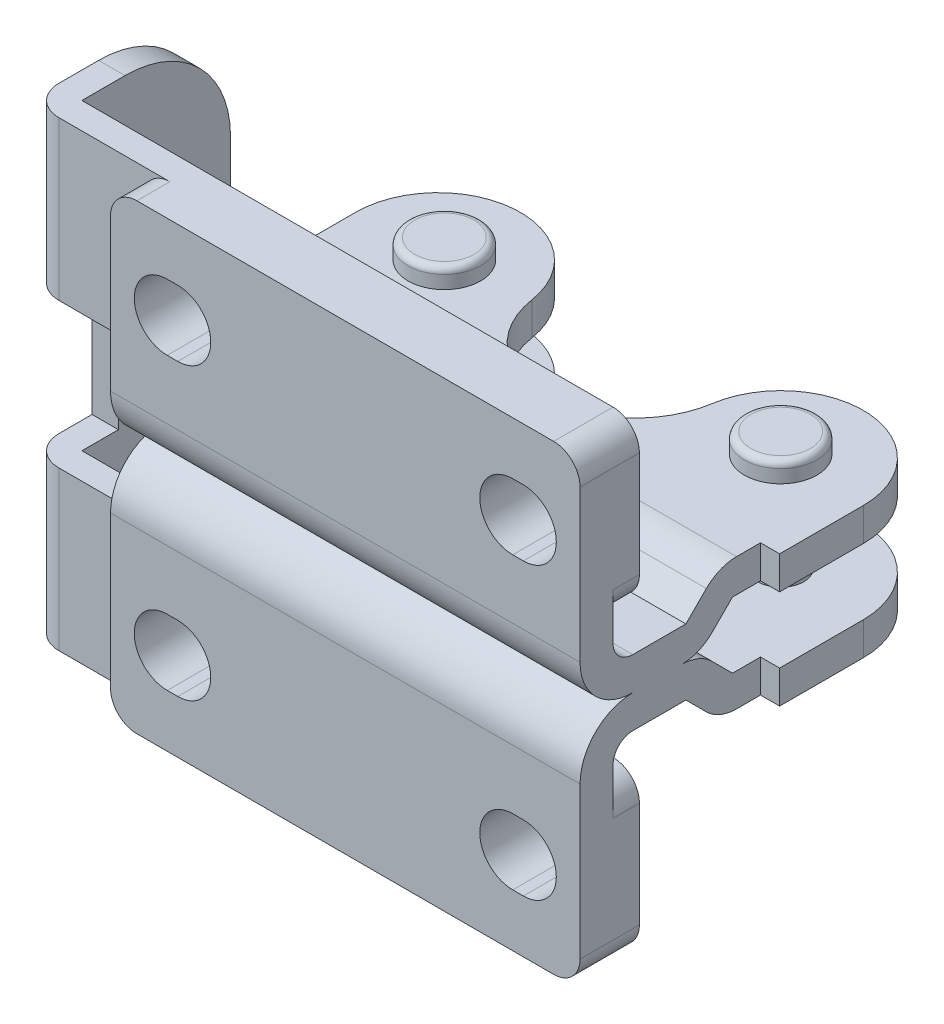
ISO-10303-21;
HEADER;
FILE_DESCRIPTION(('STEP AP214'),'2;1');
FILE_NAME('part.step','',(''),(''),'','','');
FILE_SCHEMA(('AUTOMOTIVE_DESIGN { 1 0 10303 214 1 1 1 1 }'));
ENDSEC;
DATA;
#1=APPLICATION_CONTEXT('core data for automotive mechanical design processes');
#2=APPLICATION_PROTOCOL_DEFINITION('international standard','automotive_design',2000,#1);
#3=PRODUCT_CONTEXT('',#1,'mechanical');
#4=PRODUCT('Part','Part','',(#3));
#5=PRODUCT_RELATED_PRODUCT_CATEGORY('part','',(#4));
#6=PRODUCT_DEFINITION_FORMATION('','',#4);
#7=PRODUCT_DEFINITION_CONTEXT('part definition',#1,'design');
#8=PRODUCT_DEFINITION('design','',#6,#7);
#9=PRODUCT_DEFINITION_SHAPE('','',#8);
#10=(LENGTH_UNIT() NAMED_UNIT(*) SI_UNIT(.MILLI.,.METRE.));
#11=(NAMED_UNIT(*) PLANE_ANGLE_UNIT() SI_UNIT($,.RADIAN.));
#12=(NAMED_UNIT(*) SI_UNIT($,.STERADIAN.) SOLID_ANGLE_UNIT());
#13=UNCERTAINTY_MEASURE_WITH_UNIT(LENGTH_MEASURE(1.E-05),#10,'distance_accuracy_value','');
#14=(GEOMETRIC_REPRESENTATION_CONTEXT(3) GLOBAL_UNCERTAINTY_ASSIGNED_CONTEXT((#13)) GLOBAL_UNIT_ASSIGNED_CONTEXT((#10,
#11,#12)) REPRESENTATION_CONTEXT('',''));
#15=CARTESIAN_POINT('',(0.,0.,0.));
#16=DIRECTION('',(0.,0.,1.));
#17=DIRECTION('',(1.,0.,0.));
#18=AXIS2_PLACEMENT_3D('',#15,#16,#17);
#19=CARTESIAN_POINT('',(25.85,-16.0018449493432,-20.2614970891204));
#20=DIRECTION('',(0.,-1.,0.));
#21=DIRECTION('',(-0.928520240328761,0.,-0.371281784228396));
#22=AXIS2_PLACEMENT_3D('',#19,#20,#21);
#23=CYLINDRICAL_SURFACE('',#22,2.75);
#24=CARTESIAN_POINT('',(25.85,-17.0018449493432,-20.2614970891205));
#25=DIRECTION('',(0.,-1.,0.));
#26=DIRECTION('',(-0.928520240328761,0.,-0.371281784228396));
#27=AXIS2_PLACEMENT_3D('',#24,#25,#26);
#28=CIRCLE('',#27,2.75);
#29=CARTESIAN_POINT('',(23.2965693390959,-17.0018449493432,-21.2825219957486));
#30=VERTEX_POINT('',#29);
#31=EDGE_CURVE('E367',#30,#30,#28,.F.);
#32=ORIENTED_EDGE('',*,*,#31,.T.);
#33=EDGE_LOOP('',(#32));
#34=FACE_BOUND('',#33,.T.);
#35=CARTESIAN_POINT('',(25.85,-16.0018449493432,-20.2614970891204));
#36=DIRECTION('',(0.,1.,0.));
#37=DIRECTION('',(0.,0.,1.));
#38=AXIS2_PLACEMENT_3D('',#35,#36,#37);
#39=CIRCLE('',#38,2.75);
#40=CARTESIAN_POINT('',(25.85,-16.0018449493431,-17.5114970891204));
#41=VERTEX_POINT('',#40);
#42=EDGE_CURVE('E10',#41,#41,#39,.F.);
#43=ORIENTED_EDGE('',*,*,#42,.T.);
#44=EDGE_LOOP('',(#43));
#45=FACE_BOUND('',#44,.T.);
#46=ADVANCED_FACE('F16',(#34,#45),#23,.T.);
#47=CARTESIAN_POINT('',(25.8499999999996,-17.5018449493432,-20.2614970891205));
#48=DIRECTION('',(0.,1.,0.));
#49=DIRECTION('',(0.928520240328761,0.,0.371281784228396));
#50=AXIS2_PLACEMENT_3D('',#47,#48,#49);
#51=PLANE('',#50);
#52=CARTESIAN_POINT('',(25.85,-17.5018449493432,-20.2614970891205));
#53=DIRECTION('',(0.,1.,0.));
#54=DIRECTION('',(0.928520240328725,0.,0.371281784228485));
#55=AXIS2_PLACEMENT_3D('',#52,#53,#54);
#56=CIRCLE('',#55,2.24999999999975);
#57=CARTESIAN_POINT('',(27.9391705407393,-17.5018449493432,-19.4261130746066));
#58=VERTEX_POINT('',#57);
#59=CARTESIAN_POINT('',(23.7608294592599,-17.5018449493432,-21.0968811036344));
#60=VERTEX_POINT('',#59);
#61=EDGE_CURVE('E1698',#58,#60,#56,.T.);
#62=ORIENTED_EDGE('',*,*,#61,.F.);
#63=CARTESIAN_POINT('',(25.85,-17.5018449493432,-20.2614970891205));
#64=DIRECTION('',(0.,1.,0.));
#65=DIRECTION('',(-0.928520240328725,0.,-0.371281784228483));
#66=AXIS2_PLACEMENT_3D('',#63,#64,#65);
#67=CIRCLE('',#66,2.24999999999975);
#68=EDGE_CURVE('E1694',#60,#58,#67,.T.);
#69=ORIENTED_EDGE('',*,*,#68,.F.);
#70=EDGE_LOOP('',(#62,#69));
#71=FACE_BOUND('',#70,.T.);
#72=ADVANCED_FACE('F376',(#71),#51,.F.);
#73=CARTESIAN_POINT('',(25.85,-17.0018449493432,-20.2614970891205));
#74=DIRECTION('',(0.,1.,0.));
#75=DIRECTION('',(0.928520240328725,0.,0.371281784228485));
#76=AXIS2_PLACEMENT_3D('',#73,#74,#75);
#77=TOROIDAL_SURFACE('',#76,2.24999999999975,0.5);
#78=ORIENTED_EDGE('',*,*,#61,.T.);
#79=ORIENTED_EDGE('',*,*,#68,.T.);
#80=EDGE_LOOP('',(#78,#79));
#81=FACE_BOUND('',#80,.T.);
#82=ORIENTED_EDGE('',*,*,#31,.F.);
#83=EDGE_LOOP('',(#82));
#84=FACE_BOUND('',#83,.T.);
#85=ADVANCED_FACE('F370',(#81,#84),#77,.T.);
#86=CARTESIAN_POINT('',(0.349999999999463,-16.0018449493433,-20.2614970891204));
#87=DIRECTION('',(0.,-1.,0.));
#88=DIRECTION('',(0.468184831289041,0.,0.883630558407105));
#89=AXIS2_PLACEMENT_3D('',#86,#87,#88);
#90=CYLINDRICAL_SURFACE('',#89,2.75);
#91=CARTESIAN_POINT('',(0.349999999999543,-17.0018449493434,-20.2614970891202));
#92=DIRECTION('',(0.,-1.,0.));
#93=DIRECTION('',(0.468184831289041,0.,0.883630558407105));
#94=AXIS2_PLACEMENT_3D('',#91,#92,#93);
#95=CIRCLE('',#94,2.75);
#96=CARTESIAN_POINT('',(1.63750828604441,-17.0018449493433,-17.8315130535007));
#97=VERTEX_POINT('',#96);
#98=EDGE_CURVE('E315',#97,#97,#95,.F.);
#99=ORIENTED_EDGE('',*,*,#98,.T.);
#100=EDGE_LOOP('',(#99));
#101=FACE_BOUND('',#100,.T.);
#102=CARTESIAN_POINT('',(0.349999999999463,-16.0018449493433,-20.2614970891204));
#103=DIRECTION('',(0.,1.,0.));
#104=DIRECTION('',(0.,0.,1.));
#105=AXIS2_PLACEMENT_3D('',#102,#103,#104);
#106=CIRCLE('',#105,2.75);
#107=CARTESIAN_POINT('',(0.349999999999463,-16.0018449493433,-17.5114970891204));
#108=VERTEX_POINT('',#107);
#109=EDGE_CURVE('E26',#108,#108,#106,.F.);
#110=ORIENTED_EDGE('',*,*,#109,.T.);
#111=EDGE_LOOP('',(#110));
#112=FACE_BOUND('',#111,.T.);
#113=ADVANCED_FACE('F375',(#101,#112),#90,.T.);
#114=CARTESIAN_POINT('',(0.349999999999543,-17.5018449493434,-20.2614970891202));
#115=DIRECTION('',(0.,1.,0.));
#116=DIRECTION('',(-0.468184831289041,0.,-0.883630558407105));
#117=AXIS2_PLACEMENT_3D('',#114,#115,#116);
#118=PLANE('',#117);
#119=CARTESIAN_POINT('',(0.349999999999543,-17.5018449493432,-20.2614970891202));
#120=DIRECTION('',(0.,1.,0.));
#121=DIRECTION('',(-0.468184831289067,0.,-0.883630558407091));
#122=AXIS2_PLACEMENT_3D('',#119,#120,#121);
#123=CIRCLE('',#122,2.25000000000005);
#124=CARTESIAN_POINT('',(-0.703415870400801,-17.5018449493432,-22.2496658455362));
#125=VERTEX_POINT('',#124);
#126=CARTESIAN_POINT('',(1.40341587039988,-17.5018449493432,-18.2733283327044));
#127=VERTEX_POINT('',#126);
#128=EDGE_CURVE('E1751',#125,#127,#123,.T.);
#129=ORIENTED_EDGE('',*,*,#128,.F.);
#130=CARTESIAN_POINT('',(0.349999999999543,-17.5018449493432,-20.2614970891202));
#131=DIRECTION('',(0.,1.,0.));
#132=DIRECTION('',(0.468184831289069,0.,0.88363055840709));
#133=AXIS2_PLACEMENT_3D('',#130,#131,#132);
#134=CIRCLE('',#133,2.25000000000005);
#135=EDGE_CURVE('E1754',#127,#125,#134,.T.);
#136=ORIENTED_EDGE('',*,*,#135,.F.);
#137=EDGE_LOOP('',(#129,#136));
#138=FACE_BOUND('',#137,.T.);
#139=ADVANCED_FACE('F324',(#138),#118,.F.);
#140=CARTESIAN_POINT('',(0.349999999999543,-17.0018449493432,-20.2614970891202));
#141=DIRECTION('',(0.,1.,0.));
#142=DIRECTION('',(-0.468184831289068,0.,-0.883630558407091));
#143=AXIS2_PLACEMENT_3D('',#140,#141,#142);
#144=TOROIDAL_SURFACE('',#143,2.25000000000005,0.5);
#145=ORIENTED_EDGE('',*,*,#128,.T.);
#146=ORIENTED_EDGE('',*,*,#135,.T.);
#147=EDGE_LOOP('',(#145,#146));
#148=FACE_BOUND('',#147,.T.);
#149=ORIENTED_EDGE('',*,*,#98,.F.);
#150=EDGE_LOOP('',(#149));
#151=FACE_BOUND('',#150,.T.);
#152=ADVANCED_FACE('F318',(#148,#151),#144,.T.);
#153=CARTESIAN_POINT('',(-4.7,-13.5000000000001,-13.682155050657));
#154=DIRECTION('',(0.,0.,-1.));
#155=DIRECTION('',(0.,-1.,0.));
#156=AXIS2_PLACEMENT_3D('',#153,#154,#155);
#157=PLANE('',#156);
#158=DIRECTION('',(0.,1.,0.));
#159=VECTOR('',#158,1.);
#160=CARTESIAN_POINT('',(-4.7,-0.998155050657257,-13.6821550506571));
#161=LINE('',#160,#159);
#162=CARTESIAN_POINT('',(-4.7,-16.,-13.682155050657));
#163=VERTEX_POINT('',#162);
#164=CARTESIAN_POINT('',(-4.7,-13.5000000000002,-13.682155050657));
#165=VERTEX_POINT('',#164);
#166=EDGE_CURVE('E511',#163,#165,#161,.T.);
#167=ORIENTED_EDGE('',*,*,#166,.T.);
#168=DIRECTION('',(-1.,0.,0.));
#169=VECTOR('',#168,1.);
#170=CARTESIAN_POINT('',(-4.7,-13.5000000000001,-13.682155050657));
#171=LINE('',#170,#169);
#172=CARTESIAN_POINT('',(-6.15,-13.5000000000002,-13.682155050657));
#173=VERTEX_POINT('',#172);
#174=EDGE_CURVE('E543',#173,#165,#171,.F.);
#175=ORIENTED_EDGE('',*,*,#174,.F.);
#176=DIRECTION('',(0.,1.,0.));
#177=VECTOR('',#176,1.);
#178=CARTESIAN_POINT('',(-6.15,-16.,-13.682155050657));
#179=LINE('',#178,#177);
#180=CARTESIAN_POINT('',(-6.15,-16.,-13.682155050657));
#181=VERTEX_POINT('',#180);
#182=EDGE_CURVE('E536',#181,#173,#179,.T.);
#183=ORIENTED_EDGE('',*,*,#182,.F.);
#184=DIRECTION('',(-1.,0.,0.));
#185=VECTOR('',#184,1.);
#186=CARTESIAN_POINT('',(-4.7,-16.,-13.682155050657));
#187=LINE('',#186,#185);
#188=EDGE_CURVE('E540',#163,#181,#187,.T.);
#189=ORIENTED_EDGE('',*,*,#188,.F.);
#190=EDGE_LOOP('',(#167,#175,#183,#189));
#191=FACE_BOUND('',#190,.T.);
#192=ADVANCED_FACE('F323',(#191),#157,.F.);
#193=CARTESIAN_POINT('',(-6.15,-16.,-20.028155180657));
#194=DIRECTION('',(1.,0.,0.));
#195=DIRECTION('',(0.,0.,-1.));
#196=AXIS2_PLACEMENT_3D('',#193,#194,#195);
#197=PLANE('',#196);
#198=ORIENTED_EDGE('',*,*,#182,.T.);
#199=DIRECTION('',(0.,0.,1.));
#200=VECTOR('',#199,1.);
#201=CARTESIAN_POINT('',(-6.15,-13.5000000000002,-21.1635839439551));
#202=LINE('',#201,#200);
#203=CARTESIAN_POINT('',(-6.15,-13.5000000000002,-20.0281551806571));
#204=VERTEX_POINT('',#203);
#205=EDGE_CURVE('E499',#173,#204,#202,.F.);
#206=ORIENTED_EDGE('',*,*,#205,.T.);
#207=DIRECTION('',(0.,1.,0.));
#208=VECTOR('',#207,1.);
#209=CARTESIAN_POINT('',(-6.15,-16.,-20.028155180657));
#210=LINE('',#209,#208);
#211=CARTESIAN_POINT('',(-6.15,-16.,-20.028155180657));
#212=VERTEX_POINT('',#211);
#213=EDGE_CURVE('E524',#212,#204,#210,.T.);
#214=ORIENTED_EDGE('',*,*,#213,.F.);
#215=DIRECTION('',(0.,0.,-1.));
#216=VECTOR('',#215,1.);
#217=CARTESIAN_POINT('',(-6.15,-16.,-20.028155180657));
#218=LINE('',#217,#216);
#219=EDGE_CURVE('E529',#181,#212,#218,.T.);
#220=ORIENTED_EDGE('',*,*,#219,.F.);
#221=EDGE_LOOP('',(#198,#206,#214,#220));
#222=FACE_BOUND('',#221,.T.);
#223=ADVANCED_FACE('F1375',(#222),#197,.F.);
#224=CARTESIAN_POINT('',(0.1,-16.,-20.0281551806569));
#225=DIRECTION('',(0.,1.,0.));
#226=DIRECTION('',(0.,0.,-1.));
#227=AXIS2_PLACEMENT_3D('',#224,#225,#226);
#228=CYLINDRICAL_SURFACE('',#227,6.25);
#229=CARTESIAN_POINT('',(0.1,-16.,-20.0281551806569));
#230=DIRECTION('',(0.,1.,0.));
#231=DIRECTION('',(0.,0.,-1.));
#232=AXIS2_PLACEMENT_3D('',#229,#230,#231);
#233=CIRCLE('',#232,6.25);
#234=CARTESIAN_POINT('',(6.27732311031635,-16.,-20.9785125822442));
#235=VERTEX_POINT('',#234);
#236=EDGE_CURVE('E527',#235,#212,#233,.T.);
#237=ORIENTED_EDGE('',*,*,#236,.T.);
#238=ORIENTED_EDGE('',*,*,#213,.T.);
#239=CARTESIAN_POINT('',(0.1,-13.5000000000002,-20.0281551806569));
#240=DIRECTION('',(0.,1.,0.));
#241=DIRECTION('',(0.,0.,-1.));
#242=AXIS2_PLACEMENT_3D('',#239,#240,#241);
#243=CIRCLE('',#242,6.25);
#244=CARTESIAN_POINT('',(6.27732311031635,-13.5000000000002,-20.9785125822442));
#245=VERTEX_POINT('',#244);
#246=EDGE_CURVE('E502',#204,#245,#243,.F.);
#247=ORIENTED_EDGE('',*,*,#246,.T.);
#248=DIRECTION('',(0.,1.,0.));
#249=VECTOR('',#248,1.);
#250=CARTESIAN_POINT('',(6.27732311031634,-16.,-20.9785125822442));
#251=LINE('',#250,#249);
#252=EDGE_CURVE('E520',#245,#235,#251,.F.);
#253=ORIENTED_EDGE('',*,*,#252,.T.);
#254=EDGE_LOOP('',(#237,#238,#247,#253));
#255=FACE_BOUND('',#254,.T.);
#256=ADVANCED_FACE('F1372',(#255),#228,.T.);
#257=CARTESIAN_POINT('',(13.1,-16.,-22.0281551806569));
#258=DIRECTION('',(0.,1.,0.));
#259=DIRECTION('',(0.,0.,-1.));
#260=AXIS2_PLACEMENT_3D('',#257,#258,#259);
#261=CYLINDRICAL_SURFACE('',#260,6.90294643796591);
#262=DIRECTION('',(0.,1.,0.));
#263=VECTOR('',#262,1.);
#264=CARTESIAN_POINT('',(19.9226768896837,-16.,-20.9785125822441));
#265=LINE('',#264,#263);
#266=CARTESIAN_POINT('',(19.9226768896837,-16.,-20.9785125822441));
#267=VERTEX_POINT('',#266);
#268=CARTESIAN_POINT('',(19.9226768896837,-13.5,-20.9785125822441));
#269=VERTEX_POINT('',#268);
#270=EDGE_CURVE('E516',#267,#269,#265,.T.);
#271=ORIENTED_EDGE('',*,*,#270,.F.);
#272=CARTESIAN_POINT('',(13.1,-16.,-22.0281551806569));
#273=DIRECTION('',(0.,1.,0.));
#274=DIRECTION('',(0.,0.,-1.));
#275=AXIS2_PLACEMENT_3D('',#272,#273,#274);
#276=CIRCLE('',#275,6.90294643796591);
#277=EDGE_CURVE('E523',#235,#267,#276,.T.);
#278=ORIENTED_EDGE('',*,*,#277,.F.);
#279=ORIENTED_EDGE('',*,*,#252,.F.);
#280=CARTESIAN_POINT('',(13.1,-13.5000000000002,-22.0281551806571));
#281=DIRECTION('',(0.,1.,0.));
#282=DIRECTION('',(0.,0.,-1.));
#283=AXIS2_PLACEMENT_3D('',#280,#281,#282);
#284=CIRCLE('',#283,6.90294643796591);
#285=EDGE_CURVE('E572',#245,#269,#284,.T.);
#286=ORIENTED_EDGE('',*,*,#285,.T.);
#287=EDGE_LOOP('',(#271,#278,#279,#286));
#288=FACE_BOUND('',#287,.T.);
#289=ADVANCED_FACE('F1369',(#288),#261,.F.);
#290=CARTESIAN_POINT('',(26.1,-16.,-20.0281551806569));
#291=DIRECTION('',(0.,1.,0.));
#292=DIRECTION('',(0.,0.,-1.));
#293=AXIS2_PLACEMENT_3D('',#290,#291,#292);
#294=CYLINDRICAL_SURFACE('',#293,6.25);
#295=CARTESIAN_POINT('',(26.1,-16.,-20.0281551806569));
#296=DIRECTION('',(0.,1.,0.));
#297=DIRECTION('',(0.,0.,-1.));
#298=AXIS2_PLACEMENT_3D('',#295,#296,#297);
#299=CIRCLE('',#298,6.25);
#300=CARTESIAN_POINT('',(32.35,-16.,-20.028155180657));
#301=VERTEX_POINT('',#300);
#302=EDGE_CURVE('E519',#301,#267,#299,.T.);
#303=ORIENTED_EDGE('',*,*,#302,.T.);
#304=ORIENTED_EDGE('',*,*,#270,.T.);
#305=CARTESIAN_POINT('',(26.1,-13.5000000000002,-20.0281551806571));
#306=DIRECTION('',(0.,1.,0.));
#307=DIRECTION('',(0.,0.,-1.));
#308=AXIS2_PLACEMENT_3D('',#305,#306,#307);
#309=CIRCLE('',#308,6.25);
#310=CARTESIAN_POINT('',(32.35,-13.5000000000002,-20.0281551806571));
#311=VERTEX_POINT('',#310);
#312=EDGE_CURVE('E498',#269,#311,#309,.F.);
#313=ORIENTED_EDGE('',*,*,#312,.T.);
#314=DIRECTION('',(0.,1.,0.));
#315=VECTOR('',#314,1.);
#316=CARTESIAN_POINT('',(32.35,-16.,-20.0281551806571));
#317=LINE('',#316,#315);
#318=EDGE_CURVE('E512',#311,#301,#317,.F.);
#319=ORIENTED_EDGE('',*,*,#318,.T.);
#320=EDGE_LOOP('',(#303,#304,#313,#319));
#321=FACE_BOUND('',#320,.T.);
#322=ADVANCED_FACE('F1364',(#321),#294,.T.);
#323=CARTESIAN_POINT('',(32.35,-16.,-20.028155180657));
#324=DIRECTION('',(-1.,0.,0.));
#325=DIRECTION('',(0.,0.,1.));
#326=AXIS2_PLACEMENT_3D('',#323,#324,#325);
#327=PLANE('',#326);
#328=DIRECTION('',(0.,-1.,0.));
#329=VECTOR('',#328,1.);
#330=CARTESIAN_POINT('',(32.35,-16.,-13.682155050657));
#331=LINE('',#330,#329);
#332=CARTESIAN_POINT('',(32.35,-13.5000000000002,-13.6821550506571));
#333=VERTEX_POINT('',#332);
#334=CARTESIAN_POINT('',(32.35,-16.,-13.682155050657));
#335=VERTEX_POINT('',#334);
#336=EDGE_CURVE('E1014',#333,#335,#331,.T.);
#337=ORIENTED_EDGE('',*,*,#336,.T.);
#338=DIRECTION('',(0.,0.,1.));
#339=VECTOR('',#338,1.);
#340=CARTESIAN_POINT('',(32.35,-16.,-20.028155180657));
#341=LINE('',#340,#339);
#342=EDGE_CURVE('E515',#301,#335,#341,.T.);
#343=ORIENTED_EDGE('',*,*,#342,.F.);
#344=ORIENTED_EDGE('',*,*,#318,.F.);
#345=DIRECTION('',(0.,0.,1.));
#346=VECTOR('',#345,1.);
#347=CARTESIAN_POINT('',(32.35,-13.5000000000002,-21.1635839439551));
#348=LINE('',#347,#346);
#349=EDGE_CURVE('E495',#311,#333,#348,.T.);
#350=ORIENTED_EDGE('',*,*,#349,.T.);
#351=EDGE_LOOP('',(#337,#343,#344,#350));
#352=FACE_BOUND('',#351,.T.);
#353=ADVANCED_FACE('F1362',(#352),#327,.F.);
#354=CARTESIAN_POINT('',(34.3151750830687,-13.5000000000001,-13.6821550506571));
#355=DIRECTION('',(0.,0.,-1.));
#356=DIRECTION('',(0.,-1.,0.));
#357=AXIS2_PLACEMENT_3D('',#354,#355,#356);
#358=PLANE('',#357);
#359=DIRECTION('',(0.,-1.,0.));
#360=VECTOR('',#359,1.);
#361=CARTESIAN_POINT('',(30.9,-0.998155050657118,-13.6821550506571));
#362=LINE('',#361,#360);
#363=CARTESIAN_POINT('',(30.9,-13.5000000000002,-13.6821550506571));
#364=VERTEX_POINT('',#363);
#365=CARTESIAN_POINT('',(30.9,-16.,-13.682155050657));
#366=VERTEX_POINT('',#365);
#367=EDGE_CURVE('E532',#364,#366,#362,.T.);
#368=ORIENTED_EDGE('',*,*,#367,.T.);
#369=DIRECTION('',(-1.,0.,0.));
#370=VECTOR('',#369,1.);
#371=CARTESIAN_POINT('',(34.3151750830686,-16.,-13.682155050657));
#372=LINE('',#371,#370);
#373=EDGE_CURVE('E537',#335,#366,#372,.T.);
#374=ORIENTED_EDGE('',*,*,#373,.F.);
#375=ORIENTED_EDGE('',*,*,#336,.F.);
#376=DIRECTION('',(-1.,0.,0.));
#377=VECTOR('',#376,1.);
#378=CARTESIAN_POINT('',(34.3151750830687,-13.5000000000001,-13.6821550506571));
#379=LINE('',#378,#377);
#380=EDGE_CURVE('E533',#364,#333,#379,.F.);
#381=ORIENTED_EDGE('',*,*,#380,.F.);
#382=EDGE_LOOP('',(#368,#374,#375,#381));
#383=FACE_BOUND('',#382,.T.);
#384=ADVANCED_FACE('F1358',(#383),#358,.F.);
#385=CARTESIAN_POINT('',(28.9,-26.4981550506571,-2.5));
#386=DIRECTION('',(0.,0.,1.));
#387=DIRECTION('',(1.,0.,0.));
#388=AXIS2_PLACEMENT_3D('',#385,#386,#387);
#389=CYLINDRICAL_SURFACE('',#388,2.);
#390=DIRECTION('',(0.,0.,1.));
#391=VECTOR('',#390,1.);
#392=CARTESIAN_POINT('',(30.9,-26.5,-38.1561355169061));
#393=LINE('',#392,#391);
#394=CARTESIAN_POINT('',(30.899999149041,-26.499999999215,-2.5));
#395=VERTEX_POINT('',#394);
#396=CARTESIAN_POINT('',(30.8999991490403,-26.5,0.));
#397=VERTEX_POINT('',#396);
#398=EDGE_CURVE('E306',#395,#397,#393,.T.);
#399=ORIENTED_EDGE('',*,*,#398,.F.);
#400=CARTESIAN_POINT('',(28.9,-26.4981550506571,-2.5));
#401=DIRECTION('',(0.,0.,1.));
#402=DIRECTION('',(1.,0.,0.));
#403=AXIS2_PLACEMENT_3D('',#400,#401,#402);
#404=CIRCLE('',#403,2.);
#405=CARTESIAN_POINT('',(30.9,-26.4981550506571,-2.5));
#406=VERTEX_POINT('',#405);
#407=EDGE_CURVE('E438',#395,#406,#404,.T.);
#408=ORIENTED_EDGE('',*,*,#407,.T.);
#409=DIRECTION('',(0.,0.,1.));
#410=VECTOR('',#409,1.);
#411=CARTESIAN_POINT('',(30.9,-26.4981550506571,-2.5));
#412=LINE('',#411,#410);
#413=CARTESIAN_POINT('',(30.9,-26.4981550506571,0.));
#414=VERTEX_POINT('',#413);
#415=EDGE_CURVE('E435',#406,#414,#412,.T.);
#416=ORIENTED_EDGE('',*,*,#415,.T.);
#417=CARTESIAN_POINT('',(28.9,-26.4981550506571,0.));
#418=DIRECTION('',(0.,0.,1.));
#419=DIRECTION('',(1.,0.,0.));
#420=AXIS2_PLACEMENT_3D('',#417,#418,#419);
#421=CIRCLE('',#420,2.);
#422=EDGE_CURVE('E425',#414,#397,#421,.F.);
#423=ORIENTED_EDGE('',*,*,#422,.T.);
#424=EDGE_LOOP('',(#399,#408,#416,#423));
#425=FACE_BOUND('',#424,.T.);
#426=ADVANCED_FACE('F1616',(#425),#389,.T.);
#427=CARTESIAN_POINT('',(13.1,7.34784507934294,-2.5));
#428=DIRECTION('',(0.,0.,-1.));
#429=DIRECTION('',(-1.,0.,0.));
#430=AXIS2_PLACEMENT_3D('',#427,#428,#429);
#431=PLANE('',#430);
#432=CARTESIAN_POINT('',(28.9,-18.5,-2.49999999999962));
#433=DIRECTION('',(0.,0.,-1.));
#434=DIRECTION('',(1.,0.,0.));
#435=AXIS2_PLACEMENT_3D('',#432,#433,#434);
#436=CIRCLE('',#435,2.);
#437=CARTESIAN_POINT('',(28.9,-16.5,-2.5));
#438=VERTEX_POINT('',#437);
#439=CARTESIAN_POINT('',(30.9,-18.5,-2.5));
#440=VERTEX_POINT('',#439);
#441=EDGE_CURVE('E585',#438,#440,#436,.T.);
#442=ORIENTED_EDGE('',*,*,#441,.F.);
#443=DIRECTION('',(1.,0.,0.));
#444=VECTOR('',#443,1.);
#445=CARTESIAN_POINT('',(13.1,-16.5,-2.5));
#446=LINE('',#445,#444);
#447=CARTESIAN_POINT('',(-4.7,-16.5,-2.5));
#448=VERTEX_POINT('',#447);
#449=EDGE_CURVE('E434',#448,#438,#446,.T.);
#450=ORIENTED_EDGE('',*,*,#449,.F.);
#451=DIRECTION('',(0.,-1.,0.));
#452=VECTOR('',#451,1.);
#453=CARTESIAN_POINT('',(-4.7,-0.998155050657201,-2.5));
#454=LINE('',#453,#452);
#455=CARTESIAN_POINT('',(-4.7,-15.,-2.5));
#456=VERTEX_POINT('',#455);
#457=EDGE_CURVE('E430',#448,#456,#454,.F.);
#458=ORIENTED_EDGE('',*,*,#457,.T.);
#459=DIRECTION('',(-1.,0.,0.));
#460=VECTOR('',#459,1.);
#461=CARTESIAN_POINT('',(13.1,-15.,-2.5));
#462=LINE('',#461,#460);
#463=CARTESIAN_POINT('',(30.9,-15.,-2.5));
#464=VERTEX_POINT('',#463);
#465=EDGE_CURVE('E446',#456,#464,#462,.F.);
#466=ORIENTED_EDGE('',*,*,#465,.T.);
#467=DIRECTION('',(0.,1.,0.));
#468=VECTOR('',#467,1.);
#469=CARTESIAN_POINT('',(30.9,-0.998155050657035,-2.5));
#470=LINE('',#469,#468);
#471=EDGE_CURVE('E451',#464,#440,#470,.F.);
#472=ORIENTED_EDGE('',*,*,#471,.T.);
#473=EDGE_LOOP('',(#442,#450,#458,#466,#472));
#474=FACE_BOUND('',#473,.T.);
#475=ADVANCED_FACE('F1333',(#474),#431,.T.);
#476=CARTESIAN_POINT('',(-22.8481532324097,-15.,-4.));
#477=DIRECTION('',(1.,0.,0.));
#478=DIRECTION('',(0.,0.,-1.));
#479=AXIS2_PLACEMENT_3D('',#476,#477,#478);
#480=CYLINDRICAL_SURFACE('',#479,1.5);
#481=CARTESIAN_POINT('',(30.9,-15.,-4.));
#482=DIRECTION('',(1.,0.,0.));
#483=DIRECTION('',(0.,0.,-1.));
#484=AXIS2_PLACEMENT_3D('',#481,#482,#483);
#485=CIRCLE('',#484,1.5);
#486=CARTESIAN_POINT('',(30.9,-13.5000000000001,-4.));
#487=VERTEX_POINT('',#486);
#488=EDGE_CURVE('E454',#487,#464,#485,.T.);
#489=ORIENTED_EDGE('',*,*,#488,.T.);
#490=ORIENTED_EDGE('',*,*,#465,.F.);
#491=CARTESIAN_POINT('',(-4.7,-15.,-4.));
#492=DIRECTION('',(1.,0.,0.));
#493=DIRECTION('',(0.,0.,-1.));
#494=AXIS2_PLACEMENT_3D('',#491,#492,#493);
#495=CIRCLE('',#494,1.5);
#496=CARTESIAN_POINT('',(-4.7,-13.5000000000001,-4.));
#497=VERTEX_POINT('',#496);
#498=EDGE_CURVE('E466',#456,#497,#495,.F.);
#499=ORIENTED_EDGE('',*,*,#498,.T.);
#500=DIRECTION('',(1.,0.,0.));
#501=VECTOR('',#500,1.);
#502=CARTESIAN_POINT('',(-22.8481532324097,-13.5,-4.));
#503=LINE('',#502,#501);
#504=EDGE_CURVE('E450',#487,#497,#503,.F.);
#505=ORIENTED_EDGE('',*,*,#504,.F.);
#506=EDGE_LOOP('',(#489,#490,#499,#505));
#507=FACE_BOUND('',#506,.T.);
#508=ADVANCED_FACE('F1339',(#507),#480,.F.);
#509=CARTESIAN_POINT('',(13.1,-13.5000000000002,-22.028155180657));
#510=DIRECTION('',(0.,-1.,0.));
#511=DIRECTION('',(0.,0.,1.));
#512=AXIS2_PLACEMENT_3D('',#509,#510,#511);
#513=PLANE('',#512);
#514=DIRECTION('',(0.,0.,1.));
#515=VECTOR('',#514,1.);
#516=CARTESIAN_POINT('',(30.9,-13.5000000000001,-13.682155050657));
#517=LINE('',#516,#515);
#518=CARTESIAN_POINT('',(30.9,-13.5000000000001,-8.02497371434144));
#519=VERTEX_POINT('',#518);
#520=EDGE_CURVE('E457',#519,#487,#517,.T.);
#521=ORIENTED_EDGE('',*,*,#520,.T.);
#522=ORIENTED_EDGE('',*,*,#504,.T.);
#523=DIRECTION('',(0.,0.,-1.));
#524=VECTOR('',#523,1.);
#525=CARTESIAN_POINT('',(-4.7,-13.5,-13.682155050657));
#526=LINE('',#525,#524);
#527=CARTESIAN_POINT('',(-4.7,-13.5000000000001,-8.02497371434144));
#528=VERTEX_POINT('',#527);
#529=EDGE_CURVE('E460',#497,#528,#526,.T.);
#530=ORIENTED_EDGE('',*,*,#529,.T.);
#531=DIRECTION('',(-1.,0.,0.));
#532=VECTOR('',#531,1.);
#533=CARTESIAN_POINT('',(13.1,-13.5000000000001,-8.02497371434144));
#534=LINE('',#533,#532);
#535=EDGE_CURVE('E475',#519,#528,#534,.T.);
#536=ORIENTED_EDGE('',*,*,#535,.F.);
#537=EDGE_LOOP('',(#521,#522,#530,#536));
#538=FACE_BOUND('',#537,.T.);
#539=ADVANCED_FACE('F1342',(#538),#513,.T.);
#540=CARTESIAN_POINT('',(13.1,-22.7299559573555,-17.2549296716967));
#541=DIRECTION('',(0.,-0.707106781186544,0.707106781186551));
#542=DIRECTION('',(0.,0.707106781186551,0.707106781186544));
#543=AXIS2_PLACEMENT_3D('',#540,#541,#542);
#544=PLANE('',#543);
#545=DIRECTION('',(0.,0.707106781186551,0.707106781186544));
#546=VECTOR('',#545,1.);
#547=CARTESIAN_POINT('',(30.9,-15.0520218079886,-9.57699552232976));
#548=LINE('',#547,#546);
#549=CARTESIAN_POINT('',(30.9,-15.0520218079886,-9.57699552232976));
#550=VERTEX_POINT('',#549);
#551=EDGE_CURVE('E477',#550,#519,#548,.T.);
#552=ORIENTED_EDGE('',*,*,#551,.T.);
#553=ORIENTED_EDGE('',*,*,#535,.T.);
#554=DIRECTION('',(0.,-0.707106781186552,-0.707106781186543));
#555=VECTOR('',#554,1.);
#556=CARTESIAN_POINT('',(-4.7,-13.7157451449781,-8.24071885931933));
#557=LINE('',#556,#555);
#558=CARTESIAN_POINT('',(-4.7,-15.0520218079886,-9.57699552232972));
#559=VERTEX_POINT('',#558);
#560=EDGE_CURVE('E480',#528,#559,#557,.T.);
#561=ORIENTED_EDGE('',*,*,#560,.T.);
#562=DIRECTION('',(-1.,0.,0.));
#563=VECTOR('',#562,1.);
#564=CARTESIAN_POINT('',(13.1,-15.0520218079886,-9.57699552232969));
#565=LINE('',#564,#563);
#566=EDGE_CURVE('E484',#559,#550,#565,.F.);
#567=ORIENTED_EDGE('',*,*,#566,.T.);
#568=EDGE_LOOP('',(#552,#553,#561,#567));
#569=FACE_BOUND('',#568,.T.);
#570=ADVANCED_FACE('F1382',(#569),#544,.T.);
#571=CARTESIAN_POINT('',(-22.7307941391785,-12.7634,-11.8656173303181));
#572=DIRECTION('',(1.,0.,0.));
#573=DIRECTION('',(0.,0.,-1.));
#574=AXIS2_PLACEMENT_3D('',#571,#572,#573);
#575=CYLINDRICAL_SURFACE('',#574,3.2366);
#576=ORIENTED_EDGE('',*,*,#566,.F.);
#577=CARTESIAN_POINT('',(-4.7,-12.7634,-11.8656173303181));
#578=DIRECTION('',(1.,0.,0.));
#579=DIRECTION('',(0.,0.,-1.));
#580=AXIS2_PLACEMENT_3D('',#577,#578,#579);
#581=CIRCLE('',#580,3.2366);
#582=CARTESIAN_POINT('',(-4.7,-16.,-11.8656173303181));
#583=VERTEX_POINT('',#582);
#584=EDGE_CURVE('E491',#583,#559,#581,.F.);
#585=ORIENTED_EDGE('',*,*,#584,.F.);
#586=DIRECTION('',(1.,0.,0.));
#587=VECTOR('',#586,1.);
#588=CARTESIAN_POINT('',(-22.7307941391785,-16.,-11.8656173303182));
#589=LINE('',#588,#587);
#590=CARTESIAN_POINT('',(30.9,-16.,-11.8656173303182));
#591=VERTEX_POINT('',#590);
#592=EDGE_CURVE('E503',#583,#591,#589,.T.);
#593=ORIENTED_EDGE('',*,*,#592,.T.);
#594=CARTESIAN_POINT('',(30.9,-12.7634,-11.8656173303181));
#595=DIRECTION('',(1.,0.,0.));
#596=DIRECTION('',(0.,0.,-1.));
#597=AXIS2_PLACEMENT_3D('',#594,#595,#596);
#598=CIRCLE('',#597,3.2366);
#599=EDGE_CURVE('E487',#550,#591,#598,.T.);
#600=ORIENTED_EDGE('',*,*,#599,.F.);
#601=EDGE_LOOP('',(#576,#585,#593,#600));
#602=FACE_BOUND('',#601,.T.);
#603=ADVANCED_FACE('F1348',(#602),#575,.T.);
#604=CARTESIAN_POINT('',(13.1,-16.,-21.163583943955));
#605=DIRECTION('',(0.,-1.,0.));
#606=DIRECTION('',(0.,0.,1.));
#607=AXIS2_PLACEMENT_3D('',#604,#605,#606);
#608=PLANE('',#607);
#609=ORIENTED_EDGE('',*,*,#373,.T.);
#610=DIRECTION('',(0.,0.,1.));
#611=VECTOR('',#610,1.);
#612=CARTESIAN_POINT('',(30.9,-16.,-12.8175838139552));
#613=LINE('',#612,#611);
#614=EDGE_CURVE('E504',#366,#591,#613,.T.);
#615=ORIENTED_EDGE('',*,*,#614,.T.);
#616=ORIENTED_EDGE('',*,*,#592,.F.);
#617=DIRECTION('',(0.,0.,-1.));
#618=VECTOR('',#617,1.);
#619=CARTESIAN_POINT('',(-4.7,-16.,-12.8175838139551));
#620=LINE('',#619,#618);
#621=EDGE_CURVE('E507',#583,#163,#620,.T.);
#622=ORIENTED_EDGE('',*,*,#621,.T.);
#623=ORIENTED_EDGE('',*,*,#188,.T.);
#624=ORIENTED_EDGE('',*,*,#219,.T.);
#625=ORIENTED_EDGE('',*,*,#236,.F.);
#626=ORIENTED_EDGE('',*,*,#277,.T.);
#627=ORIENTED_EDGE('',*,*,#302,.F.);
#628=ORIENTED_EDGE('',*,*,#342,.T.);
#629=EDGE_LOOP('',(#609,#615,#616,#622,#623,#624,#625,#626,#627,#628));
#630=FACE_BOUND('',#629,.T.);
#631=CARTESIAN_POINT('',(25.85,-16.,-20.2614970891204));
#632=DIRECTION('',(0.,-1.,0.));
#633=DIRECTION('',(0.,0.,-1.));
#634=AXIS2_PLACEMENT_3D('',#631,#632,#633);
#635=CIRCLE('',#634,1.75);
#636=CARTESIAN_POINT('',(25.85,-16.,-22.0114970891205));
#637=VERTEX_POINT('',#636);
#638=EDGE_CURVE('E996',#637,#637,#635,.F.);
#639=ORIENTED_EDGE('',*,*,#638,.T.);
#640=EDGE_LOOP('',(#639));
#641=FACE_BOUND('',#640,.T.);
#642=CARTESIAN_POINT('',(0.349999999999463,-16.0000000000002,-20.2614970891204));
#643=DIRECTION('',(0.,-1.,0.));
#644=DIRECTION('',(0.,0.,-1.));
#645=AXIS2_PLACEMENT_3D('',#642,#643,#644);
#646=CIRCLE('',#645,1.75);
#647=CARTESIAN_POINT('',(0.349999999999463,-16.0000000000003,-22.0114970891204));
#648=VERTEX_POINT('',#647);
#649=EDGE_CURVE('E1002',#648,#648,#646,.F.);
#650=ORIENTED_EDGE('',*,*,#649,.T.);
#651=EDGE_LOOP('',(#650));
#652=FACE_BOUND('',#651,.T.);
#653=ADVANCED_FACE('F1352',(#630,#641,#652),#608,.T.);
#654=CARTESIAN_POINT('',(13.1,-13.5000000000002,-21.1635839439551));
#655=DIRECTION('',(0.,-1.,0.));
#656=DIRECTION('',(0.,0.,1.));
#657=AXIS2_PLACEMENT_3D('',#654,#655,#656);
#658=PLANE('',#657);
#659=DIRECTION('',(1.,0.,0.));
#660=VECTOR('',#659,1.);
#661=CARTESIAN_POINT('',(13.1,-13.5000000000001,-11.5605076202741));
#662=LINE('',#661,#660);
#663=CARTESIAN_POINT('',(-4.7,-13.5000000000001,-11.5605076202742));
#664=VERTEX_POINT('',#663);
#665=CARTESIAN_POINT('',(30.9,-13.5000000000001,-11.5605076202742));
#666=VERTEX_POINT('',#665);
#667=EDGE_CURVE('E483',#664,#666,#662,.T.);
#668=ORIENTED_EDGE('',*,*,#667,.T.);
#669=DIRECTION('',(0.,0.,1.));
#670=VECTOR('',#669,1.);
#671=CARTESIAN_POINT('',(30.9,-13.5000000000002,-21.163583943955));
#672=LINE('',#671,#670);
#673=EDGE_CURVE('E492',#364,#666,#672,.T.);
#674=ORIENTED_EDGE('',*,*,#673,.F.);
#675=ORIENTED_EDGE('',*,*,#380,.T.);
#676=ORIENTED_EDGE('',*,*,#349,.F.);
#677=ORIENTED_EDGE('',*,*,#312,.F.);
#678=ORIENTED_EDGE('',*,*,#285,.F.);
#679=ORIENTED_EDGE('',*,*,#246,.F.);
#680=ORIENTED_EDGE('',*,*,#205,.F.);
#681=ORIENTED_EDGE('',*,*,#174,.T.);
#682=DIRECTION('',(0.,0.,1.));
#683=VECTOR('',#682,1.);
#684=CARTESIAN_POINT('',(-4.7,-13.5000000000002,-21.1635839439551));
#685=LINE('',#684,#683);
#686=EDGE_CURVE('E488',#664,#165,#685,.F.);
#687=ORIENTED_EDGE('',*,*,#686,.F.);
#688=EDGE_LOOP('',(#668,#674,#675,#676,#677,#678,#679,#680,#681,#687));
#689=FACE_BOUND('',#688,.T.);
#690=CARTESIAN_POINT('',(25.8499999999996,-13.5,-20.2614970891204));
#691=DIRECTION('',(0.,1.,0.));
#692=DIRECTION('',(0.,0.,1.));
#693=AXIS2_PLACEMENT_3D('',#690,#691,#692);
#694=CIRCLE('',#693,1.75);
#695=CARTESIAN_POINT('',(25.8499999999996,-13.5,-18.5114970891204));
#696=VERTEX_POINT('',#695);
#697=EDGE_CURVE('E993',#696,#696,#694,.F.);
#698=ORIENTED_EDGE('',*,*,#697,.T.);
#699=EDGE_LOOP('',(#698));
#700=FACE_BOUND('',#699,.T.);
#701=CARTESIAN_POINT('',(0.349999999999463,-13.5000000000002,-20.2614970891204));
#702=DIRECTION('',(0.,1.,0.));
#703=DIRECTION('',(0.,0.,1.));
#704=AXIS2_PLACEMENT_3D('',#701,#702,#703);
#705=CIRCLE('',#704,1.75);
#706=CARTESIAN_POINT('',(0.349999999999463,-13.5000000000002,-18.5114970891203));
#707=VERTEX_POINT('',#706);
#708=EDGE_CURVE('E999',#707,#707,#705,.F.);
#709=ORIENTED_EDGE('',*,*,#708,.T.);
#710=EDGE_LOOP('',(#709));
#711=FACE_BOUND('',#710,.T.);
#712=ADVANCED_FACE('F1034',(#689,#700,#711),#658,.F.);
#713=CARTESIAN_POINT('',(13.1,-20.9621890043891,-19.0226966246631));
#714=DIRECTION('',(0.,-0.707106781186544,0.707106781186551));
#715=DIRECTION('',(0.,0.707106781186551,0.707106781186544));
#716=AXIS2_PLACEMENT_3D('',#713,#714,#715);
#717=PLANE('',#716);
#718=DIRECTION('',(0.,0.707106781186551,0.707106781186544));
#719=VECTOR('',#718,1.);
#720=CARTESIAN_POINT('',(-4.7,-20.9621890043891,-19.0226966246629));
#721=LINE('',#720,#719);
#722=CARTESIAN_POINT('',(-4.7,-11.9479781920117,-10.0084858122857));
#723=VERTEX_POINT('',#722);
#724=EDGE_CURVE('E471',#723,#664,#721,.F.);
#725=ORIENTED_EDGE('',*,*,#724,.F.);
#726=DIRECTION('',(1.,0.,0.));
#727=VECTOR('',#726,1.);
#728=CARTESIAN_POINT('',(-22.6217643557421,-11.9479781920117,-10.0084858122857));
#729=LINE('',#728,#727);
#730=CARTESIAN_POINT('',(30.9,-11.9479781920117,-10.0084858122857));
#731=VERTEX_POINT('',#730);
#732=EDGE_CURVE('E467',#731,#723,#729,.F.);
#733=ORIENTED_EDGE('',*,*,#732,.F.);
#734=DIRECTION('',(0.,0.707106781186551,0.707106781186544));
#735=VECTOR('',#734,1.);
#736=CARTESIAN_POINT('',(30.9,-20.9621890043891,-19.0226966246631));
#737=LINE('',#736,#735);
#738=EDGE_CURVE('E472',#666,#731,#737,.T.);
#739=ORIENTED_EDGE('',*,*,#738,.F.);
#740=ORIENTED_EDGE('',*,*,#667,.F.);
#741=EDGE_LOOP('',(#725,#733,#739,#740));
#742=FACE_BOUND('',#741,.T.);
#743=ADVANCED_FACE('F1046',(#742),#717,.F.);
#744=CARTESIAN_POINT('',(-22.621764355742,-14.2366000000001,-7.71986400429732));
#745=DIRECTION('',(1.,0.,0.));
#746=DIRECTION('',(0.,0.,-1.));
#747=AXIS2_PLACEMENT_3D('',#744,#745,#746);
#748=CYLINDRICAL_SURFACE('',#747,3.2366);
#749=DIRECTION('',(-1.,0.,0.));
#750=VECTOR('',#749,1.);
#751=CARTESIAN_POINT('',(13.1,-11.0000000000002,-7.71986400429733));
#752=LINE('',#751,#750);
#753=CARTESIAN_POINT('',(-4.7,-11.0000000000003,-7.71986400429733));
#754=VERTEX_POINT('',#753);
#755=CARTESIAN_POINT('',(30.9,-11.,-7.7198640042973));
#756=VERTEX_POINT('',#755);
#757=EDGE_CURVE('E449',#754,#756,#752,.F.);
#758=ORIENTED_EDGE('',*,*,#757,.T.);
#759=CARTESIAN_POINT('',(30.9,-14.2366000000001,-7.71986400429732));
#760=DIRECTION('',(1.,0.,0.));
#761=DIRECTION('',(0.,0.,-1.));
#762=AXIS2_PLACEMENT_3D('',#759,#760,#761);
#763=CIRCLE('',#762,3.2366);
#764=EDGE_CURVE('E463',#756,#731,#763,.F.);
#765=ORIENTED_EDGE('',*,*,#764,.T.);
#766=ORIENTED_EDGE('',*,*,#732,.T.);
#767=CARTESIAN_POINT('',(-4.7,-14.2366000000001,-7.71986400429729));
#768=DIRECTION('',(1.,0.,0.));
#769=DIRECTION('',(0.,0.,-1.));
#770=AXIS2_PLACEMENT_3D('',#767,#768,#769);
#771=CIRCLE('',#770,3.2366);
#772=EDGE_CURVE('E470',#723,#754,#771,.T.);
#773=ORIENTED_EDGE('',*,*,#772,.T.);
#774=EDGE_LOOP('',(#758,#765,#766,#773));
#775=FACE_BOUND('',#774,.T.);
#776=ADVANCED_FACE('F1050',(#775),#748,.T.);
#777=CARTESIAN_POINT('',(-2.7,-26.4981550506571,-2.5));
#778=DIRECTION('',(0.,0.,-1.));
#779=DIRECTION('',(-1.,0.,0.));
#780=AXIS2_PLACEMENT_3D('',#777,#778,#779);
#781=CYLINDRICAL_SURFACE('',#780,2.);
#782=DIRECTION('',(0.,0.,1.));
#783=VECTOR('',#782,1.);
#784=CARTESIAN_POINT('',(-4.7,-26.5,-38.1561355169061));
#785=LINE('',#784,#783);
#786=CARTESIAN_POINT('',(-4.6999991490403,-26.5,-2.5));
#787=VERTEX_POINT('',#786);
#788=CARTESIAN_POINT('',(-4.6999991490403,-26.5,0.));
#789=VERTEX_POINT('',#788);
#790=EDGE_CURVE('E309',#787,#789,#785,.T.);
#791=ORIENTED_EDGE('',*,*,#790,.T.);
#792=CARTESIAN_POINT('',(-2.7,-26.4981550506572,0.));
#793=DIRECTION('',(0.,0.,-1.));
#794=DIRECTION('',(-1.,0.,0.));
#795=AXIS2_PLACEMENT_3D('',#792,#793,#794);
#796=CIRCLE('',#795,2.);
#797=CARTESIAN_POINT('',(-4.7,-26.4981550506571,0.));
#798=VERTEX_POINT('',#797);
#799=EDGE_CURVE('E421',#789,#798,#796,.T.);
#800=ORIENTED_EDGE('',*,*,#799,.T.);
#801=DIRECTION('',(0.,0.,-1.));
#802=VECTOR('',#801,1.);
#803=CARTESIAN_POINT('',(-4.7,-26.4981550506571,0.));
#804=LINE('',#803,#802);
#805=CARTESIAN_POINT('',(-4.7,-26.4981550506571,-2.5));
#806=VERTEX_POINT('',#805);
#807=EDGE_CURVE('E427',#798,#806,#804,.T.);
#808=ORIENTED_EDGE('',*,*,#807,.T.);
#809=CARTESIAN_POINT('',(-2.7,-26.4981550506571,-2.5));
#810=DIRECTION('',(0.,0.,-1.));
#811=DIRECTION('',(-1.,0.,0.));
#812=AXIS2_PLACEMENT_3D('',#809,#810,#811);
#813=CIRCLE('',#812,2.);
#814=EDGE_CURVE('E431',#806,#787,#813,.F.);
#815=ORIENTED_EDGE('',*,*,#814,.T.);
#816=EDGE_LOOP('',(#791,#800,#808,#815));
#817=FACE_BOUND('',#816,.T.);
#818=ADVANCED_FACE('F1318',(#817),#781,.T.);
#819=CARTESIAN_POINT('',(-4.7,-0.998155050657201,0.));
#820=DIRECTION('',(1.,0.,0.));
#821=DIRECTION('',(0.,-1.,0.));
#822=AXIS2_PLACEMENT_3D('',#819,#820,#821);
#823=PLANE('',#822);
#824=EDGE_CURVE('E443',#806,#448,#454,.F.);
#825=ORIENTED_EDGE('',*,*,#824,.F.);
#826=ORIENTED_EDGE('',*,*,#807,.F.);
#827=DIRECTION('',(0.,1.,0.));
#828=VECTOR('',#827,1.);
#829=CARTESIAN_POINT('',(-4.7,7.34784507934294,0.));
#830=LINE('',#829,#828);
#831=CARTESIAN_POINT('',(-4.7,-15.,0.));
#832=VERTEX_POINT('',#831);
#833=EDGE_CURVE('E412',#798,#832,#830,.T.);
#834=ORIENTED_EDGE('',*,*,#833,.T.);
#835=CARTESIAN_POINT('',(-4.7,-15.,-4.));
#836=DIRECTION('',(1.,0.,0.));
#837=DIRECTION('',(0.,0.,-1.));
#838=AXIS2_PLACEMENT_3D('',#835,#836,#837);
#839=CIRCLE('',#838,4.);
#840=CARTESIAN_POINT('',(-4.7,-11.0000000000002,-4.));
#841=VERTEX_POINT('',#840);
#842=EDGE_CURVE('E442',#841,#832,#839,.T.);
#843=ORIENTED_EDGE('',*,*,#842,.F.);
#844=CARTESIAN_POINT('',(-4.7,-7.00000000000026,-4.));
#845=DIRECTION('',(-1.,0.,0.));
#846=DIRECTION('',(0.,0.,-1.));
#847=AXIS2_PLACEMENT_3D('',#844,#845,#846);
#848=CIRCLE('',#847,4.);
#849=CARTESIAN_POINT('',(-4.7,-7.00000000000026,0.));
#850=VERTEX_POINT('',#849);
#851=EDGE_CURVE('E856',#850,#841,#848,.F.);
#852=ORIENTED_EDGE('',*,*,#851,.F.);
#853=DIRECTION('',(0.,-1.,0.));
#854=VECTOR('',#853,1.);
#855=CARTESIAN_POINT('',(-4.7,-29.3478450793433,0.));
#856=LINE('',#855,#854);
#857=CARTESIAN_POINT('',(-4.7,4.4981550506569,0.));
#858=VERTEX_POINT('',#857);
#859=EDGE_CURVE('E852',#850,#858,#856,.F.);
#860=ORIENTED_EDGE('',*,*,#859,.T.);
#861=DIRECTION('',(0.,0.,1.));
#862=VECTOR('',#861,1.);
#863=CARTESIAN_POINT('',(-4.7,4.4981550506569,-2.5));
#864=LINE('',#863,#862);
#865=CARTESIAN_POINT('',(-4.7,4.4981550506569,-2.49999999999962));
#866=VERTEX_POINT('',#865);
#867=EDGE_CURVE('E861',#866,#858,#864,.T.);
#868=ORIENTED_EDGE('',*,*,#867,.F.);
#869=DIRECTION('',(0.,1.,0.));
#870=VECTOR('',#869,1.);
#871=CARTESIAN_POINT('',(-4.7,-3.50000000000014,-2.49999999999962));
#872=LINE('',#871,#870);
#873=CARTESIAN_POINT('',(-4.7,-5.50000000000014,-2.49999999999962));
#874=VERTEX_POINT('',#873);
#875=EDGE_CURVE('E546',#874,#866,#872,.T.);
#876=ORIENTED_EDGE('',*,*,#875,.F.);
#877=DIRECTION('',(0.,-1.,0.));
#878=VECTOR('',#877,1.);
#879=CARTESIAN_POINT('',(-4.7,-21.0018449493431,-2.5));
#880=LINE('',#879,#878);
#881=CARTESIAN_POINT('',(-4.7,-7.00000000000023,-2.5));
#882=VERTEX_POINT('',#881);
#883=EDGE_CURVE('E866',#882,#874,#880,.F.);
#884=ORIENTED_EDGE('',*,*,#883,.F.);
#885=CARTESIAN_POINT('',(-4.7,-7.00000000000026,-4.));
#886=DIRECTION('',(-1.,0.,0.));
#887=DIRECTION('',(0.,0.,-1.));
#888=AXIS2_PLACEMENT_3D('',#885,#886,#887);
#889=CIRCLE('',#888,1.5);
#890=CARTESIAN_POINT('',(-4.7,-8.50000000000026,-4.));
#891=VERTEX_POINT('',#890);
#892=EDGE_CURVE('E877',#891,#882,#889,.T.);
#893=ORIENTED_EDGE('',*,*,#892,.F.);
#894=DIRECTION('',(0.,0.,1.));
#895=VECTOR('',#894,1.);
#896=CARTESIAN_POINT('',(-4.7,-8.50000000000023,-13.6821550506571));
#897=LINE('',#896,#895);
#898=CARTESIAN_POINT('',(-4.7,-8.50000000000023,-8.0249737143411));
#899=VERTEX_POINT('',#898);
#900=EDGE_CURVE('E880',#899,#891,#897,.T.);
#901=ORIENTED_EDGE('',*,*,#900,.F.);
#902=DIRECTION('',(0.,-0.707106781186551,0.707106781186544));
#903=VECTOR('',#902,1.);
#904=CARTESIAN_POINT('',(-4.7,-6.94797819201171,-9.57699552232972));
#905=LINE('',#904,#903);
#906=CARTESIAN_POINT('',(-4.7,-6.94797819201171,-9.57699552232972));
#907=VERTEX_POINT('',#906);
#908=EDGE_CURVE('E898',#907,#899,#905,.T.);
#909=ORIENTED_EDGE('',*,*,#908,.F.);
#910=CARTESIAN_POINT('',(-4.7,-9.2366,-11.8656173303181));
#911=DIRECTION('',(-1.,0.,0.));
#912=DIRECTION('',(0.,0.,-1.));
#913=AXIS2_PLACEMENT_3D('',#910,#911,#912);
#914=CIRCLE('',#913,3.2366);
#915=CARTESIAN_POINT('',(-4.7,-6.,-11.8656173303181));
#916=VERTEX_POINT('',#915);
#917=EDGE_CURVE('E903',#907,#916,#914,.T.);
#918=ORIENTED_EDGE('',*,*,#917,.T.);
#919=DIRECTION('',(0.,0.,1.));
#920=VECTOR('',#919,1.);
#921=CARTESIAN_POINT('',(-4.7,-6.,-12.8175838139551));
#922=LINE('',#921,#920);
#923=CARTESIAN_POINT('',(-4.7,-6.,-13.682155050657));
#924=VERTEX_POINT('',#923);
#925=EDGE_CURVE('E919',#924,#916,#922,.T.);
#926=ORIENTED_EDGE('',*,*,#925,.F.);
#927=DIRECTION('',(0.,1.,0.));
#928=VECTOR('',#927,1.);
#929=CARTESIAN_POINT('',(-4.7,-0.998155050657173,-13.682155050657));
#930=LINE('',#929,#928);
#931=CARTESIAN_POINT('',(-4.7,-8.5,-13.682155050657));
#932=VERTEX_POINT('',#931);
#933=EDGE_CURVE('E944',#932,#924,#930,.T.);
#934=ORIENTED_EDGE('',*,*,#933,.F.);
#935=DIRECTION('',(0.,0.,1.));
#936=VECTOR('',#935,1.);
#937=CARTESIAN_POINT('',(-4.7,-8.5000000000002,-21.1635839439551));
#938=LINE('',#937,#936);
#939=CARTESIAN_POINT('',(-4.7,-8.5,-11.5605076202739));
#940=VERTEX_POINT('',#939);
#941=EDGE_CURVE('E908',#932,#940,#938,.T.);
#942=ORIENTED_EDGE('',*,*,#941,.T.);
#943=DIRECTION('',(0.,-0.707106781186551,0.707106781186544));
#944=VECTOR('',#943,1.);
#945=CARTESIAN_POINT('',(-4.7,-1.03781099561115,-19.022696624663));
#946=LINE('',#945,#944);
#947=CARTESIAN_POINT('',(-4.7,-10.0520218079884,-10.0084858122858));
#948=VERTEX_POINT('',#947);
#949=EDGE_CURVE('E892',#940,#948,#946,.T.);
#950=ORIENTED_EDGE('',*,*,#949,.T.);
#951=CARTESIAN_POINT('',(-4.7,-7.76340000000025,-7.71986400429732));
#952=DIRECTION('',(-1.,0.,0.));
#953=DIRECTION('',(0.,0.,-1.));
#954=AXIS2_PLACEMENT_3D('',#951,#952,#953);
#955=CIRCLE('',#954,3.2366);
#956=EDGE_CURVE('E886',#754,#948,#955,.F.);
#957=ORIENTED_EDGE('',*,*,#956,.F.);
#958=ORIENTED_EDGE('',*,*,#772,.F.);
#959=ORIENTED_EDGE('',*,*,#724,.T.);
#960=ORIENTED_EDGE('',*,*,#686,.T.);
#961=ORIENTED_EDGE('',*,*,#166,.F.);
#962=ORIENTED_EDGE('',*,*,#621,.F.);
#963=ORIENTED_EDGE('',*,*,#584,.T.);
#964=ORIENTED_EDGE('',*,*,#560,.F.);
#965=ORIENTED_EDGE('',*,*,#529,.F.);
#966=ORIENTED_EDGE('',*,*,#498,.F.);
#967=ORIENTED_EDGE('',*,*,#457,.F.);
#968=EDGE_LOOP('',(#825,#826,#834,#843,#852,#860,#868,#876,#884,#893,#901,#909,#918,#926,#934,
#942,#950,#957,#958,#959,#960,#961,#962,#963,#964,#965,#966,#967));
#969=FACE_BOUND('',#968,.T.);
#970=ADVANCED_FACE('F1056',(#969),#823,.F.);
#971=CARTESIAN_POINT('',(30.9,-0.998155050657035,0.));
#972=DIRECTION('',(-1.,0.,0.));
#973=DIRECTION('',(0.,1.,0.));
#974=AXIS2_PLACEMENT_3D('',#971,#972,#973);
#975=PLANE('',#974);
#976=DIRECTION('',(0.,1.,0.));
#977=VECTOR('',#976,1.);
#978=CARTESIAN_POINT('',(30.9,7.34784507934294,0.));
#979=LINE('',#978,#977);
#980=CARTESIAN_POINT('',(30.9,-15.,0.));
#981=VERTEX_POINT('',#980);
#982=EDGE_CURVE('E422',#981,#414,#979,.F.);
#983=ORIENTED_EDGE('',*,*,#982,.T.);
#984=ORIENTED_EDGE('',*,*,#415,.F.);
#985=ORIENTED_EDGE('',*,*,#407,.F.);
#986=DIRECTION('',(0.,0.,1.));
#987=VECTOR('',#986,1.);
#988=CARTESIAN_POINT('',(30.9,-26.5,-2.49999999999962));
#989=LINE('',#988,#987);
#990=CARTESIAN_POINT('',(30.9,-26.5,-4.49999999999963));
#991=VERTEX_POINT('',#990);
#992=EDGE_CURVE('E606',#395,#991,#989,.F.);
#993=ORIENTED_EDGE('',*,*,#992,.T.);
#994=DIRECTION('',(0.,-1.,0.));
#995=VECTOR('',#994,1.);
#996=CARTESIAN_POINT('',(30.9,-3.5,-4.49999999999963));
#997=LINE('',#996,#995);
#998=CARTESIAN_POINT('',(30.9,-18.5,-4.49999999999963));
#999=VERTEX_POINT('',#998);
#1000=EDGE_CURVE('E590',#991,#999,#997,.F.);
#1001=ORIENTED_EDGE('',*,*,#1000,.T.);
#1002=DIRECTION('',(0.,0.,-1.));
#1003=VECTOR('',#1002,1.);
#1004=CARTESIAN_POINT('',(30.9,-18.5,-2.49999999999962));
#1005=LINE('',#1004,#1003);
#1006=EDGE_CURVE('E603',#440,#999,#1005,.T.);
#1007=ORIENTED_EDGE('',*,*,#1006,.F.);
#1008=ORIENTED_EDGE('',*,*,#471,.F.);
#1009=ORIENTED_EDGE('',*,*,#488,.F.);
#1010=ORIENTED_EDGE('',*,*,#520,.F.);
#1011=ORIENTED_EDGE('',*,*,#551,.F.);
#1012=ORIENTED_EDGE('',*,*,#599,.T.);
#1013=ORIENTED_EDGE('',*,*,#614,.F.);
#1014=ORIENTED_EDGE('',*,*,#367,.F.);
#1015=ORIENTED_EDGE('',*,*,#673,.T.);
#1016=ORIENTED_EDGE('',*,*,#738,.T.);
#1017=ORIENTED_EDGE('',*,*,#764,.F.);
#1018=CARTESIAN_POINT('',(30.9,-7.76340000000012,-7.71986400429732));
#1019=DIRECTION('',(-1.,0.,0.));
#1020=DIRECTION('',(0.,0.,-1.));
#1021=AXIS2_PLACEMENT_3D('',#1018,#1019,#1020);
#1022=CIRCLE('',#1021,3.2366);
#1023=CARTESIAN_POINT('',(30.9,-10.0520218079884,-10.0084858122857));
#1024=VERTEX_POINT('',#1023);
#1025=EDGE_CURVE('E890',#1024,#756,#1022,.T.);
#1026=ORIENTED_EDGE('',*,*,#1025,.F.);
#1027=DIRECTION('',(0.,-0.707106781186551,0.707106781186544));
#1028=VECTOR('',#1027,1.);
#1029=CARTESIAN_POINT('',(30.9,-1.03781099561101,-19.0226966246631));
#1030=LINE('',#1029,#1028);
#1031=CARTESIAN_POINT('',(30.9,-8.5,-11.5605076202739));
#1032=VERTEX_POINT('',#1031);
#1033=EDGE_CURVE('E891',#1024,#1032,#1030,.F.);
#1034=ORIENTED_EDGE('',*,*,#1033,.T.);
#1035=DIRECTION('',(0.,0.,1.));
#1036=VECTOR('',#1035,1.);
#1037=CARTESIAN_POINT('',(30.9,-8.5,-21.1635839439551));
#1038=LINE('',#1037,#1036);
#1039=CARTESIAN_POINT('',(30.9,-8.5,-13.682155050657));
#1040=VERTEX_POINT('',#1039);
#1041=EDGE_CURVE('E904',#1032,#1040,#1038,.F.);
#1042=ORIENTED_EDGE('',*,*,#1041,.T.);
#1043=DIRECTION('',(0.,-1.,0.));
#1044=VECTOR('',#1043,1.);
#1045=CARTESIAN_POINT('',(30.9,-0.998155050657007,-13.682155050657));
#1046=LINE('',#1045,#1044);
#1047=CARTESIAN_POINT('',(30.9,-6.,-13.682155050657));
#1048=VERTEX_POINT('',#1047);
#1049=EDGE_CURVE('E925',#1048,#1040,#1046,.T.);
#1050=ORIENTED_EDGE('',*,*,#1049,.F.);
#1051=DIRECTION('',(0.,0.,-1.));
#1052=VECTOR('',#1051,1.);
#1053=CARTESIAN_POINT('',(30.9,-6.,-12.8175838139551));
#1054=LINE('',#1053,#1052);
#1055=CARTESIAN_POINT('',(30.9,-6.,-11.8656173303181));
#1056=VERTEX_POINT('',#1055);
#1057=EDGE_CURVE('E922',#1056,#1048,#1054,.T.);
#1058=ORIENTED_EDGE('',*,*,#1057,.F.);
#1059=CARTESIAN_POINT('',(30.9,-9.2366,-11.8656173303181));
#1060=DIRECTION('',(-1.,0.,0.));
#1061=DIRECTION('',(0.,0.,-1.));
#1062=AXIS2_PLACEMENT_3D('',#1059,#1060,#1061);
#1063=CIRCLE('',#1062,3.2366);
#1064=CARTESIAN_POINT('',(30.9,-6.94797819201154,-9.57699552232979));
#1065=VERTEX_POINT('',#1064);
#1066=EDGE_CURVE('E907',#1056,#1065,#1063,.F.);
#1067=ORIENTED_EDGE('',*,*,#1066,.T.);
#1068=DIRECTION('',(0.,0.707106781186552,-0.707106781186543));
#1069=VECTOR('',#1068,1.);
#1070=CARTESIAN_POINT('',(30.9,-8.2842548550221,-8.24071885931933));
#1071=LINE('',#1070,#1069);
#1072=CARTESIAN_POINT('',(30.9,-8.50000000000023,-8.0249737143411));
#1073=VERTEX_POINT('',#1072);
#1074=EDGE_CURVE('E900',#1073,#1065,#1071,.T.);
#1075=ORIENTED_EDGE('',*,*,#1074,.F.);
#1076=DIRECTION('',(0.,0.,-1.));
#1077=VECTOR('',#1076,1.);
#1078=CARTESIAN_POINT('',(30.9,-8.5,-13.682155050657));
#1079=LINE('',#1078,#1077);
#1080=CARTESIAN_POINT('',(30.9,-8.5,-4.));
#1081=VERTEX_POINT('',#1080);
#1082=EDGE_CURVE('E883',#1081,#1073,#1079,.T.);
#1083=ORIENTED_EDGE('',*,*,#1082,.F.);
#1084=CARTESIAN_POINT('',(30.9,-7.00000000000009,-4.));
#1085=DIRECTION('',(-1.,0.,0.));
#1086=DIRECTION('',(0.,0.,-1.));
#1087=AXIS2_PLACEMENT_3D('',#1084,#1085,#1086);
#1088=CIRCLE('',#1087,1.5);
#1089=CARTESIAN_POINT('',(30.9,-7.00000000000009,-2.5));
#1090=VERTEX_POINT('',#1089);
#1091=EDGE_CURVE('E873',#1090,#1081,#1088,.F.);
#1092=ORIENTED_EDGE('',*,*,#1091,.F.);
#1093=DIRECTION('',(0.,1.,0.));
#1094=VECTOR('',#1093,1.);
#1095=CARTESIAN_POINT('',(30.9,-21.0018449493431,-2.5));
#1096=LINE('',#1095,#1094);
#1097=CARTESIAN_POINT('',(30.9,-3.5,-2.49999999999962));
#1098=VERTEX_POINT('',#1097);
#1099=EDGE_CURVE('E860',#1098,#1090,#1096,.F.);
#1100=ORIENTED_EDGE('',*,*,#1099,.F.);
#1101=DIRECTION('',(0.,0.,1.));
#1102=VECTOR('',#1101,1.);
#1103=CARTESIAN_POINT('',(30.9,-3.5,-2.49999999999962));
#1104=LINE('',#1103,#1102);
#1105=CARTESIAN_POINT('',(30.9,-3.5,-4.49999999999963));
#1106=VERTEX_POINT('',#1105);
#1107=EDGE_CURVE('E754',#1098,#1106,#1104,.F.);
#1108=ORIENTED_EDGE('',*,*,#1107,.T.);
#1109=DIRECTION('',(0.,-1.,0.));
#1110=VECTOR('',#1109,1.);
#1111=CARTESIAN_POINT('',(30.9,-3.5,-4.49999999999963));
#1112=LINE('',#1111,#1110);
#1113=CARTESIAN_POINT('',(30.9,4.5,-4.49999999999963));
#1114=VERTEX_POINT('',#1113);
#1115=EDGE_CURVE('E723',#1106,#1114,#1112,.F.);
#1116=ORIENTED_EDGE('',*,*,#1115,.T.);
#1117=DIRECTION('',(0.,0.,-1.));
#1118=VECTOR('',#1117,1.);
#1119=CARTESIAN_POINT('',(30.9,4.5,-2.49999999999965));
#1120=LINE('',#1119,#1118);
#1121=CARTESIAN_POINT('',(30.9,4.5,-2.49999999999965));
#1122=VERTEX_POINT('',#1121);
#1123=EDGE_CURVE('E749',#1122,#1114,#1120,.T.);
#1124=ORIENTED_EDGE('',*,*,#1123,.F.);
#1125=DIRECTION('',(0.,-1.,0.));
#1126=VECTOR('',#1125,1.);
#1127=CARTESIAN_POINT('',(30.9,-3.5,-2.49999999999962));
#1128=LINE('',#1127,#1126);
#1129=CARTESIAN_POINT('',(30.9,4.4981550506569,-2.49999999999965));
#1130=VERTEX_POINT('',#1129);
#1131=EDGE_CURVE('E757',#1122,#1130,#1128,.T.);
#1132=ORIENTED_EDGE('',*,*,#1131,.T.);
#1133=DIRECTION('',(0.,0.,-1.));
#1134=VECTOR('',#1133,1.);
#1135=CARTESIAN_POINT('',(30.9,4.4981550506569,0.));
#1136=LINE('',#1135,#1134);
#1137=CARTESIAN_POINT('',(30.9,4.4981550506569,0.));
#1138=VERTEX_POINT('',#1137);
#1139=EDGE_CURVE('E857',#1138,#1130,#1136,.T.);
#1140=ORIENTED_EDGE('',*,*,#1139,.F.);
#1141=DIRECTION('',(0.,-1.,0.));
#1142=VECTOR('',#1141,1.);
#1143=CARTESIAN_POINT('',(30.9,-29.3478450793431,0.));
#1144=LINE('',#1143,#1142);
#1145=CARTESIAN_POINT('',(30.9,-7.00000000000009,0.));
#1146=VERTEX_POINT('',#1145);
#1147=EDGE_CURVE('E848',#1138,#1146,#1144,.T.);
#1148=ORIENTED_EDGE('',*,*,#1147,.T.);
#1149=CARTESIAN_POINT('',(30.9,-7.00000000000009,-4.));
#1150=DIRECTION('',(-1.,0.,0.));
#1151=DIRECTION('',(0.,0.,-1.));
#1152=AXIS2_PLACEMENT_3D('',#1149,#1150,#1151);
#1153=CIRCLE('',#1152,4.);
#1154=CARTESIAN_POINT('',(30.9,-11.,-4.));
#1155=VERTEX_POINT('',#1154);
#1156=EDGE_CURVE('E869',#1155,#1146,#1153,.T.);
#1157=ORIENTED_EDGE('',*,*,#1156,.F.);
#1158=CARTESIAN_POINT('',(30.9,-15.,-4.));
#1159=DIRECTION('',(1.,0.,0.));
#1160=DIRECTION('',(0.,0.,-1.));
#1161=AXIS2_PLACEMENT_3D('',#1158,#1159,#1160);
#1162=CIRCLE('',#1161,4.);
#1163=EDGE_CURVE('E426',#981,#1155,#1162,.F.);
#1164=ORIENTED_EDGE('',*,*,#1163,.F.);
#1165=EDGE_LOOP('',(#983,#984,#985,#993,#1001,#1007,#1008,#1009,#1010,#1011,#1012,#1013,#1014,
#1015,#1016,#1017,#1026,#1034,#1042,#1050,#1058,#1067,#1075,#1083,#1092,#1100,#1108,#1116,#1124,
#1132,#1140,#1148,#1157,#1164));
#1166=FACE_BOUND('',#1165,.T.);
#1167=ADVANCED_FACE('F1041',(#1166),#975,.F.);
#1168=CARTESIAN_POINT('',(13.1,7.34784507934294,0.));
#1169=DIRECTION('',(0.,0.,-1.));
#1170=DIRECTION('',(-1.,0.,0.));
#1171=AXIS2_PLACEMENT_3D('',#1168,#1169,#1170);
#1172=PLANE('',#1171);
#1173=DIRECTION('',(1.,0.,0.));
#1174=VECTOR('',#1173,1.);
#1175=CARTESIAN_POINT('',(25.8,-19.5,0.));
#1176=LINE('',#1175,#1174);
#1177=CARTESIAN_POINT('',(25.8,-19.5,0.));
#1178=VERTEX_POINT('',#1177);
#1179=CARTESIAN_POINT('',(26.6,-19.5,0.));
#1180=VERTEX_POINT('',#1179);
#1181=EDGE_CURVE('E265',#1178,#1180,#1176,.T.);
#1182=ORIENTED_EDGE('',*,*,#1181,.T.);
#1183=CARTESIAN_POINT('',(26.6,-22.,0.));
#1184=DIRECTION('',(0.,0.,-1.));
#1185=DIRECTION('',(0.,1.,0.));
#1186=AXIS2_PLACEMENT_3D('',#1183,#1184,#1185);
#1187=CIRCLE('',#1186,2.5);
#1188=CARTESIAN_POINT('',(26.6,-24.5,0.));
#1189=VERTEX_POINT('',#1188);
#1190=EDGE_CURVE('E2515',#1180,#1189,#1187,.T.);
#1191=ORIENTED_EDGE('',*,*,#1190,.T.);
#1192=DIRECTION('',(-1.,0.,0.));
#1193=VECTOR('',#1192,1.);
#1194=CARTESIAN_POINT('',(26.6,-24.5,0.));
#1195=LINE('',#1194,#1193);
#1196=CARTESIAN_POINT('',(25.8,-24.5,0.));
#1197=VERTEX_POINT('',#1196);
#1198=EDGE_CURVE('E2518',#1189,#1197,#1195,.T.);
#1199=ORIENTED_EDGE('',*,*,#1198,.T.);
#1200=CARTESIAN_POINT('',(25.8,-22.,0.));
#1201=DIRECTION('',(0.,0.,-1.));
#1202=DIRECTION('',(0.,1.,0.));
#1203=AXIS2_PLACEMENT_3D('',#1200,#1201,#1202);
#1204=CIRCLE('',#1203,2.5);
#1205=EDGE_CURVE('E2520',#1197,#1178,#1204,.T.);
#1206=ORIENTED_EDGE('',*,*,#1205,.T.);
#1207=EDGE_LOOP('',(#1182,#1191,#1199,#1206));
#1208=FACE_BOUND('',#1207,.T.);
#1209=DIRECTION('',(1.,0.,0.));
#1210=VECTOR('',#1209,1.);
#1211=CARTESIAN_POINT('',(-0.4,-19.5,0.));
#1212=LINE('',#1211,#1210);
#1213=CARTESIAN_POINT('',(-0.4,-19.5,0.));
#1214=VERTEX_POINT('',#1213);
#1215=CARTESIAN_POINT('',(0.4,-19.5,0.));
#1216=VERTEX_POINT('',#1215);
#1217=EDGE_CURVE('E271',#1214,#1216,#1212,.T.);
#1218=ORIENTED_EDGE('',*,*,#1217,.T.);
#1219=CARTESIAN_POINT('',(0.4,-22.,0.));
#1220=DIRECTION('',(0.,0.,-1.));
#1221=DIRECTION('',(0.,1.,0.));
#1222=AXIS2_PLACEMENT_3D('',#1219,#1220,#1221);
#1223=CIRCLE('',#1222,2.5);
#1224=CARTESIAN_POINT('',(0.4,-24.5,0.));
#1225=VERTEX_POINT('',#1224);
#1226=EDGE_CURVE('E261',#1216,#1225,#1223,.T.);
#1227=ORIENTED_EDGE('',*,*,#1226,.T.);
#1228=DIRECTION('',(-1.,0.,0.));
#1229=VECTOR('',#1228,1.);
#1230=CARTESIAN_POINT('',(0.4,-24.5,0.));
#1231=LINE('',#1230,#1229);
#1232=CARTESIAN_POINT('',(-0.4,-24.5,0.));
#1233=VERTEX_POINT('',#1232);
#1234=EDGE_CURVE('E264',#1225,#1233,#1231,.T.);
#1235=ORIENTED_EDGE('',*,*,#1234,.T.);
#1236=CARTESIAN_POINT('',(-0.4,-22.,0.));
#1237=DIRECTION('',(0.,0.,-1.));
#1238=DIRECTION('',(0.,1.,0.));
#1239=AXIS2_PLACEMENT_3D('',#1236,#1237,#1238);
#1240=CIRCLE('',#1239,2.5);
#1241=EDGE_CURVE('E268',#1233,#1214,#1240,.T.);
#1242=ORIENTED_EDGE('',*,*,#1241,.T.);
#1243=EDGE_LOOP('',(#1218,#1227,#1235,#1242));
#1244=FACE_BOUND('',#1243,.T.);
#1245=ORIENTED_EDGE('',*,*,#799,.F.);
#1246=CARTESIAN_POINT('',(-2.7,-26.5,0.));
#1247=DIRECTION('',(0.,0.,1.));
#1248=DIRECTION('',(-1.,0.,0.));
#1249=AXIS2_PLACEMENT_3D('',#1246,#1247,#1248);
#1250=CIRCLE('',#1249,2.);
#1251=CARTESIAN_POINT('',(-2.7,-28.5,0.));
#1252=VERTEX_POINT('',#1251);
#1253=EDGE_CURVE('E300',#789,#1252,#1250,.T.);
#1254=ORIENTED_EDGE('',*,*,#1253,.T.);
#1255=DIRECTION('',(1.,0.,0.));
#1256=VECTOR('',#1255,1.);
#1257=CARTESIAN_POINT('',(28.9,-28.5,0.));
#1258=LINE('',#1257,#1256);
#1259=CARTESIAN_POINT('',(28.9,-28.5,0.));
#1260=VERTEX_POINT('',#1259);
#1261=EDGE_CURVE('E303',#1252,#1260,#1258,.T.);
#1262=ORIENTED_EDGE('',*,*,#1261,.T.);
#1263=CARTESIAN_POINT('',(28.9,-26.5,0.));
#1264=DIRECTION('',(0.,0.,1.));
#1265=DIRECTION('',(1.,0.,0.));
#1266=AXIS2_PLACEMENT_3D('',#1263,#1264,#1265);
#1267=CIRCLE('',#1266,2.);
#1268=EDGE_CURVE('E277',#1260,#397,#1267,.T.);
#1269=ORIENTED_EDGE('',*,*,#1268,.T.);
#1270=ORIENTED_EDGE('',*,*,#422,.F.);
#1271=ORIENTED_EDGE('',*,*,#982,.F.);
#1272=DIRECTION('',(-1.,0.,0.));
#1273=VECTOR('',#1272,1.);
#1274=CARTESIAN_POINT('',(13.1,-15.,0.));
#1275=LINE('',#1274,#1273);
#1276=EDGE_CURVE('E420',#832,#981,#1275,.F.);
#1277=ORIENTED_EDGE('',*,*,#1276,.F.);
#1278=ORIENTED_EDGE('',*,*,#833,.F.);
#1279=EDGE_LOOP('',(#1245,#1254,#1262,#1269,#1270,#1271,#1277,#1278));
#1280=FACE_BOUND('',#1279,.T.);
#1281=ADVANCED_FACE('F1307',(#1208,#1244,#1280),#1172,.F.);
#1282=CARTESIAN_POINT('',(-22.8481532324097,-15.,-4.));
#1283=DIRECTION('',(1.,0.,0.));
#1284=DIRECTION('',(0.,0.,-1.));
#1285=AXIS2_PLACEMENT_3D('',#1282,#1283,#1284);
#1286=CYLINDRICAL_SURFACE('',#1285,4.);
#1287=ORIENTED_EDGE('',*,*,#1276,.T.);
#1288=ORIENTED_EDGE('',*,*,#1163,.T.);
#1289=DIRECTION('',(1.,0.,0.));
#1290=VECTOR('',#1289,1.);
#1291=CARTESIAN_POINT('',(-22.8481532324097,-11.,-4.));
#1292=LINE('',#1291,#1290);
#1293=EDGE_CURVE('E439',#1155,#841,#1292,.F.);
#1294=ORIENTED_EDGE('',*,*,#1293,.T.);
#1295=ORIENTED_EDGE('',*,*,#842,.T.);
#1296=EDGE_LOOP('',(#1287,#1288,#1294,#1295));
#1297=FACE_BOUND('',#1296,.T.);
#1298=ADVANCED_FACE('F1298',(#1297),#1286,.T.);
#1299=CARTESIAN_POINT('',(26.6,-2.5,-12.4999999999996));
#1300=DIRECTION('',(0.,-1.,0.));
#1301=DIRECTION('',(-1.,0.,0.));
#1302=AXIS2_PLACEMENT_3D('',#1299,#1300,#1301);
#1303=PLANE('',#1302);
#1304=DIRECTION('',(0.,0.,1.));
#1305=VECTOR('',#1304,1.);
#1306=CARTESIAN_POINT('',(25.8,-2.5,-12.4999999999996));
#1307=LINE('',#1306,#1305);
#1308=CARTESIAN_POINT('',(25.8,-2.49999999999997,-4.49999999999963));
#1309=VERTEX_POINT('',#1308);
#1310=CARTESIAN_POINT('',(25.8,-2.5,0.));
#1311=VERTEX_POINT('',#1310);
#1312=EDGE_CURVE('E776',#1309,#1311,#1307,.T.);
#1313=ORIENTED_EDGE('',*,*,#1312,.T.);
#1314=DIRECTION('',(-1.,0.,0.));
#1315=VECTOR('',#1314,1.);
#1316=CARTESIAN_POINT('',(26.6,-2.5,0.));
#1317=LINE('',#1316,#1315);
#1318=CARTESIAN_POINT('',(26.6,-2.5,0.));
#1319=VERTEX_POINT('',#1318);
#1320=EDGE_CURVE('E2524',#1319,#1311,#1317,.T.);
#1321=ORIENTED_EDGE('',*,*,#1320,.F.);
#1322=DIRECTION('',(0.,0.,1.));
#1323=VECTOR('',#1322,1.);
#1324=CARTESIAN_POINT('',(26.6,-2.5,-12.4999999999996));
#1325=LINE('',#1324,#1323);
#1326=CARTESIAN_POINT('',(26.6,-2.5,-4.49999999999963));
#1327=VERTEX_POINT('',#1326);
#1328=EDGE_CURVE('E238',#1319,#1327,#1325,.F.);
#1329=ORIENTED_EDGE('',*,*,#1328,.T.);
#1330=DIRECTION('',(-1.,0.,0.));
#1331=VECTOR('',#1330,1.);
#1332=CARTESIAN_POINT('',(26.6,-2.5,-4.49999999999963));
#1333=LINE('',#1332,#1331);
#1334=EDGE_CURVE('E788',#1309,#1327,#1333,.F.);
#1335=ORIENTED_EDGE('',*,*,#1334,.F.);
#1336=EDGE_LOOP('',(#1313,#1321,#1329,#1335));
#1337=FACE_BOUND('',#1336,.T.);
#1338=ADVANCED_FACE('F1494',(#1337),#1303,.F.);
#1339=CARTESIAN_POINT('',(25.8,0.,-12.4999999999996));
#1340=DIRECTION('',(0.,0.,1.));
#1341=DIRECTION('',(-1.,0.,0.));
#1342=AXIS2_PLACEMENT_3D('',#1339,#1340,#1341);
#1343=CYLINDRICAL_SURFACE('',#1342,2.5);
#1344=DIRECTION('',(0.,0.,1.));
#1345=VECTOR('',#1344,1.);
#1346=CARTESIAN_POINT('',(25.8,2.5,-12.4999999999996));
#1347=LINE('',#1346,#1345);
#1348=CARTESIAN_POINT('',(25.8,2.5,0.));
#1349=VERTEX_POINT('',#1348);
#1350=CARTESIAN_POINT('',(25.8,2.5,-4.49999999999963));
#1351=VERTEX_POINT('',#1350);
#1352=EDGE_CURVE('E773',#1349,#1351,#1347,.F.);
#1353=ORIENTED_EDGE('',*,*,#1352,.F.);
#1354=CARTESIAN_POINT('',(25.8,0.,0.));
#1355=DIRECTION('',(0.,0.,-1.));
#1356=DIRECTION('',(0.,1.,0.));
#1357=AXIS2_PLACEMENT_3D('',#1354,#1355,#1356);
#1358=CIRCLE('',#1357,2.5);
#1359=EDGE_CURVE('E260',#1311,#1349,#1358,.T.);
#1360=ORIENTED_EDGE('',*,*,#1359,.F.);
#1361=ORIENTED_EDGE('',*,*,#1312,.F.);
#1362=CARTESIAN_POINT('',(25.8,0.,-4.49999999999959));
#1363=DIRECTION('',(0.,0.,1.));
#1364=DIRECTION('',(-1.,0.,0.));
#1365=AXIS2_PLACEMENT_3D('',#1362,#1363,#1364);
#1366=CIRCLE('',#1365,2.5);
#1367=EDGE_CURVE('E837',#1309,#1351,#1366,.F.);
#1368=ORIENTED_EDGE('',*,*,#1367,.T.);
#1369=EDGE_LOOP('',(#1353,#1360,#1361,#1368));
#1370=FACE_BOUND('',#1369,.T.);
#1371=ADVANCED_FACE('F1488',(#1370),#1343,.F.);
#1372=CARTESIAN_POINT('',(26.6,2.5,-12.4999999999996));
#1373=DIRECTION('',(0.,1.,0.));
#1374=DIRECTION('',(1.,0.,0.));
#1375=AXIS2_PLACEMENT_3D('',#1372,#1373,#1374);
#1376=PLANE('',#1375);
#1377=DIRECTION('',(0.,0.,1.));
#1378=VECTOR('',#1377,1.);
#1379=CARTESIAN_POINT('',(26.6,2.5,-12.4999999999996));
#1380=LINE('',#1379,#1378);
#1381=CARTESIAN_POINT('',(26.6,2.5,-4.49999999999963));
#1382=VERTEX_POINT('',#1381);
#1383=CARTESIAN_POINT('',(26.6,2.5,0.));
#1384=VERTEX_POINT('',#1383);
#1385=EDGE_CURVE('E771',#1382,#1384,#1380,.T.);
#1386=ORIENTED_EDGE('',*,*,#1385,.T.);
#1387=DIRECTION('',(1.,0.,0.));
#1388=VECTOR('',#1387,1.);
#1389=CARTESIAN_POINT('',(25.8,2.5,0.));
#1390=LINE('',#1389,#1388);
#1391=EDGE_CURVE('E2533',#1349,#1384,#1390,.T.);
#1392=ORIENTED_EDGE('',*,*,#1391,.F.);
#1393=ORIENTED_EDGE('',*,*,#1352,.T.);
#1394=DIRECTION('',(1.,0.,0.));
#1395=VECTOR('',#1394,1.);
#1396=CARTESIAN_POINT('',(26.6,2.5,-4.49999999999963));
#1397=LINE('',#1396,#1395);
#1398=EDGE_CURVE('E791',#1382,#1351,#1397,.F.);
#1399=ORIENTED_EDGE('',*,*,#1398,.F.);
#1400=EDGE_LOOP('',(#1386,#1392,#1393,#1399));
#1401=FACE_BOUND('',#1400,.T.);
#1402=ADVANCED_FACE('F1489',(#1401),#1376,.F.);
#1403=CARTESIAN_POINT('',(26.6,0.,-12.4999999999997));
#1404=DIRECTION('',(0.,0.,1.));
#1405=DIRECTION('',(-1.,0.,0.));
#1406=AXIS2_PLACEMENT_3D('',#1403,#1404,#1405);
#1407=CYLINDRICAL_SURFACE('',#1406,2.5);
#1408=ORIENTED_EDGE('',*,*,#1328,.F.);
#1409=CARTESIAN_POINT('',(26.6,0.,0.));
#1410=DIRECTION('',(0.,0.,-1.));
#1411=DIRECTION('',(0.,1.,0.));
#1412=AXIS2_PLACEMENT_3D('',#1409,#1410,#1411);
#1413=CIRCLE('',#1412,2.5);
#1414=EDGE_CURVE('E2527',#1384,#1319,#1413,.T.);
#1415=ORIENTED_EDGE('',*,*,#1414,.F.);
#1416=ORIENTED_EDGE('',*,*,#1385,.F.);
#1417=CARTESIAN_POINT('',(26.6,-1.38777878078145E-13,-4.49999999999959));
#1418=DIRECTION('',(0.,0.,1.));
#1419=DIRECTION('',(-1.,0.,0.));
#1420=AXIS2_PLACEMENT_3D('',#1417,#1418,#1419);
#1421=CIRCLE('',#1420,2.5);
#1422=EDGE_CURVE('E834',#1382,#1327,#1421,.F.);
#1423=ORIENTED_EDGE('',*,*,#1422,.T.);
#1424=EDGE_LOOP('',(#1408,#1415,#1416,#1423));
#1425=FACE_BOUND('',#1424,.T.);
#1426=ADVANCED_FACE('F1492',(#1425),#1407,.F.);
#1427=CARTESIAN_POINT('',(0.4,-2.5,-12.4999999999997));
#1428=DIRECTION('',(0.,-1.,0.));
#1429=DIRECTION('',(-1.,0.,0.));
#1430=AXIS2_PLACEMENT_3D('',#1427,#1428,#1429);
#1431=PLANE('',#1430);
#1432=DIRECTION('',(0.,0.,1.));
#1433=VECTOR('',#1432,1.);
#1434=CARTESIAN_POINT('',(-0.4,-2.5,-12.4999999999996));
#1435=LINE('',#1434,#1433);
#1436=CARTESIAN_POINT('',(-0.4,-2.5,-4.49999999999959));
#1437=VERTEX_POINT('',#1436);
#1438=CARTESIAN_POINT('',(-0.4,-2.5,0.));
#1439=VERTEX_POINT('',#1438);
#1440=EDGE_CURVE('E223',#1437,#1439,#1435,.T.);
#1441=ORIENTED_EDGE('',*,*,#1440,.T.);
#1442=DIRECTION('',(-1.,0.,0.));
#1443=VECTOR('',#1442,1.);
#1444=CARTESIAN_POINT('',(0.4,-2.5,0.));
#1445=LINE('',#1444,#1443);
#1446=CARTESIAN_POINT('',(0.4,-2.5,0.));
#1447=VERTEX_POINT('',#1446);
#1448=EDGE_CURVE('E229',#1447,#1439,#1445,.T.);
#1449=ORIENTED_EDGE('',*,*,#1448,.F.);
#1450=DIRECTION('',(0.,0.,1.));
#1451=VECTOR('',#1450,1.);
#1452=CARTESIAN_POINT('',(0.4,-2.5,-12.4999999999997));
#1453=LINE('',#1452,#1451);
#1454=CARTESIAN_POINT('',(0.4,-2.50000000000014,-4.49999999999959));
#1455=VERTEX_POINT('',#1454);
#1456=EDGE_CURVE('E762',#1447,#1455,#1453,.F.);
#1457=ORIENTED_EDGE('',*,*,#1456,.T.);
#1458=DIRECTION('',(-1.,0.,0.));
#1459=VECTOR('',#1458,1.);
#1460=CARTESIAN_POINT('',(0.4,-2.50000000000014,-4.49999999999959));
#1461=LINE('',#1460,#1459);
#1462=EDGE_CURVE('E233',#1437,#1455,#1461,.F.);
#1463=ORIENTED_EDGE('',*,*,#1462,.F.);
#1464=EDGE_LOOP('',(#1441,#1449,#1457,#1463));
#1465=FACE_BOUND('',#1464,.T.);
#1466=ADVANCED_FACE('F225',(#1465),#1431,.F.);
#1467=CARTESIAN_POINT('',(-0.4,0.,-12.4999999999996));
#1468=DIRECTION('',(0.,0.,1.));
#1469=DIRECTION('',(-1.,0.,0.));
#1470=AXIS2_PLACEMENT_3D('',#1467,#1468,#1469);
#1471=CYLINDRICAL_SURFACE('',#1470,2.5);
#1472=DIRECTION('',(0.,0.,1.));
#1473=VECTOR('',#1472,1.);
#1474=CARTESIAN_POINT('',(-0.4,2.5,-12.4999999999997));
#1475=LINE('',#1474,#1473);
#1476=CARTESIAN_POINT('',(-0.4,2.5,0.));
#1477=VERTEX_POINT('',#1476);
#1478=CARTESIAN_POINT('',(-0.4,2.5,-4.49999999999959));
#1479=VERTEX_POINT('',#1478);
#1480=EDGE_CURVE('E237',#1477,#1479,#1475,.F.);
#1481=ORIENTED_EDGE('',*,*,#1480,.F.);
#1482=CARTESIAN_POINT('',(-0.4,0.,0.));
#1483=DIRECTION('',(0.,0.,-1.));
#1484=DIRECTION('',(0.,1.,0.));
#1485=AXIS2_PLACEMENT_3D('',#1482,#1483,#1484);
#1486=CIRCLE('',#1485,2.5);
#1487=EDGE_CURVE('E242',#1439,#1477,#1486,.T.);
#1488=ORIENTED_EDGE('',*,*,#1487,.F.);
#1489=ORIENTED_EDGE('',*,*,#1440,.F.);
#1490=CARTESIAN_POINT('',(-0.4,-1.38777878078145E-13,-4.49999999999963));
#1491=DIRECTION('',(0.,0.,1.));
#1492=DIRECTION('',(-1.,0.,0.));
#1493=AXIS2_PLACEMENT_3D('',#1490,#1491,#1492);
#1494=CIRCLE('',#1493,2.5);
#1495=EDGE_CURVE('E832',#1437,#1479,#1494,.F.);
#1496=ORIENTED_EDGE('',*,*,#1495,.T.);
#1497=EDGE_LOOP('',(#1481,#1488,#1489,#1496));
#1498=FACE_BOUND('',#1497,.T.);
#1499=ADVANCED_FACE('F243',(#1498),#1471,.F.);
#1500=CARTESIAN_POINT('',(0.4,2.5,-12.4999999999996));
#1501=DIRECTION('',(0.,1.,0.));
#1502=DIRECTION('',(1.,0.,0.));
#1503=AXIS2_PLACEMENT_3D('',#1500,#1501,#1502);
#1504=PLANE('',#1503);
#1505=DIRECTION('',(0.,0.,1.));
#1506=VECTOR('',#1505,1.);
#1507=CARTESIAN_POINT('',(0.4,2.5,-12.4999999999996));
#1508=LINE('',#1507,#1506);
#1509=CARTESIAN_POINT('',(0.4,2.49999999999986,-4.49999999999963));
#1510=VERTEX_POINT('',#1509);
#1511=CARTESIAN_POINT('',(0.4,2.5,0.));
#1512=VERTEX_POINT('',#1511);
#1513=EDGE_CURVE('E765',#1510,#1512,#1508,.T.);
#1514=ORIENTED_EDGE('',*,*,#1513,.T.);
#1515=DIRECTION('',(1.,0.,0.));
#1516=VECTOR('',#1515,1.);
#1517=CARTESIAN_POINT('',(-0.4,2.5,0.));
#1518=LINE('',#1517,#1516);
#1519=EDGE_CURVE('E249',#1477,#1512,#1518,.T.);
#1520=ORIENTED_EDGE('',*,*,#1519,.F.);
#1521=ORIENTED_EDGE('',*,*,#1480,.T.);
#1522=DIRECTION('',(1.,0.,0.));
#1523=VECTOR('',#1522,1.);
#1524=CARTESIAN_POINT('',(0.4,2.49999999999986,-4.49999999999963));
#1525=LINE('',#1524,#1523);
#1526=EDGE_CURVE('E785',#1510,#1479,#1525,.F.);
#1527=ORIENTED_EDGE('',*,*,#1526,.F.);
#1528=EDGE_LOOP('',(#1514,#1520,#1521,#1527));
#1529=FACE_BOUND('',#1528,.T.);
#1530=ADVANCED_FACE('F1498',(#1529),#1504,.F.);
#1531=CARTESIAN_POINT('',(0.4,0.,-12.4999999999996));
#1532=DIRECTION('',(0.,0.,1.));
#1533=DIRECTION('',(-1.,0.,0.));
#1534=AXIS2_PLACEMENT_3D('',#1531,#1532,#1533);
#1535=CYLINDRICAL_SURFACE('',#1534,2.5);
#1536=ORIENTED_EDGE('',*,*,#1456,.F.);
#1537=CARTESIAN_POINT('',(0.4,0.,0.));
#1538=DIRECTION('',(0.,0.,-1.));
#1539=DIRECTION('',(0.,1.,0.));
#1540=AXIS2_PLACEMENT_3D('',#1537,#1538,#1539);
#1541=CIRCLE('',#1540,2.5);
#1542=EDGE_CURVE('E254',#1512,#1447,#1541,.T.);
#1543=ORIENTED_EDGE('',*,*,#1542,.F.);
#1544=ORIENTED_EDGE('',*,*,#1513,.F.);
#1545=CARTESIAN_POINT('',(0.4,-1.38777878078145E-13,-4.49999999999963));
#1546=DIRECTION('',(0.,0.,1.));
#1547=DIRECTION('',(-1.,0.,0.));
#1548=AXIS2_PLACEMENT_3D('',#1545,#1546,#1547);
#1549=CIRCLE('',#1548,2.5);
#1550=EDGE_CURVE('E730',#1510,#1455,#1549,.F.);
#1551=ORIENTED_EDGE('',*,*,#1550,.T.);
#1552=EDGE_LOOP('',(#1536,#1543,#1544,#1551));
#1553=FACE_BOUND('',#1552,.T.);
#1554=ADVANCED_FACE('F1501',(#1553),#1535,.F.);
#1555=CARTESIAN_POINT('',(-13.3682522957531,-1.50000000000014,-7.76825229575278));
#1556=DIRECTION('',(1.,0.,0.));
#1557=DIRECTION('',(0.,0.,1.));
#1558=AXIS2_PLACEMENT_3D('',#1555,#1556,#1557);
#1559=CYLINDRICAL_SURFACE('',#1558,8.);
#1560=CARTESIAN_POINT('',(-13.3682522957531,-1.50000000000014,-7.76825229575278));
#1561=DIRECTION('',(1.,0.,0.));
#1562=DIRECTION('',(0.,0.,1.));
#1563=AXIS2_PLACEMENT_3D('',#1560,#1561,#1562);
#1564=CIRCLE('',#1563,8.);
#1565=CARTESIAN_POINT('',(-13.3682522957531,-1.50000000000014,-15.7682522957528));
#1566=VERTEX_POINT('',#1565);
#1567=CARTESIAN_POINT('',(-13.3682522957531,6.5,-7.76825229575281));
#1568=VERTEX_POINT('',#1567);
#1569=EDGE_CURVE('E706',#1566,#1568,#1564,.T.);
#1570=ORIENTED_EDGE('',*,*,#1569,.T.);
#1571=DIRECTION('',(1.,0.,0.));
#1572=VECTOR('',#1571,1.);
#1573=CARTESIAN_POINT('',(-13.3682522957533,6.5,-7.76825229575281));
#1574=LINE('',#1573,#1572);
#1575=CARTESIAN_POINT('',(-11.3682522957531,6.5,-7.76825229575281));
#1576=VERTEX_POINT('',#1575);
#1577=EDGE_CURVE('E668',#1576,#1568,#1574,.F.);
#1578=ORIENTED_EDGE('',*,*,#1577,.F.);
#1579=CARTESIAN_POINT('',(-11.3682522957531,-1.50000000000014,-7.76825229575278));
#1580=DIRECTION('',(1.,0.,0.));
#1581=DIRECTION('',(0.,0.,1.));
#1582=AXIS2_PLACEMENT_3D('',#1579,#1580,#1581);
#1583=CIRCLE('',#1582,8.);
#1584=CARTESIAN_POINT('',(-11.3682522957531,-1.50000000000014,-15.7682522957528));
#1585=VERTEX_POINT('',#1584);
#1586=EDGE_CURVE('E645',#1576,#1585,#1583,.F.);
#1587=ORIENTED_EDGE('',*,*,#1586,.T.);
#1588=DIRECTION('',(1.,0.,0.));
#1589=VECTOR('',#1588,1.);
#1590=CARTESIAN_POINT('',(-13.3682522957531,-1.50000000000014,-15.7682522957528));
#1591=LINE('',#1590,#1589);
#1592=EDGE_CURVE('E699',#1566,#1585,#1591,.T.);
#1593=ORIENTED_EDGE('',*,*,#1592,.F.);
#1594=EDGE_LOOP('',(#1570,#1578,#1587,#1593));
#1595=FACE_BOUND('',#1594,.T.);
#1596=ADVANCED_FACE('F1518',(#1595),#1559,.T.);
#1597=CARTESIAN_POINT('',(-13.3682522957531,-20.5,-15.7682522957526));
#1598=DIRECTION('',(0.,0.,-1.));
#1599=DIRECTION('',(1.,0.,0.));
#1600=AXIS2_PLACEMENT_3D('',#1597,#1598,#1599);
#1601=PLANE('',#1600);
#1602=DIRECTION('',(0.,-1.,0.));
#1603=VECTOR('',#1602,1.);
#1604=CARTESIAN_POINT('',(-13.3682522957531,-20.5,-15.7682522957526));
#1605=LINE('',#1604,#1603);
#1606=CARTESIAN_POINT('',(-13.3682522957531,-20.5,-15.7682522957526));
#1607=VERTEX_POINT('',#1606);
#1608=EDGE_CURVE('E702',#1607,#1566,#1605,.F.);
#1609=ORIENTED_EDGE('',*,*,#1608,.T.);
#1610=ORIENTED_EDGE('',*,*,#1592,.T.);
#1611=DIRECTION('',(0.,-1.,0.));
#1612=VECTOR('',#1611,1.);
#1613=CARTESIAN_POINT('',(-11.3682522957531,-3.50000000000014,-15.7682522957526));
#1614=LINE('',#1613,#1612);
#1615=CARTESIAN_POINT('',(-11.3682522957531,-20.5,-15.7682522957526));
#1616=VERTEX_POINT('',#1615);
#1617=EDGE_CURVE('E642',#1585,#1616,#1614,.T.);
#1618=ORIENTED_EDGE('',*,*,#1617,.T.);
#1619=DIRECTION('',(1.,0.,0.));
#1620=VECTOR('',#1619,1.);
#1621=CARTESIAN_POINT('',(-13.3682522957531,-20.5,-15.7682522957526));
#1622=LINE('',#1621,#1620);
#1623=EDGE_CURVE('E695',#1607,#1616,#1622,.T.);
#1624=ORIENTED_EDGE('',*,*,#1623,.F.);
#1625=EDGE_LOOP('',(#1609,#1610,#1618,#1624));
#1626=FACE_BOUND('',#1625,.T.);
#1627=ADVANCED_FACE('F1530',(#1626),#1601,.T.);
#1628=CARTESIAN_POINT('',(28.9,-3.5,-4.49999999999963));
#1629=DIRECTION('',(0.,0.,1.));
#1630=DIRECTION('',(-1.,0.,0.));
#1631=AXIS2_PLACEMENT_3D('',#1628,#1629,#1630);
#1632=PLANE('',#1631);
#1633=DIRECTION('',(-1.,0.,0.));
#1634=VECTOR('',#1633,1.);
#1635=CARTESIAN_POINT('',(28.9,6.5,-4.49999999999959));
#1636=LINE('',#1635,#1634);
#1637=CARTESIAN_POINT('',(28.9,6.5,-4.49999999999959));
#1638=VERTEX_POINT('',#1637);
#1639=CARTESIAN_POINT('',(-11.3682522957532,6.5,-4.49999999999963));
#1640=VERTEX_POINT('',#1639);
#1641=EDGE_CURVE('E719',#1638,#1640,#1636,.T.);
#1642=ORIENTED_EDGE('',*,*,#1641,.F.);
#1643=CARTESIAN_POINT('',(28.9,4.5,-4.49999999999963));
#1644=DIRECTION('',(0.,0.,-1.));
#1645=DIRECTION('',(1.,0.,0.));
#1646=AXIS2_PLACEMENT_3D('',#1643,#1644,#1645);
#1647=CIRCLE('',#1646,2.);
#1648=EDGE_CURVE('E722',#1114,#1638,#1647,.F.);
#1649=ORIENTED_EDGE('',*,*,#1648,.F.);
#1650=ORIENTED_EDGE('',*,*,#1115,.F.);
#1651=CARTESIAN_POINT('',(28.9,-3.5,-4.49999999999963));
#1652=DIRECTION('',(0.,0.,-1.));
#1653=DIRECTION('',(1.,0.,0.));
#1654=AXIS2_PLACEMENT_3D('',#1651,#1652,#1653);
#1655=CIRCLE('',#1654,2.);
#1656=CARTESIAN_POINT('',(28.9,-5.5,-4.49999999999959));
#1657=VERTEX_POINT('',#1656);
#1658=EDGE_CURVE('E726',#1657,#1106,#1655,.F.);
#1659=ORIENTED_EDGE('',*,*,#1658,.F.);
#1660=DIRECTION('',(-1.,0.,0.));
#1661=VECTOR('',#1660,1.);
#1662=CARTESIAN_POINT('',(28.9,-5.5,-4.49999999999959));
#1663=LINE('',#1662,#1661);
#1664=CARTESIAN_POINT('',(-11.3682522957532,-5.5,-4.49999999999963));
#1665=VERTEX_POINT('',#1664);
#1666=EDGE_CURVE('E727',#1665,#1657,#1663,.F.);
#1667=ORIENTED_EDGE('',*,*,#1666,.F.);
#1668=DIRECTION('',(0.,1.,0.));
#1669=VECTOR('',#1668,1.);
#1670=CARTESIAN_POINT('',(-11.3682522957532,-3.50000000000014,-4.49999999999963));
#1671=LINE('',#1670,#1669);
#1672=EDGE_CURVE('E637',#1665,#1640,#1671,.T.);
#1673=ORIENTED_EDGE('',*,*,#1672,.T.);
#1674=EDGE_LOOP('',(#1642,#1649,#1650,#1659,#1667,#1673));
#1675=FACE_BOUND('',#1674,.T.);
#1676=ORIENTED_EDGE('',*,*,#1550,.F.);
#1677=ORIENTED_EDGE('',*,*,#1526,.T.);
#1678=ORIENTED_EDGE('',*,*,#1495,.F.);
#1679=ORIENTED_EDGE('',*,*,#1462,.T.);
#1680=EDGE_LOOP('',(#1676,#1677,#1678,#1679));
#1681=FACE_BOUND('',#1680,.T.);
#1682=ORIENTED_EDGE('',*,*,#1422,.F.);
#1683=ORIENTED_EDGE('',*,*,#1398,.T.);
#1684=ORIENTED_EDGE('',*,*,#1367,.F.);
#1685=ORIENTED_EDGE('',*,*,#1334,.T.);
#1686=EDGE_LOOP('',(#1682,#1683,#1684,#1685));
#1687=FACE_BOUND('',#1686,.T.);
#1688=ADVANCED_FACE('F1259',(#1675,#1681,#1687),#1632,.F.);
#1689=CARTESIAN_POINT('',(-8.11517508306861,-8.5,-13.682155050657));
#1690=DIRECTION('',(0.,0.,-1.));
#1691=DIRECTION('',(0.,1.,0.));
#1692=AXIS2_PLACEMENT_3D('',#1689,#1690,#1691);
#1693=PLANE('',#1692);
#1694=ORIENTED_EDGE('',*,*,#933,.T.);
#1695=DIRECTION('',(1.,0.,0.));
#1696=VECTOR('',#1695,1.);
#1697=CARTESIAN_POINT('',(-8.1151750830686,-6.,-13.682155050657));
#1698=LINE('',#1697,#1696);
#1699=CARTESIAN_POINT('',(-6.15,-6.,-13.682155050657));
#1700=VERTEX_POINT('',#1699);
#1701=EDGE_CURVE('E949',#1700,#924,#1698,.T.);
#1702=ORIENTED_EDGE('',*,*,#1701,.F.);
#1703=DIRECTION('',(0.,1.,0.));
#1704=VECTOR('',#1703,1.);
#1705=CARTESIAN_POINT('',(-6.15,-6.,-13.682155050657));
#1706=LINE('',#1705,#1704);
#1707=CARTESIAN_POINT('',(-6.15,-8.5,-13.682155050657));
#1708=VERTEX_POINT('',#1707);
#1709=EDGE_CURVE('E1020',#1708,#1700,#1706,.T.);
#1710=ORIENTED_EDGE('',*,*,#1709,.F.);
#1711=DIRECTION('',(1.,0.,0.));
#1712=VECTOR('',#1711,1.);
#1713=CARTESIAN_POINT('',(-8.11517508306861,-8.5,-13.682155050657));
#1714=LINE('',#1713,#1712);
#1715=EDGE_CURVE('E945',#932,#1708,#1714,.F.);
#1716=ORIENTED_EDGE('',*,*,#1715,.F.);
#1717=EDGE_LOOP('',(#1694,#1702,#1710,#1716));
#1718=FACE_BOUND('',#1717,.T.);
#1719=ADVANCED_FACE('F1428',(#1718),#1693,.F.);
#1720=CARTESIAN_POINT('',(-6.15,-6.,-20.0281551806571));
#1721=DIRECTION('',(1.,0.,0.));
#1722=DIRECTION('',(0.,0.,1.));
#1723=AXIS2_PLACEMENT_3D('',#1720,#1721,#1722);
#1724=PLANE('',#1723);
#1725=ORIENTED_EDGE('',*,*,#1709,.T.);
#1726=DIRECTION('',(0.,0.,1.));
#1727=VECTOR('',#1726,1.);
#1728=CARTESIAN_POINT('',(-6.15,-6.,-20.0281551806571));
#1729=LINE('',#1728,#1727);
#1730=CARTESIAN_POINT('',(-6.15,-6.,-20.0281551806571));
#1731=VERTEX_POINT('',#1730);
#1732=EDGE_CURVE('E929',#1731,#1700,#1729,.T.);
#1733=ORIENTED_EDGE('',*,*,#1732,.F.);
#1734=DIRECTION('',(0.,-1.,0.));
#1735=VECTOR('',#1734,1.);
#1736=CARTESIAN_POINT('',(-6.15,-6.,-20.0281551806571));
#1737=LINE('',#1736,#1735);
#1738=CARTESIAN_POINT('',(-6.15,-8.5,-20.0281551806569));
#1739=VERTEX_POINT('',#1738);
#1740=EDGE_CURVE('E926',#1739,#1731,#1737,.F.);
#1741=ORIENTED_EDGE('',*,*,#1740,.F.);
#1742=DIRECTION('',(0.,0.,1.));
#1743=VECTOR('',#1742,1.);
#1744=CARTESIAN_POINT('',(-6.15,-8.5,-21.163583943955));
#1745=LINE('',#1744,#1743);
#1746=EDGE_CURVE('E910',#1739,#1708,#1745,.T.);
#1747=ORIENTED_EDGE('',*,*,#1746,.T.);
#1748=EDGE_LOOP('',(#1725,#1733,#1741,#1747));
#1749=FACE_BOUND('',#1748,.T.);
#1750=ADVANCED_FACE('F1431',(#1749),#1724,.F.);
#1751=CARTESIAN_POINT('',(0.1,-6.0000000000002,-20.028155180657));
#1752=DIRECTION('',(0.,-1.,0.));
#1753=DIRECTION('',(0.,0.,-1.));
#1754=AXIS2_PLACEMENT_3D('',#1751,#1752,#1753);
#1755=CYLINDRICAL_SURFACE('',#1754,6.25);
#1756=CARTESIAN_POINT('',(0.1,-6.0000000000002,-20.028155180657));
#1757=DIRECTION('',(0.,-1.,0.));
#1758=DIRECTION('',(0.,0.,-1.));
#1759=AXIS2_PLACEMENT_3D('',#1756,#1757,#1758);
#1760=CIRCLE('',#1759,6.25);
#1761=CARTESIAN_POINT('',(6.27732311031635,-6.0000000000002,-20.9785125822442));
#1762=VERTEX_POINT('',#1761);
#1763=EDGE_CURVE('E932',#1731,#1762,#1760,.T.);
#1764=ORIENTED_EDGE('',*,*,#1763,.T.);
#1765=DIRECTION('',(0.,-1.,0.));
#1766=VECTOR('',#1765,1.);
#1767=CARTESIAN_POINT('',(6.27732311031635,-6.0000000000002,-20.9785125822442));
#1768=LINE('',#1767,#1766);
#1769=CARTESIAN_POINT('',(6.27732311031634,-8.5,-20.9785125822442));
#1770=VERTEX_POINT('',#1769);
#1771=EDGE_CURVE('E930',#1762,#1770,#1768,.T.);
#1772=ORIENTED_EDGE('',*,*,#1771,.T.);
#1773=CARTESIAN_POINT('',(0.1,-8.5000000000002,-20.0281551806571));
#1774=DIRECTION('',(0.,-1.,0.));
#1775=DIRECTION('',(0.,0.,-1.));
#1776=AXIS2_PLACEMENT_3D('',#1773,#1774,#1775);
#1777=CIRCLE('',#1776,6.25);
#1778=EDGE_CURVE('E913',#1770,#1739,#1777,.F.);
#1779=ORIENTED_EDGE('',*,*,#1778,.T.);
#1780=ORIENTED_EDGE('',*,*,#1740,.T.);
#1781=EDGE_LOOP('',(#1764,#1772,#1779,#1780));
#1782=FACE_BOUND('',#1781,.T.);
#1783=ADVANCED_FACE('F1449',(#1782),#1755,.T.);
#1784=CARTESIAN_POINT('',(13.1,-6.,-22.028155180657));
#1785=DIRECTION('',(0.,-1.,0.));
#1786=DIRECTION('',(0.,0.,-1.));
#1787=AXIS2_PLACEMENT_3D('',#1784,#1785,#1786);
#1788=CYLINDRICAL_SURFACE('',#1787,6.90294643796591);
#1789=ORIENTED_EDGE('',*,*,#1771,.F.);
#1790=CARTESIAN_POINT('',(13.1,-6.,-22.028155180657));
#1791=DIRECTION('',(0.,-1.,0.));
#1792=DIRECTION('',(0.,0.,-1.));
#1793=AXIS2_PLACEMENT_3D('',#1790,#1791,#1792);
#1794=CIRCLE('',#1793,6.90294643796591);
#1795=CARTESIAN_POINT('',(19.9226768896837,-6.,-20.9785125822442));
#1796=VERTEX_POINT('',#1795);
#1797=EDGE_CURVE('E936',#1796,#1762,#1794,.T.);
#1798=ORIENTED_EDGE('',*,*,#1797,.F.);
#1799=DIRECTION('',(0.,-1.,0.));
#1800=VECTOR('',#1799,1.);
#1801=CARTESIAN_POINT('',(19.9226768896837,-6.,-20.9785125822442));
#1802=LINE('',#1801,#1800);
#1803=CARTESIAN_POINT('',(19.9226768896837,-8.5,-20.9785125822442));
#1804=VERTEX_POINT('',#1803);
#1805=EDGE_CURVE('E933',#1804,#1796,#1802,.F.);
#1806=ORIENTED_EDGE('',*,*,#1805,.F.);
#1807=CARTESIAN_POINT('',(13.1,-8.5000000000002,-22.028155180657));
#1808=DIRECTION('',(0.,-1.,0.));
#1809=DIRECTION('',(0.,0.,-1.));
#1810=AXIS2_PLACEMENT_3D('',#1807,#1808,#1809);
#1811=CIRCLE('',#1810,6.90294643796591);
#1812=EDGE_CURVE('E977',#1804,#1770,#1811,.T.);
#1813=ORIENTED_EDGE('',*,*,#1812,.T.);
#1814=EDGE_LOOP('',(#1789,#1798,#1806,#1813));
#1815=FACE_BOUND('',#1814,.T.);
#1816=ADVANCED_FACE('F1445',(#1815),#1788,.F.);
#1817=CARTESIAN_POINT('',(26.1,-6.,-20.028155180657));
#1818=DIRECTION('',(0.,-1.,0.));
#1819=DIRECTION('',(0.,0.,-1.));
#1820=AXIS2_PLACEMENT_3D('',#1817,#1818,#1819);
#1821=CYLINDRICAL_SURFACE('',#1820,6.25);
#1822=CARTESIAN_POINT('',(26.1,-6.,-20.028155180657));
#1823=DIRECTION('',(0.,-1.,0.));
#1824=DIRECTION('',(0.,0.,-1.));
#1825=AXIS2_PLACEMENT_3D('',#1822,#1823,#1824);
#1826=CIRCLE('',#1825,6.25);
#1827=CARTESIAN_POINT('',(32.35,-6.,-20.0281551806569));
#1828=VERTEX_POINT('',#1827);
#1829=EDGE_CURVE('E939',#1796,#1828,#1826,.T.);
#1830=ORIENTED_EDGE('',*,*,#1829,.T.);
#1831=DIRECTION('',(0.,-1.,0.));
#1832=VECTOR('',#1831,1.);
#1833=CARTESIAN_POINT('',(32.35,-6.,-20.0281551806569));
#1834=LINE('',#1833,#1832);
#1835=CARTESIAN_POINT('',(32.35,-8.5,-20.0281551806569));
#1836=VERTEX_POINT('',#1835);
#1837=EDGE_CURVE('E937',#1828,#1836,#1834,.T.);
#1838=ORIENTED_EDGE('',*,*,#1837,.T.);
#1839=CARTESIAN_POINT('',(26.1,-8.5,-20.0281551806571));
#1840=DIRECTION('',(0.,-1.,0.));
#1841=DIRECTION('',(0.,0.,-1.));
#1842=AXIS2_PLACEMENT_3D('',#1839,#1840,#1841);
#1843=CIRCLE('',#1842,6.25);
#1844=EDGE_CURVE('E917',#1836,#1804,#1843,.F.);
#1845=ORIENTED_EDGE('',*,*,#1844,.T.);
#1846=ORIENTED_EDGE('',*,*,#1805,.T.);
#1847=EDGE_LOOP('',(#1830,#1838,#1845,#1846));
#1848=FACE_BOUND('',#1847,.T.);
#1849=ADVANCED_FACE('F1441',(#1848),#1821,.T.);
#1850=CARTESIAN_POINT('',(32.35,-6.,-20.0281551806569));
#1851=DIRECTION('',(-1.,0.,0.));
#1852=DIRECTION('',(0.,0.,-1.));
#1853=AXIS2_PLACEMENT_3D('',#1850,#1851,#1852);
#1854=PLANE('',#1853);
#1855=DIRECTION('',(0.,-1.,0.));
#1856=VECTOR('',#1855,1.);
#1857=CARTESIAN_POINT('',(32.35,-6.,-13.682155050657));
#1858=LINE('',#1857,#1856);
#1859=CARTESIAN_POINT('',(32.35,-6.,-13.682155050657));
#1860=VERTEX_POINT('',#1859);
#1861=CARTESIAN_POINT('',(32.35,-8.5,-13.682155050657));
#1862=VERTEX_POINT('',#1861);
#1863=EDGE_CURVE('E948',#1860,#1862,#1858,.T.);
#1864=ORIENTED_EDGE('',*,*,#1863,.T.);
#1865=DIRECTION('',(0.,0.,1.));
#1866=VECTOR('',#1865,1.);
#1867=CARTESIAN_POINT('',(32.35,-8.5,-21.163583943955));
#1868=LINE('',#1867,#1866);
#1869=EDGE_CURVE('E914',#1862,#1836,#1868,.F.);
#1870=ORIENTED_EDGE('',*,*,#1869,.T.);
#1871=ORIENTED_EDGE('',*,*,#1837,.F.);
#1872=DIRECTION('',(0.,0.,-1.));
#1873=VECTOR('',#1872,1.);
#1874=CARTESIAN_POINT('',(32.35,-6.,-20.0281551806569));
#1875=LINE('',#1874,#1873);
#1876=EDGE_CURVE('E941',#1860,#1828,#1875,.T.);
#1877=ORIENTED_EDGE('',*,*,#1876,.F.);
#1878=EDGE_LOOP('',(#1864,#1870,#1871,#1877));
#1879=FACE_BOUND('',#1878,.T.);
#1880=ADVANCED_FACE('F1426',(#1879),#1854,.F.);
#1881=CARTESIAN_POINT('',(30.9,-8.5,-13.682155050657));
#1882=DIRECTION('',(0.,0.,-1.));
#1883=DIRECTION('',(0.,1.,0.));
#1884=AXIS2_PLACEMENT_3D('',#1881,#1882,#1883);
#1885=PLANE('',#1884);
#1886=ORIENTED_EDGE('',*,*,#1049,.T.);
#1887=DIRECTION('',(1.,0.,0.));
#1888=VECTOR('',#1887,1.);
#1889=CARTESIAN_POINT('',(30.9,-8.5,-13.682155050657));
#1890=LINE('',#1889,#1888);
#1891=EDGE_CURVE('E296',#1862,#1040,#1890,.F.);
#1892=ORIENTED_EDGE('',*,*,#1891,.F.);
#1893=ORIENTED_EDGE('',*,*,#1863,.F.);
#1894=DIRECTION('',(1.,0.,0.));
#1895=VECTOR('',#1894,1.);
#1896=CARTESIAN_POINT('',(30.9,-6.,-13.6821550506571));
#1897=LINE('',#1896,#1895);
#1898=EDGE_CURVE('E952',#1048,#1860,#1897,.T.);
#1899=ORIENTED_EDGE('',*,*,#1898,.F.);
#1900=EDGE_LOOP('',(#1886,#1892,#1893,#1899));
#1901=FACE_BOUND('',#1900,.T.);
#1902=ADVANCED_FACE('F1423',(#1901),#1885,.F.);
#1903=CARTESIAN_POINT('',(28.9,-3.5,-2.49999999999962));
#1904=DIRECTION('',(0.,0.,-1.));
#1905=DIRECTION('',(1.,0.,0.));
#1906=AXIS2_PLACEMENT_3D('',#1903,#1904,#1905);
#1907=CYLINDRICAL_SURFACE('',#1906,2.);
#1908=CARTESIAN_POINT('',(28.9,-3.5,-2.49999999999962));
#1909=DIRECTION('',(0.,0.,-1.));
#1910=DIRECTION('',(1.,0.,0.));
#1911=AXIS2_PLACEMENT_3D('',#1908,#1909,#1910);
#1912=CIRCLE('',#1911,2.);
#1913=CARTESIAN_POINT('',(28.9,-5.5,-2.49999999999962));
#1914=VERTEX_POINT('',#1913);
#1915=EDGE_CURVE('E761',#1098,#1914,#1912,.T.);
#1916=ORIENTED_EDGE('',*,*,#1915,.T.);
#1917=DIRECTION('',(0.,0.,-1.));
#1918=VECTOR('',#1917,1.);
#1919=CARTESIAN_POINT('',(28.9,-5.5,-2.49999999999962));
#1920=LINE('',#1919,#1918);
#1921=EDGE_CURVE('E758',#1914,#1657,#1920,.T.);
#1922=ORIENTED_EDGE('',*,*,#1921,.T.);
#1923=ORIENTED_EDGE('',*,*,#1658,.T.);
#1924=ORIENTED_EDGE('',*,*,#1107,.F.);
#1925=EDGE_LOOP('',(#1916,#1922,#1923,#1924));
#1926=FACE_BOUND('',#1925,.T.);
#1927=ADVANCED_FACE('F1254',(#1926),#1907,.T.);
#1928=CARTESIAN_POINT('',(-11.1182522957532,12.8229588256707,-4.74999999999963));
#1929=DIRECTION('',(0.,-1.,0.));
#1930=DIRECTION('',(-1.,0.,0.));
#1931=AXIS2_PLACEMENT_3D('',#1928,#1929,#1930);
#1932=CYLINDRICAL_SURFACE('',#1931,2.25);
#1933=DIRECTION('',(0.,-1.,0.));
#1934=VECTOR('',#1933,1.);
#1935=CARTESIAN_POINT('',(-11.1182522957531,12.8229588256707,-2.49999999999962));
#1936=LINE('',#1935,#1934);
#1937=CARTESIAN_POINT('',(-11.1182522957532,-5.50000000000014,-2.49999999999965));
#1938=VERTEX_POINT('',#1937);
#1939=CARTESIAN_POINT('',(-11.1182522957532,6.5,-2.49999999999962));
#1940=VERTEX_POINT('',#1939);
#1941=EDGE_CURVE('E741',#1938,#1940,#1936,.F.);
#1942=ORIENTED_EDGE('',*,*,#1941,.T.);
#1943=CARTESIAN_POINT('',(-11.1182522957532,6.5,-4.74999999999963));
#1944=DIRECTION('',(0.,-1.,0.));
#1945=DIRECTION('',(-1.,0.,0.));
#1946=AXIS2_PLACEMENT_3D('',#1943,#1944,#1945);
#1947=CIRCLE('',#1946,2.25);
#1948=CARTESIAN_POINT('',(-13.3682522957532,6.5,-4.74999999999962));
#1949=VERTEX_POINT('',#1948);
#1950=EDGE_CURVE('E718',#1949,#1940,#1947,.F.);
#1951=ORIENTED_EDGE('',*,*,#1950,.F.);
#1952=DIRECTION('',(0.,-1.,0.));
#1953=VECTOR('',#1952,1.);
#1954=CARTESIAN_POINT('',(-13.3682522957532,-3.50000000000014,-4.74999999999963));
#1955=LINE('',#1954,#1953);
#1956=CARTESIAN_POINT('',(-13.3682522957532,-5.50000000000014,-4.7499999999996));
#1957=VERTEX_POINT('',#1956);
#1958=EDGE_CURVE('E707',#1957,#1949,#1955,.F.);
#1959=ORIENTED_EDGE('',*,*,#1958,.F.);
#1960=CARTESIAN_POINT('',(-11.1182522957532,-5.50000000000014,-4.7499999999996));
#1961=DIRECTION('',(0.,-1.,0.));
#1962=DIRECTION('',(-1.,0.,0.));
#1963=AXIS2_PLACEMENT_3D('',#1960,#1961,#1962);
#1964=CIRCLE('',#1963,2.25);
#1965=EDGE_CURVE('E744',#1938,#1957,#1964,.T.);
#1966=ORIENTED_EDGE('',*,*,#1965,.F.);
#1967=EDGE_LOOP('',(#1942,#1951,#1959,#1966));
#1968=FACE_BOUND('',#1967,.T.);
#1969=ADVANCED_FACE('F1507',(#1968),#1932,.T.);
#1970=CARTESIAN_POINT('',(-13.3682522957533,6.5,37.2317477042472));
#1971=DIRECTION('',(0.,1.,0.));
#1972=DIRECTION('',(1.,0.,0.));
#1973=AXIS2_PLACEMENT_3D('',#1970,#1971,#1972);
#1974=PLANE('',#1973);
#1975=ORIENTED_EDGE('',*,*,#1577,.T.);
#1976=DIRECTION('',(0.,0.,-1.));
#1977=VECTOR('',#1976,1.);
#1978=CARTESIAN_POINT('',(-13.3682522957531,6.5,37.2317477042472));
#1979=LINE('',#1978,#1977);
#1980=EDGE_CURVE('E667',#1568,#1949,#1979,.F.);
#1981=ORIENTED_EDGE('',*,*,#1980,.T.);
#1982=ORIENTED_EDGE('',*,*,#1950,.T.);
#1983=DIRECTION('',(1.,0.,0.));
#1984=VECTOR('',#1983,1.);
#1985=CARTESIAN_POINT('',(28.9,6.5,-2.49999999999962));
#1986=LINE('',#1985,#1984);
#1987=CARTESIAN_POINT('',(-2.7,6.5,-2.49999999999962));
#1988=VERTEX_POINT('',#1987);
#1989=EDGE_CURVE('E746',#1940,#1988,#1986,.T.);
#1990=ORIENTED_EDGE('',*,*,#1989,.T.);
#1991=DIRECTION('',(0.,0.,1.));
#1992=VECTOR('',#1991,1.);
#1993=CARTESIAN_POINT('',(-2.7,6.5,-38.1561355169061));
#1994=LINE('',#1993,#1992);
#1995=CARTESIAN_POINT('',(-2.7,6.5,0.));
#1996=VERTEX_POINT('',#1995);
#1997=EDGE_CURVE('E278',#1988,#1996,#1994,.T.);
#1998=ORIENTED_EDGE('',*,*,#1997,.T.);
#1999=DIRECTION('',(-1.,0.,0.));
#2000=VECTOR('',#1999,1.);
#2001=CARTESIAN_POINT('',(-2.7,6.5,0.));
#2002=LINE('',#2001,#2000);
#2003=CARTESIAN_POINT('',(28.9,6.5,0.));
#2004=VERTEX_POINT('',#2003);
#2005=EDGE_CURVE('E284',#2004,#1996,#2002,.T.);
#2006=ORIENTED_EDGE('',*,*,#2005,.F.);
#2007=DIRECTION('',(0.,0.,-1.));
#2008=VECTOR('',#2007,1.);
#2009=CARTESIAN_POINT('',(28.9,6.5,-2.49999999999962));
#2010=LINE('',#2009,#2008);
#2011=EDGE_CURVE('E745',#2004,#1638,#2010,.T.);
#2012=ORIENTED_EDGE('',*,*,#2011,.T.);
#2013=ORIENTED_EDGE('',*,*,#1641,.T.);
#2014=DIRECTION('',(0.,0.,-1.));
#2015=VECTOR('',#2014,1.);
#2016=CARTESIAN_POINT('',(-11.3682522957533,6.5,37.2317477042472));
#2017=LINE('',#2016,#2015);
#2018=EDGE_CURVE('E634',#1640,#1576,#2017,.T.);
#2019=ORIENTED_EDGE('',*,*,#2018,.T.);
#2020=EDGE_LOOP('',(#1975,#1981,#1982,#1990,#1998,#2006,#2012,#2013,#2019));
#2021=FACE_BOUND('',#2020,.T.);
#2022=ADVANCED_FACE('F1270',(#2021),#1974,.T.);
#2023=CARTESIAN_POINT('',(28.9,4.5,-2.49999999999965));
#2024=DIRECTION('',(0.,0.,-1.));
#2025=DIRECTION('',(1.,0.,0.));
#2026=AXIS2_PLACEMENT_3D('',#2023,#2024,#2025);
#2027=CYLINDRICAL_SURFACE('',#2026,2.);
#2028=ORIENTED_EDGE('',*,*,#2011,.F.);
#2029=CARTESIAN_POINT('',(28.9,4.5,0.));
#2030=DIRECTION('',(0.,0.,1.));
#2031=DIRECTION('',(1.,0.,0.));
#2032=AXIS2_PLACEMENT_3D('',#2029,#2030,#2031);
#2033=CIRCLE('',#2032,2.);
#2034=CARTESIAN_POINT('',(30.8999991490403,4.5,0.));
#2035=VERTEX_POINT('',#2034);
#2036=EDGE_CURVE('E281',#2035,#2004,#2033,.T.);
#2037=ORIENTED_EDGE('',*,*,#2036,.F.);
#2038=DIRECTION('',(0.,0.,1.));
#2039=VECTOR('',#2038,1.);
#2040=CARTESIAN_POINT('',(30.9,4.5,-38.1561355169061));
#2041=LINE('',#2040,#2039);
#2042=EDGE_CURVE('E290',#1122,#2035,#2041,.T.);
#2043=ORIENTED_EDGE('',*,*,#2042,.F.);
#2044=ORIENTED_EDGE('',*,*,#1123,.T.);
#2045=ORIENTED_EDGE('',*,*,#1648,.T.);
#2046=EDGE_LOOP('',(#2028,#2037,#2043,#2044,#2045));
#2047=FACE_BOUND('',#2046,.T.);
#2048=ADVANCED_FACE('F1276',(#2047),#2027,.T.);
#2049=CARTESIAN_POINT('',(-13.3682522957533,-5.5,37.2317477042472));
#2050=DIRECTION('',(0.,-1.,0.));
#2051=DIRECTION('',(0.,0.,1.));
#2052=AXIS2_PLACEMENT_3D('',#2049,#2050,#2051);
#2053=PLANE('',#2052);
#2054=DIRECTION('',(-1.,0.,0.));
#2055=VECTOR('',#2054,1.);
#2056=CARTESIAN_POINT('',(-13.3682522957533,-5.50000000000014,-7.26825229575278));
#2057=LINE('',#2056,#2055);
#2058=CARTESIAN_POINT('',(-13.3682522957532,-5.50000000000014,-7.26825229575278));
#2059=VERTEX_POINT('',#2058);
#2060=CARTESIAN_POINT('',(-11.3682522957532,-5.50000000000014,-7.26825229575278));
#2061=VERTEX_POINT('',#2060);
#2062=EDGE_CURVE('E671',#2059,#2061,#2057,.F.);
#2063=ORIENTED_EDGE('',*,*,#2062,.T.);
#2064=DIRECTION('',(0.,0.,-1.));
#2065=VECTOR('',#2064,1.);
#2066=CARTESIAN_POINT('',(-11.3682522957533,-5.5,37.2317477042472));
#2067=LINE('',#2066,#2065);
#2068=EDGE_CURVE('E672',#2061,#1665,#2067,.F.);
#2069=ORIENTED_EDGE('',*,*,#2068,.T.);
#2070=ORIENTED_EDGE('',*,*,#1666,.T.);
#2071=ORIENTED_EDGE('',*,*,#1921,.F.);
#2072=DIRECTION('',(-1.,0.,0.));
#2073=VECTOR('',#2072,1.);
#2074=CARTESIAN_POINT('',(28.9,-5.5,-2.49999999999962));
#2075=LINE('',#2074,#2073);
#2076=EDGE_CURVE('E779',#1914,#874,#2075,.T.);
#2077=ORIENTED_EDGE('',*,*,#2076,.T.);
#2078=EDGE_CURVE('E764',#874,#1938,#2075,.T.);
#2079=ORIENTED_EDGE('',*,*,#2078,.T.);
#2080=ORIENTED_EDGE('',*,*,#1965,.T.);
#2081=DIRECTION('',(0.,0.,1.));
#2082=VECTOR('',#2081,1.);
#2083=CARTESIAN_POINT('',(-13.3682522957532,-5.5,37.2317477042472));
#2084=LINE('',#2083,#2082);
#2085=EDGE_CURVE('E677',#1957,#2059,#2084,.F.);
#2086=ORIENTED_EDGE('',*,*,#2085,.T.);
#2087=EDGE_LOOP('',(#2063,#2069,#2070,#2071,#2077,#2079,#2080,#2086));
#2088=FACE_BOUND('',#2087,.T.);
#2089=ADVANCED_FACE('F1248',(#2088),#2053,.T.);
#2090=CARTESIAN_POINT('',(28.9,4.4981550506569,-2.5));
#2091=DIRECTION('',(0.,0.,-1.));
#2092=DIRECTION('',(1.,0.,0.));
#2093=AXIS2_PLACEMENT_3D('',#2090,#2091,#2092);
#2094=CYLINDRICAL_SURFACE('',#2093,2.);
#2095=ORIENTED_EDGE('',*,*,#2042,.T.);
#2096=CARTESIAN_POINT('',(28.9,4.4981550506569,0.));
#2097=DIRECTION('',(0.,0.,-1.));
#2098=DIRECTION('',(1.,0.,0.));
#2099=AXIS2_PLACEMENT_3D('',#2096,#2097,#2098);
#2100=CIRCLE('',#2099,2.);
#2101=EDGE_CURVE('E851',#2035,#1138,#2100,.T.);
#2102=ORIENTED_EDGE('',*,*,#2101,.T.);
#2103=ORIENTED_EDGE('',*,*,#1139,.T.);
#2104=ORIENTED_EDGE('',*,*,#1131,.F.);
#2105=EDGE_LOOP('',(#2095,#2102,#2103,#2104));
#2106=FACE_BOUND('',#2105,.T.);
#2107=ADVANCED_FACE('F1286',(#2106),#2094,.T.);
#2108=CARTESIAN_POINT('',(48.8217643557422,-7.76340000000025,-7.71986400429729));
#2109=DIRECTION('',(-1.,0.,0.));
#2110=DIRECTION('',(0.,0.,-1.));
#2111=AXIS2_PLACEMENT_3D('',#2108,#2109,#2110);
#2112=CYLINDRICAL_SURFACE('',#2111,3.2366);
#2113=ORIENTED_EDGE('',*,*,#757,.F.);
#2114=ORIENTED_EDGE('',*,*,#956,.T.);
#2115=DIRECTION('',(-1.,0.,0.));
#2116=VECTOR('',#2115,1.);
#2117=CARTESIAN_POINT('',(48.821764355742,-10.0520218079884,-10.0084858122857));
#2118=LINE('',#2117,#2116);
#2119=EDGE_CURVE('E887',#948,#1024,#2118,.F.);
#2120=ORIENTED_EDGE('',*,*,#2119,.T.);
#2121=ORIENTED_EDGE('',*,*,#1025,.T.);
#2122=EDGE_LOOP('',(#2113,#2114,#2120,#2121));
#2123=FACE_BOUND('',#2122,.T.);
#2124=ADVANCED_FACE('F1063',(#2123),#2112,.T.);
#2125=CARTESIAN_POINT('',(13.1,-1.03781099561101,-19.022696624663));
#2126=DIRECTION('',(0.,0.707106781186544,0.707106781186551));
#2127=DIRECTION('',(0.,-0.707106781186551,0.707106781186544));
#2128=AXIS2_PLACEMENT_3D('',#2125,#2126,#2127);
#2129=PLANE('',#2128);
#2130=ORIENTED_EDGE('',*,*,#1033,.F.);
#2131=ORIENTED_EDGE('',*,*,#2119,.F.);
#2132=ORIENTED_EDGE('',*,*,#949,.F.);
#2133=DIRECTION('',(-1.,0.,0.));
#2134=VECTOR('',#2133,1.);
#2135=CARTESIAN_POINT('',(13.1,-8.5,-11.5605076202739));
#2136=LINE('',#2135,#2134);
#2137=EDGE_CURVE('E20',#1032,#940,#2136,.T.);
#2138=ORIENTED_EDGE('',*,*,#2137,.F.);
#2139=EDGE_LOOP('',(#2130,#2131,#2132,#2138));
#2140=FACE_BOUND('',#2139,.T.);
#2141=ADVANCED_FACE('F1067',(#2140),#2129,.F.);
#2142=CARTESIAN_POINT('',(13.1,-8.5,-21.1635839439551));
#2143=DIRECTION('',(0.,1.,0.));
#2144=DIRECTION('',(0.,0.,1.));
#2145=AXIS2_PLACEMENT_3D('',#2142,#2143,#2144);
#2146=PLANE('',#2145);
#2147=ORIENTED_EDGE('',*,*,#2137,.T.);
#2148=ORIENTED_EDGE('',*,*,#941,.F.);
#2149=ORIENTED_EDGE('',*,*,#1715,.T.);
#2150=ORIENTED_EDGE('',*,*,#1746,.F.);
#2151=ORIENTED_EDGE('',*,*,#1778,.F.);
#2152=ORIENTED_EDGE('',*,*,#1812,.F.);
#2153=ORIENTED_EDGE('',*,*,#1844,.F.);
#2154=ORIENTED_EDGE('',*,*,#1869,.F.);
#2155=ORIENTED_EDGE('',*,*,#1891,.T.);
#2156=ORIENTED_EDGE('',*,*,#1041,.F.);
#2157=EDGE_LOOP('',(#2147,#2148,#2149,#2150,#2151,#2152,#2153,#2154,#2155,#2156));
#2158=FACE_BOUND('',#2157,.T.);
#2159=CARTESIAN_POINT('',(25.8499999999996,-8.5,-20.2614970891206));
#2160=DIRECTION('',(0.,-1.,0.));
#2161=DIRECTION('',(0.,0.,-1.));
#2162=AXIS2_PLACEMENT_3D('',#2159,#2160,#2161);
#2163=CIRCLE('',#2162,1.75);
#2164=CARTESIAN_POINT('',(25.8499999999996,-8.49999999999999,-22.0114970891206));
#2165=VERTEX_POINT('',#2164);
#2166=EDGE_CURVE('E986',#2165,#2165,#2163,.F.);
#2167=ORIENTED_EDGE('',*,*,#2166,.T.);
#2168=EDGE_LOOP('',(#2167));
#2169=FACE_BOUND('',#2168,.T.);
#2170=CARTESIAN_POINT('',(0.349999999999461,-8.5,-20.2614970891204));
#2171=DIRECTION('',(0.,-1.,0.));
#2172=DIRECTION('',(0.,0.,-1.));
#2173=AXIS2_PLACEMENT_3D('',#2170,#2171,#2172);
#2174=CIRCLE('',#2173,1.75);
#2175=CARTESIAN_POINT('',(0.349999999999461,-8.49999999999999,-22.0114970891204));
#2176=VERTEX_POINT('',#2175);
#2177=EDGE_CURVE('E989',#2176,#2176,#2174,.F.);
#2178=ORIENTED_EDGE('',*,*,#2177,.T.);
#2179=EDGE_LOOP('',(#2178));
#2180=FACE_BOUND('',#2179,.T.);
#2181=ADVANCED_FACE('F1437',(#2158,#2169,#2180),#2146,.F.);
#2182=CARTESIAN_POINT('',(13.1,-6.,-21.1635839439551));
#2183=DIRECTION('',(0.,1.,0.));
#2184=DIRECTION('',(0.,0.,1.));
#2185=AXIS2_PLACEMENT_3D('',#2182,#2183,#2184);
#2186=PLANE('',#2185);
#2187=CARTESIAN_POINT('',(0.349999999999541,-6.,-20.2614970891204));
#2188=DIRECTION('',(0.,1.,0.));
#2189=DIRECTION('',(0.,0.,1.));
#2190=AXIS2_PLACEMENT_3D('',#2187,#2188,#2189);
#2191=CIRCLE('',#2190,2.75);
#2192=CARTESIAN_POINT('',(0.349999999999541,-6.00000000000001,-17.5114970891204));
#2193=VERTEX_POINT('',#2192);
#2194=EDGE_CURVE('E1008',#2193,#2193,#2191,.T.);
#2195=ORIENTED_EDGE('',*,*,#2194,.F.);
#2196=EDGE_LOOP('',(#2195));
#2197=FACE_BOUND('',#2196,.T.);
#2198=CARTESIAN_POINT('',(25.8499999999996,-6.,-20.2614970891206));
#2199=DIRECTION('',(0.,1.,0.));
#2200=DIRECTION('',(0.,0.,1.));
#2201=AXIS2_PLACEMENT_3D('',#2198,#2199,#2200);
#2202=CIRCLE('',#2201,2.75);
#2203=CARTESIAN_POINT('',(25.8499999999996,-6.00000000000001,-17.5114970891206));
#2204=VERTEX_POINT('',#2203);
#2205=EDGE_CURVE('E1005',#2204,#2204,#2202,.T.);
#2206=ORIENTED_EDGE('',*,*,#2205,.F.);
#2207=EDGE_LOOP('',(#2206));
#2208=FACE_BOUND('',#2207,.T.);
#2209=ORIENTED_EDGE('',*,*,#1701,.T.);
#2210=ORIENTED_EDGE('',*,*,#925,.T.);
#2211=DIRECTION('',(-1.,0.,0.));
#2212=VECTOR('',#2211,1.);
#2213=CARTESIAN_POINT('',(48.9307941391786,-6.,-11.8656173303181));
#2214=LINE('',#2213,#2212);
#2215=EDGE_CURVE('E918',#1056,#916,#2214,.T.);
#2216=ORIENTED_EDGE('',*,*,#2215,.F.);
#2217=ORIENTED_EDGE('',*,*,#1057,.T.);
#2218=ORIENTED_EDGE('',*,*,#1898,.T.);
#2219=ORIENTED_EDGE('',*,*,#1876,.T.);
#2220=ORIENTED_EDGE('',*,*,#1829,.F.);
#2221=ORIENTED_EDGE('',*,*,#1797,.T.);
#2222=ORIENTED_EDGE('',*,*,#1763,.F.);
#2223=ORIENTED_EDGE('',*,*,#1732,.T.);
#2224=EDGE_LOOP('',(#2209,#2210,#2216,#2217,#2218,#2219,#2220,#2221,#2222,#2223));
#2225=FACE_BOUND('',#2224,.T.);
#2226=ADVANCED_FACE('F1433',(#2197,#2208,#2225),#2186,.T.);
#2227=CARTESIAN_POINT('',(48.9307941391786,-9.2366,-11.8656173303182));
#2228=DIRECTION('',(-1.,0.,0.));
#2229=DIRECTION('',(0.,0.,-1.));
#2230=AXIS2_PLACEMENT_3D('',#2227,#2228,#2229);
#2231=CYLINDRICAL_SURFACE('',#2230,3.2366);
#2232=DIRECTION('',(1.,0.,0.));
#2233=VECTOR('',#2232,1.);
#2234=CARTESIAN_POINT('',(13.1,-6.94797819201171,-9.57699552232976));
#2235=LINE('',#2234,#2233);
#2236=EDGE_CURVE('E162',#1065,#907,#2235,.F.);
#2237=ORIENTED_EDGE('',*,*,#2236,.F.);
#2238=ORIENTED_EDGE('',*,*,#1066,.F.);
#2239=ORIENTED_EDGE('',*,*,#2215,.T.);
#2240=ORIENTED_EDGE('',*,*,#917,.F.);
#2241=EDGE_LOOP('',(#2237,#2238,#2239,#2240));
#2242=FACE_BOUND('',#2241,.T.);
#2243=ADVANCED_FACE('F1436',(#2242),#2231,.T.);
#2244=CARTESIAN_POINT('',(13.1,0.729955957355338,-17.2549296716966));
#2245=DIRECTION('',(0.,0.707106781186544,0.707106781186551));
#2246=DIRECTION('',(0.,-0.707106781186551,0.707106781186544));
#2247=AXIS2_PLACEMENT_3D('',#2244,#2245,#2246);
#2248=PLANE('',#2247);
#2249=ORIENTED_EDGE('',*,*,#908,.T.);
#2250=DIRECTION('',(1.,0.,0.));
#2251=VECTOR('',#2250,1.);
#2252=CARTESIAN_POINT('',(13.1,-8.50000000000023,-8.0249737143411));
#2253=LINE('',#2252,#2251);
#2254=EDGE_CURVE('E895',#899,#1073,#2253,.T.);
#2255=ORIENTED_EDGE('',*,*,#2254,.T.);
#2256=ORIENTED_EDGE('',*,*,#1074,.T.);
#2257=ORIENTED_EDGE('',*,*,#2236,.T.);
#2258=EDGE_LOOP('',(#2249,#2255,#2256,#2257));
#2259=FACE_BOUND('',#2258,.T.);
#2260=ADVANCED_FACE('F1459',(#2259),#2248,.T.);
#2261=CARTESIAN_POINT('',(13.1,-8.5000000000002,-22.028155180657));
#2262=DIRECTION('',(0.,1.,0.));
#2263=DIRECTION('',(0.,0.,1.));
#2264=AXIS2_PLACEMENT_3D('',#2261,#2262,#2263);
#2265=PLANE('',#2264);
#2266=ORIENTED_EDGE('',*,*,#900,.T.);
#2267=DIRECTION('',(-1.,0.,0.));
#2268=VECTOR('',#2267,1.);
#2269=CARTESIAN_POINT('',(49.0481532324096,-8.5,-4.));
#2270=LINE('',#2269,#2268);
#2271=EDGE_CURVE('E874',#891,#1081,#2270,.F.);
#2272=ORIENTED_EDGE('',*,*,#2271,.T.);
#2273=ORIENTED_EDGE('',*,*,#1082,.T.);
#2274=ORIENTED_EDGE('',*,*,#2254,.F.);
#2275=EDGE_LOOP('',(#2266,#2272,#2273,#2274));
#2276=FACE_BOUND('',#2275,.T.);
#2277=ADVANCED_FACE('F1229',(#2276),#2265,.T.);
#2278=CARTESIAN_POINT('',(49.0481532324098,-7.00000000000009,-4.));
#2279=DIRECTION('',(-1.,0.,0.));
#2280=DIRECTION('',(0.,0.,-1.));
#2281=AXIS2_PLACEMENT_3D('',#2278,#2279,#2280);
#2282=CYLINDRICAL_SURFACE('',#2281,1.5);
#2283=ORIENTED_EDGE('',*,*,#892,.T.);
#2284=DIRECTION('',(1.,0.,0.));
#2285=VECTOR('',#2284,1.);
#2286=CARTESIAN_POINT('',(13.1,-7.00000000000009,-2.5));
#2287=LINE('',#2286,#2285);
#2288=EDGE_CURVE('E870',#1090,#882,#2287,.F.);
#2289=ORIENTED_EDGE('',*,*,#2288,.F.);
#2290=ORIENTED_EDGE('',*,*,#1091,.T.);
#2291=ORIENTED_EDGE('',*,*,#2271,.F.);
#2292=EDGE_LOOP('',(#2283,#2289,#2290,#2291));
#2293=FACE_BOUND('',#2292,.T.);
#2294=ADVANCED_FACE('F1232',(#2293),#2282,.F.);
#2295=CARTESIAN_POINT('',(13.1,-29.3478450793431,-2.5));
#2296=DIRECTION('',(0.,0.,-1.));
#2297=DIRECTION('',(1.,0.,0.));
#2298=AXIS2_PLACEMENT_3D('',#2295,#2296,#2297);
#2299=PLANE('',#2298);
#2300=ORIENTED_EDGE('',*,*,#2076,.F.);
#2301=ORIENTED_EDGE('',*,*,#1915,.F.);
#2302=ORIENTED_EDGE('',*,*,#1099,.T.);
#2303=ORIENTED_EDGE('',*,*,#2288,.T.);
#2304=ORIENTED_EDGE('',*,*,#883,.T.);
#2305=EDGE_LOOP('',(#2300,#2301,#2302,#2303,#2304));
#2306=FACE_BOUND('',#2305,.T.);
#2307=ADVANCED_FACE('F1236',(#2306),#2299,.T.);
#2308=CARTESIAN_POINT('',(28.9,-3.5,-2.49999999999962));
#2309=DIRECTION('',(0.,0.,1.));
#2310=DIRECTION('',(-1.,0.,0.));
#2311=AXIS2_PLACEMENT_3D('',#2308,#2309,#2310);
#2312=PLANE('',#2311);
#2313=CARTESIAN_POINT('',(-2.7,4.5,-2.49999999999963));
#2314=DIRECTION('',(0.,0.,1.));
#2315=DIRECTION('',(1.,0.,0.));
#2316=AXIS2_PLACEMENT_3D('',#2313,#2314,#2315);
#2317=CIRCLE('',#2316,2.);
#2318=CARTESIAN_POINT('',(-4.69999914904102,4.499999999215,-2.49999999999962));
#2319=VERTEX_POINT('',#2318);
#2320=EDGE_CURVE('E275',#2319,#1988,#2317,.F.);
#2321=ORIENTED_EDGE('',*,*,#2320,.T.);
#2322=ORIENTED_EDGE('',*,*,#1989,.F.);
#2323=ORIENTED_EDGE('',*,*,#1941,.F.);
#2324=ORIENTED_EDGE('',*,*,#2078,.F.);
#2325=ORIENTED_EDGE('',*,*,#875,.T.);
#2326=CARTESIAN_POINT('',(-2.7,4.4981550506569,-2.49999999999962));
#2327=DIRECTION('',(0.,0.,1.));
#2328=DIRECTION('',(1.,0.,0.));
#2329=AXIS2_PLACEMENT_3D('',#2326,#2327,#2328);
#2330=CIRCLE('',#2329,2.);
#2331=EDGE_CURVE('E588',#2319,#866,#2330,.T.);
#2332=ORIENTED_EDGE('',*,*,#2331,.F.);
#2333=EDGE_LOOP('',(#2321,#2322,#2323,#2324,#2325,#2332));
#2334=FACE_BOUND('',#2333,.T.);
#2335=ADVANCED_FACE('F1242',(#2334),#2312,.T.);
#2336=CARTESIAN_POINT('',(-2.7,4.4981550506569,-2.5));
#2337=DIRECTION('',(0.,0.,1.));
#2338=DIRECTION('',(-1.,0.,0.));
#2339=AXIS2_PLACEMENT_3D('',#2336,#2337,#2338);
#2340=CYLINDRICAL_SURFACE('',#2339,2.);
#2341=DIRECTION('',(0.,0.,1.));
#2342=VECTOR('',#2341,1.);
#2343=CARTESIAN_POINT('',(-4.7,4.5,-38.1561355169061));
#2344=LINE('',#2343,#2342);
#2345=CARTESIAN_POINT('',(-4.69999914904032,4.5,0.));
#2346=VERTEX_POINT('',#2345);
#2347=EDGE_CURVE('E287',#2319,#2346,#2344,.T.);
#2348=ORIENTED_EDGE('',*,*,#2347,.F.);
#2349=ORIENTED_EDGE('',*,*,#2331,.T.);
#2350=ORIENTED_EDGE('',*,*,#867,.T.);
#2351=CARTESIAN_POINT('',(-2.7,4.4981550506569,0.));
#2352=DIRECTION('',(0.,0.,1.));
#2353=DIRECTION('',(-1.,0.,0.));
#2354=AXIS2_PLACEMENT_3D('',#2351,#2352,#2353);
#2355=CIRCLE('',#2354,2.);
#2356=EDGE_CURVE('E855',#858,#2346,#2355,.F.);
#2357=ORIENTED_EDGE('',*,*,#2356,.T.);
#2358=EDGE_LOOP('',(#2348,#2349,#2350,#2357));
#2359=FACE_BOUND('',#2358,.T.);
#2360=ADVANCED_FACE('F1475',(#2359),#2340,.T.);
#2361=CARTESIAN_POINT('',(13.1,-29.3478450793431,0.));
#2362=DIRECTION('',(0.,0.,-1.));
#2363=DIRECTION('',(1.,0.,0.));
#2364=AXIS2_PLACEMENT_3D('',#2361,#2362,#2363);
#2365=PLANE('',#2364);
#2366=ORIENTED_EDGE('',*,*,#1320,.T.);
#2367=ORIENTED_EDGE('',*,*,#1359,.T.);
#2368=ORIENTED_EDGE('',*,*,#1391,.T.);
#2369=ORIENTED_EDGE('',*,*,#1414,.T.);
#2370=EDGE_LOOP('',(#2366,#2367,#2368,#2369));
#2371=FACE_BOUND('',#2370,.T.);
#2372=ORIENTED_EDGE('',*,*,#1519,.T.);
#2373=ORIENTED_EDGE('',*,*,#1542,.T.);
#2374=ORIENTED_EDGE('',*,*,#1448,.T.);
#2375=ORIENTED_EDGE('',*,*,#1487,.T.);
#2376=EDGE_LOOP('',(#2372,#2373,#2374,#2375));
#2377=FACE_BOUND('',#2376,.T.);
#2378=ORIENTED_EDGE('',*,*,#2101,.F.);
#2379=ORIENTED_EDGE('',*,*,#2036,.T.);
#2380=ORIENTED_EDGE('',*,*,#2005,.T.);
#2381=CARTESIAN_POINT('',(-2.7,4.5,0.));
#2382=DIRECTION('',(0.,0.,1.));
#2383=DIRECTION('',(1.,0.,0.));
#2384=AXIS2_PLACEMENT_3D('',#2381,#2382,#2383);
#2385=CIRCLE('',#2384,2.);
#2386=EDGE_CURVE('E274',#1996,#2346,#2385,.T.);
#2387=ORIENTED_EDGE('',*,*,#2386,.T.);
#2388=ORIENTED_EDGE('',*,*,#2356,.F.);
#2389=ORIENTED_EDGE('',*,*,#859,.F.);
#2390=DIRECTION('',(1.,0.,0.));
#2391=VECTOR('',#2390,1.);
#2392=CARTESIAN_POINT('',(13.1,-7.00000000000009,0.));
#2393=LINE('',#2392,#2391);
#2394=EDGE_CURVE('E794',#1146,#850,#2393,.F.);
#2395=ORIENTED_EDGE('',*,*,#2394,.F.);
#2396=ORIENTED_EDGE('',*,*,#1147,.F.);
#2397=EDGE_LOOP('',(#2378,#2379,#2380,#2387,#2388,#2389,#2395,#2396));
#2398=FACE_BOUND('',#2397,.T.);
#2399=ADVANCED_FACE('F251',(#2371,#2377,#2398),#2365,.F.);
#2400=CARTESIAN_POINT('',(49.0481532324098,-7.00000000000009,-4.));
#2401=DIRECTION('',(-1.,0.,0.));
#2402=DIRECTION('',(0.,0.,-1.));
#2403=AXIS2_PLACEMENT_3D('',#2400,#2401,#2402);
#2404=CYLINDRICAL_SURFACE('',#2403,4.);
#2405=ORIENTED_EDGE('',*,*,#2394,.T.);
#2406=ORIENTED_EDGE('',*,*,#851,.T.);
#2407=ORIENTED_EDGE('',*,*,#1293,.F.);
#2408=ORIENTED_EDGE('',*,*,#1156,.T.);
#2409=EDGE_LOOP('',(#2405,#2406,#2407,#2408));
#2410=FACE_BOUND('',#2409,.T.);
#2411=ADVANCED_FACE('F1481',(#2410),#2404,.T.);
#2412=CARTESIAN_POINT('',(-13.3682522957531,-20.5,-7.76825229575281));
#2413=DIRECTION('',(1.,0.,0.));
#2414=DIRECTION('',(0.,0.,1.));
#2415=AXIS2_PLACEMENT_3D('',#2412,#2413,#2414);
#2416=CYLINDRICAL_SURFACE('',#2415,8.);
#2417=CARTESIAN_POINT('',(-13.3682522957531,-20.5,-7.76825229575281));
#2418=DIRECTION('',(1.,0.,0.));
#2419=DIRECTION('',(0.,0.,1.));
#2420=AXIS2_PLACEMENT_3D('',#2417,#2418,#2419);
#2421=CIRCLE('',#2420,8.);
#2422=CARTESIAN_POINT('',(-13.3682522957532,-28.5,-7.76825229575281));
#2423=VERTEX_POINT('',#2422);
#2424=EDGE_CURVE('E698',#2423,#1607,#2421,.T.);
#2425=ORIENTED_EDGE('',*,*,#2424,.T.);
#2426=ORIENTED_EDGE('',*,*,#1623,.T.);
#2427=CARTESIAN_POINT('',(-11.3682522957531,-20.5,-7.76825229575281));
#2428=DIRECTION('',(1.,0.,0.));
#2429=DIRECTION('',(0.,0.,1.));
#2430=AXIS2_PLACEMENT_3D('',#2427,#2428,#2429);
#2431=CIRCLE('',#2430,8.);
#2432=CARTESIAN_POINT('',(-11.3682522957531,-28.5,-7.76825229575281));
#2433=VERTEX_POINT('',#2432);
#2434=EDGE_CURVE('E641',#1616,#2433,#2431,.F.);
#2435=ORIENTED_EDGE('',*,*,#2434,.T.);
#2436=DIRECTION('',(-1.,0.,0.));
#2437=VECTOR('',#2436,1.);
#2438=CARTESIAN_POINT('',(-13.3682522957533,-28.5,-7.76825229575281));
#2439=LINE('',#2438,#2437);
#2440=EDGE_CURVE('E690',#2423,#2433,#2439,.F.);
#2441=ORIENTED_EDGE('',*,*,#2440,.F.);
#2442=EDGE_LOOP('',(#2425,#2426,#2435,#2441));
#2443=FACE_BOUND('',#2442,.T.);
#2444=ADVANCED_FACE('F1484',(#2443),#2416,.T.);
#2445=CARTESIAN_POINT('',(-13.3682522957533,-3.50000000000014,37.2317477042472));
#2446=DIRECTION('',(-1.,0.,0.));
#2447=DIRECTION('',(0.,0.,-1.));
#2448=AXIS2_PLACEMENT_3D('',#2445,#2446,#2447);
#2449=PLANE('',#2448);
#2450=DIRECTION('',(0.,-1.,0.));
#2451=VECTOR('',#2450,1.);
#2452=CARTESIAN_POINT('',(-13.3682522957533,-16.5,-7.26825229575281));
#2453=LINE('',#2452,#2451);
#2454=CARTESIAN_POINT('',(-13.3682522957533,-16.5,-7.26825229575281));
#2455=VERTEX_POINT('',#2454);
#2456=EDGE_CURVE('E685',#2059,#2455,#2453,.T.);
#2457=ORIENTED_EDGE('',*,*,#2456,.F.);
#2458=ORIENTED_EDGE('',*,*,#2085,.F.);
#2459=ORIENTED_EDGE('',*,*,#1958,.T.);
#2460=ORIENTED_EDGE('',*,*,#1980,.F.);
#2461=ORIENTED_EDGE('',*,*,#1569,.F.);
#2462=ORIENTED_EDGE('',*,*,#1608,.F.);
#2463=ORIENTED_EDGE('',*,*,#2424,.F.);
#2464=DIRECTION('',(0.,0.,-1.));
#2465=VECTOR('',#2464,1.);
#2466=CARTESIAN_POINT('',(-13.3682522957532,-28.5,37.2317477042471));
#2467=LINE('',#2466,#2465);
#2468=CARTESIAN_POINT('',(-13.3682522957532,-28.5,-4.74999999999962));
#2469=VERTEX_POINT('',#2468);
#2470=EDGE_CURVE('E694',#2469,#2423,#2467,.T.);
#2471=ORIENTED_EDGE('',*,*,#2470,.F.);
#2472=DIRECTION('',(0.,-1.,0.));
#2473=VECTOR('',#2472,1.);
#2474=CARTESIAN_POINT('',(-13.3682522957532,-10.1770411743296,-4.7499999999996));
#2475=LINE('',#2474,#2473);
#2476=CARTESIAN_POINT('',(-13.3682522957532,-16.5,-4.74999999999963));
#2477=VERTEX_POINT('',#2476);
#2478=EDGE_CURVE('E703',#2477,#2469,#2475,.T.);
#2479=ORIENTED_EDGE('',*,*,#2478,.F.);
#2480=DIRECTION('',(0.,0.,-1.));
#2481=VECTOR('',#2480,1.);
#2482=CARTESIAN_POINT('',(-13.3682522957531,-16.5,37.2317477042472));
#2483=LINE('',#2482,#2481);
#2484=EDGE_CURVE('E693',#2455,#2477,#2483,.F.);
#2485=ORIENTED_EDGE('',*,*,#2484,.F.);
#2486=EDGE_LOOP('',(#2457,#2458,#2459,#2460,#2461,#2462,#2463,#2471,#2479,#2485));
#2487=FACE_BOUND('',#2486,.T.);
#2488=ADVANCED_FACE('F1524',(#2487),#2449,.T.);
#2489=CARTESIAN_POINT('',(-13.3682522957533,-16.5,-7.26825229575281));
#2490=DIRECTION('',(0.,0.,1.));
#2491=DIRECTION('',(-1.,0.,0.));
#2492=AXIS2_PLACEMENT_3D('',#2489,#2490,#2491);
#2493=PLANE('',#2492);
#2494=ORIENTED_EDGE('',*,*,#2456,.T.);
#2495=DIRECTION('',(-1.,0.,0.));
#2496=VECTOR('',#2495,1.);
#2497=CARTESIAN_POINT('',(-13.3682522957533,-16.5,-7.26825229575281));
#2498=LINE('',#2497,#2496);
#2499=CARTESIAN_POINT('',(-11.3682522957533,-16.5,-7.26825229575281));
#2500=VERTEX_POINT('',#2499);
#2501=EDGE_CURVE('E682',#2455,#2500,#2498,.F.);
#2502=ORIENTED_EDGE('',*,*,#2501,.T.);
#2503=DIRECTION('',(0.,-1.,0.));
#2504=VECTOR('',#2503,1.);
#2505=CARTESIAN_POINT('',(-11.3682522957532,-3.50000000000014,-7.26825229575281));
#2506=LINE('',#2505,#2504);
#2507=EDGE_CURVE('E674',#2500,#2061,#2506,.F.);
#2508=ORIENTED_EDGE('',*,*,#2507,.T.);
#2509=ORIENTED_EDGE('',*,*,#2062,.F.);
#2510=EDGE_LOOP('',(#2494,#2502,#2508,#2509));
#2511=FACE_BOUND('',#2510,.T.);
#2512=ADVANCED_FACE('F1533',(#2511),#2493,.T.);
#2513=CARTESIAN_POINT('',(-11.3682522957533,-3.50000000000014,37.2317477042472));
#2514=DIRECTION('',(-1.,0.,0.));
#2515=DIRECTION('',(0.,0.,-1.));
#2516=AXIS2_PLACEMENT_3D('',#2513,#2514,#2515);
#2517=PLANE('',#2516);
#2518=ORIENTED_EDGE('',*,*,#1672,.F.);
#2519=ORIENTED_EDGE('',*,*,#2068,.F.);
#2520=ORIENTED_EDGE('',*,*,#2507,.F.);
#2521=DIRECTION('',(0.,0.,-1.));
#2522=VECTOR('',#2521,1.);
#2523=CARTESIAN_POINT('',(-11.3682522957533,-16.5,37.2317477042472));
#2524=LINE('',#2523,#2522);
#2525=CARTESIAN_POINT('',(-11.3682522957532,-16.5,-4.49999999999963));
#2526=VERTEX_POINT('',#2525);
#2527=EDGE_CURVE('E640',#2526,#2500,#2524,.T.);
#2528=ORIENTED_EDGE('',*,*,#2527,.F.);
#2529=DIRECTION('',(0.,-1.,0.));
#2530=VECTOR('',#2529,1.);
#2531=CARTESIAN_POINT('',(-11.3682522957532,-3.5,-4.49999999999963));
#2532=LINE('',#2531,#2530);
#2533=CARTESIAN_POINT('',(-11.3682522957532,-28.5,-4.49999999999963));
#2534=VERTEX_POINT('',#2533);
#2535=EDGE_CURVE('E601',#2526,#2534,#2532,.T.);
#2536=ORIENTED_EDGE('',*,*,#2535,.T.);
#2537=DIRECTION('',(0.,0.,-1.));
#2538=VECTOR('',#2537,1.);
#2539=CARTESIAN_POINT('',(-11.3682522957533,-28.5,37.2317477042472));
#2540=LINE('',#2539,#2538);
#2541=EDGE_CURVE('E638',#2433,#2534,#2540,.F.);
#2542=ORIENTED_EDGE('',*,*,#2541,.F.);
#2543=ORIENTED_EDGE('',*,*,#2434,.F.);
#2544=ORIENTED_EDGE('',*,*,#1617,.F.);
#2545=ORIENTED_EDGE('',*,*,#1586,.F.);
#2546=ORIENTED_EDGE('',*,*,#2018,.F.);
#2547=EDGE_LOOP('',(#2518,#2519,#2520,#2528,#2536,#2542,#2543,#2544,#2545,#2546));
#2548=FACE_BOUND('',#2547,.T.);
#2549=ADVANCED_FACE('F1268',(#2548),#2517,.F.);
#2550=CARTESIAN_POINT('',(28.9,-18.5,-2.49999999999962));
#2551=DIRECTION('',(0.,0.,-1.));
#2552=DIRECTION('',(1.,0.,0.));
#2553=AXIS2_PLACEMENT_3D('',#2550,#2551,#2552);
#2554=CYLINDRICAL_SURFACE('',#2553,2.);
#2555=ORIENTED_EDGE('',*,*,#441,.T.);
#2556=ORIENTED_EDGE('',*,*,#1006,.T.);
#2557=CARTESIAN_POINT('',(28.9,-18.5,-4.49999999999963));
#2558=DIRECTION('',(0.,0.,-1.));
#2559=DIRECTION('',(1.,0.,0.));
#2560=AXIS2_PLACEMENT_3D('',#2557,#2558,#2559);
#2561=CIRCLE('',#2560,2.);
#2562=CARTESIAN_POINT('',(28.9,-16.5,-4.49999999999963));
#2563=VERTEX_POINT('',#2562);
#2564=EDGE_CURVE('E589',#999,#2563,#2561,.F.);
#2565=ORIENTED_EDGE('',*,*,#2564,.T.);
#2566=DIRECTION('',(0.,0.,-1.));
#2567=VECTOR('',#2566,1.);
#2568=CARTESIAN_POINT('',(28.9,-16.5,-2.49999999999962));
#2569=LINE('',#2568,#2567);
#2570=EDGE_CURVE('E598',#438,#2563,#2569,.T.);
#2571=ORIENTED_EDGE('',*,*,#2570,.F.);
#2572=EDGE_LOOP('',(#2555,#2556,#2565,#2571));
#2573=FACE_BOUND('',#2572,.T.);
#2574=ADVANCED_FACE('F1581',(#2573),#2554,.T.);
#2575=CARTESIAN_POINT('',(28.9,-3.5,-4.49999999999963));
#2576=DIRECTION('',(0.,0.,1.));
#2577=DIRECTION('',(-1.,0.,0.));
#2578=AXIS2_PLACEMENT_3D('',#2575,#2576,#2577);
#2579=PLANE('',#2578);
#2580=DIRECTION('',(-1.,0.,0.));
#2581=VECTOR('',#2580,1.);
#2582=CARTESIAN_POINT('',(28.9,-16.5,-4.49999999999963));
#2583=LINE('',#2582,#2581);
#2584=EDGE_CURVE('E586',#2563,#2526,#2583,.T.);
#2585=ORIENTED_EDGE('',*,*,#2584,.F.);
#2586=ORIENTED_EDGE('',*,*,#2564,.F.);
#2587=ORIENTED_EDGE('',*,*,#1000,.F.);
#2588=CARTESIAN_POINT('',(28.9,-26.5,-4.49999999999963));
#2589=DIRECTION('',(0.,0.,-1.));
#2590=DIRECTION('',(1.,0.,0.));
#2591=AXIS2_PLACEMENT_3D('',#2588,#2589,#2590);
#2592=CIRCLE('',#2591,2.);
#2593=CARTESIAN_POINT('',(28.9,-28.5,-4.49999999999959));
#2594=VERTEX_POINT('',#2593);
#2595=EDGE_CURVE('E593',#2594,#991,#2592,.F.);
#2596=ORIENTED_EDGE('',*,*,#2595,.F.);
#2597=DIRECTION('',(-1.,0.,0.));
#2598=VECTOR('',#2597,1.);
#2599=CARTESIAN_POINT('',(28.9,-28.5,-4.49999999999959));
#2600=LINE('',#2599,#2598);
#2601=EDGE_CURVE('E594',#2534,#2594,#2600,.F.);
#2602=ORIENTED_EDGE('',*,*,#2601,.F.);
#2603=ORIENTED_EDGE('',*,*,#2535,.F.);
#2604=EDGE_LOOP('',(#2585,#2586,#2587,#2596,#2602,#2603));
#2605=FACE_BOUND('',#2604,.T.);
#2606=CARTESIAN_POINT('',(26.6,-22.,-4.49999999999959));
#2607=DIRECTION('',(0.,0.,1.));
#2608=DIRECTION('',(-1.,0.,0.));
#2609=AXIS2_PLACEMENT_3D('',#2606,#2607,#2608);
#2610=CIRCLE('',#2609,2.5);
#2611=CARTESIAN_POINT('',(26.6,-19.5,-4.49999999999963));
#2612=VERTEX_POINT('',#2611);
#2613=CARTESIAN_POINT('',(26.6,-24.5,-4.49999999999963));
#2614=VERTEX_POINT('',#2613);
#2615=EDGE_CURVE('E597',#2612,#2614,#2610,.F.);
#2616=ORIENTED_EDGE('',*,*,#2615,.F.);
#2617=DIRECTION('',(1.,0.,0.));
#2618=VECTOR('',#2617,1.);
#2619=CARTESIAN_POINT('',(26.6,-19.5,-4.49999999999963));
#2620=LINE('',#2619,#2618);
#2621=CARTESIAN_POINT('',(25.8,-19.5,-4.49999999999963));
#2622=VERTEX_POINT('',#2621);
#2623=EDGE_CURVE('E658',#2612,#2622,#2620,.F.);
#2624=ORIENTED_EDGE('',*,*,#2623,.T.);
#2625=CARTESIAN_POINT('',(25.8,-22.,-4.49999999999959));
#2626=DIRECTION('',(0.,0.,1.));
#2627=DIRECTION('',(-1.,0.,0.));
#2628=AXIS2_PLACEMENT_3D('',#2625,#2626,#2627);
#2629=CIRCLE('',#2628,2.5);
#2630=CARTESIAN_POINT('',(25.8,-24.5,-4.49999999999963));
#2631=VERTEX_POINT('',#2630);
#2632=EDGE_CURVE('E801',#2631,#2622,#2629,.F.);
#2633=ORIENTED_EDGE('',*,*,#2632,.F.);
#2634=DIRECTION('',(-1.,0.,0.));
#2635=VECTOR('',#2634,1.);
#2636=CARTESIAN_POINT('',(26.6,-24.5,-4.49999999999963));
#2637=LINE('',#2636,#2635);
#2638=EDGE_CURVE('E654',#2631,#2614,#2637,.F.);
#2639=ORIENTED_EDGE('',*,*,#2638,.T.);
#2640=EDGE_LOOP('',(#2616,#2624,#2633,#2639));
#2641=FACE_BOUND('',#2640,.T.);
#2642=CARTESIAN_POINT('',(0.4,-22.,-4.49999999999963));
#2643=DIRECTION('',(0.,0.,1.));
#2644=DIRECTION('',(-1.,0.,0.));
#2645=AXIS2_PLACEMENT_3D('',#2642,#2643,#2644);
#2646=CIRCLE('',#2645,2.5);
#2647=CARTESIAN_POINT('',(0.4,-19.5,-4.49999999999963));
#2648=VERTEX_POINT('',#2647);
#2649=CARTESIAN_POINT('',(0.4,-24.5,-4.49999999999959));
#2650=VERTEX_POINT('',#2649);
#2651=EDGE_CURVE('E804',#2648,#2650,#2646,.F.);
#2652=ORIENTED_EDGE('',*,*,#2651,.F.);
#2653=DIRECTION('',(1.,0.,0.));
#2654=VECTOR('',#2653,1.);
#2655=CARTESIAN_POINT('',(0.4,-19.5,-4.49999999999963));
#2656=LINE('',#2655,#2654);
#2657=CARTESIAN_POINT('',(-0.4,-19.5,-4.49999999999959));
#2658=VERTEX_POINT('',#2657);
#2659=EDGE_CURVE('E664',#2648,#2658,#2656,.F.);
#2660=ORIENTED_EDGE('',*,*,#2659,.T.);
#2661=CARTESIAN_POINT('',(-0.4,-22.,-4.49999999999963));
#2662=DIRECTION('',(0.,0.,1.));
#2663=DIRECTION('',(-1.,0.,0.));
#2664=AXIS2_PLACEMENT_3D('',#2661,#2662,#2663);
#2665=CIRCLE('',#2664,2.5);
#2666=CARTESIAN_POINT('',(-0.4,-24.5,-4.49999999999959));
#2667=VERTEX_POINT('',#2666);
#2668=EDGE_CURVE('E807',#2667,#2658,#2665,.F.);
#2669=ORIENTED_EDGE('',*,*,#2668,.F.);
#2670=DIRECTION('',(-1.,0.,0.));
#2671=VECTOR('',#2670,1.);
#2672=CARTESIAN_POINT('',(0.4,-24.5,-4.49999999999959));
#2673=LINE('',#2672,#2671);
#2674=EDGE_CURVE('E661',#2667,#2650,#2673,.F.);
#2675=ORIENTED_EDGE('',*,*,#2674,.T.);
#2676=EDGE_LOOP('',(#2652,#2660,#2669,#2675));
#2677=FACE_BOUND('',#2676,.T.);
#2678=ADVANCED_FACE('F1598',(#2605,#2641,#2677),#2579,.F.);
#2679=CARTESIAN_POINT('',(28.9,-28.5,-2.49999999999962));
#2680=DIRECTION('',(0.,-1.,0.));
#2681=DIRECTION('',(-1.,0.,0.));
#2682=AXIS2_PLACEMENT_3D('',#2679,#2680,#2681);
#2683=PLANE('',#2682);
#2684=ORIENTED_EDGE('',*,*,#2601,.T.);
#2685=DIRECTION('',(0.,0.,-1.));
#2686=VECTOR('',#2685,1.);
#2687=CARTESIAN_POINT('',(28.9,-28.5,-2.49999999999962));
#2688=LINE('',#2687,#2686);
#2689=EDGE_CURVE('E609',#1260,#2594,#2688,.T.);
#2690=ORIENTED_EDGE('',*,*,#2689,.F.);
#2691=ORIENTED_EDGE('',*,*,#1261,.F.);
#2692=DIRECTION('',(0.,0.,1.));
#2693=VECTOR('',#2692,1.);
#2694=CARTESIAN_POINT('',(-2.7,-28.5,-38.1561355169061));
#2695=LINE('',#2694,#2693);
#2696=CARTESIAN_POINT('',(-2.7,-28.5,-2.49999999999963));
#2697=VERTEX_POINT('',#2696);
#2698=EDGE_CURVE('E297',#2697,#1252,#2695,.T.);
#2699=ORIENTED_EDGE('',*,*,#2698,.F.);
#2700=DIRECTION('',(-1.,0.,0.));
#2701=VECTOR('',#2700,1.);
#2702=CARTESIAN_POINT('',(28.9,-28.5,-2.49999999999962));
#2703=LINE('',#2702,#2701);
#2704=CARTESIAN_POINT('',(-11.1182522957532,-28.5,-2.49999999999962));
#2705=VERTEX_POINT('',#2704);
#2706=EDGE_CURVE('E612',#2697,#2705,#2703,.T.);
#2707=ORIENTED_EDGE('',*,*,#2706,.T.);
#2708=CARTESIAN_POINT('',(-11.1182522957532,-28.5,-4.74999999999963));
#2709=DIRECTION('',(0.,-1.,0.));
#2710=DIRECTION('',(-1.,0.,0.));
#2711=AXIS2_PLACEMENT_3D('',#2708,#2709,#2710);
#2712=CIRCLE('',#2711,2.25);
#2713=EDGE_CURVE('E657',#2705,#2469,#2712,.T.);
#2714=ORIENTED_EDGE('',*,*,#2713,.T.);
#2715=ORIENTED_EDGE('',*,*,#2470,.T.);
#2716=ORIENTED_EDGE('',*,*,#2440,.T.);
#2717=ORIENTED_EDGE('',*,*,#2541,.T.);
#2718=EDGE_LOOP('',(#2684,#2690,#2691,#2699,#2707,#2714,#2715,#2716,#2717));
#2719=FACE_BOUND('',#2718,.T.);
#2720=ADVANCED_FACE('F1539',(#2719),#2683,.T.);
#2721=CARTESIAN_POINT('',(-11.1182522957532,-10.1770411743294,-4.7499999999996));
#2722=DIRECTION('',(0.,-1.,0.));
#2723=DIRECTION('',(-1.,0.,0.));
#2724=AXIS2_PLACEMENT_3D('',#2721,#2722,#2723);
#2725=CYLINDRICAL_SURFACE('',#2724,2.25);
#2726=DIRECTION('',(0.,-1.,0.));
#2727=VECTOR('',#2726,1.);
#2728=CARTESIAN_POINT('',(-11.1182522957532,-3.50000000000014,-2.49999999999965));
#2729=LINE('',#2728,#2727);
#2730=CARTESIAN_POINT('',(-11.1182522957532,-16.5,-2.49999999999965));
#2731=VERTEX_POINT('',#2730);
#2732=EDGE_CURVE('E648',#2731,#2705,#2729,.T.);
#2733=ORIENTED_EDGE('',*,*,#2732,.F.);
#2734=CARTESIAN_POINT('',(-11.1182522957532,-16.5,-4.74999999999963));
#2735=DIRECTION('',(0.,-1.,0.));
#2736=DIRECTION('',(-1.,0.,0.));
#2737=AXIS2_PLACEMENT_3D('',#2734,#2735,#2736);
#2738=CIRCLE('',#2737,2.25);
#2739=EDGE_CURVE('E651',#2477,#2731,#2738,.F.);
#2740=ORIENTED_EDGE('',*,*,#2739,.F.);
#2741=ORIENTED_EDGE('',*,*,#2478,.T.);
#2742=ORIENTED_EDGE('',*,*,#2713,.F.);
#2743=EDGE_LOOP('',(#2733,#2740,#2741,#2742));
#2744=FACE_BOUND('',#2743,.T.);
#2745=ADVANCED_FACE('F1535',(#2744),#2725,.T.);
#2746=CARTESIAN_POINT('',(28.9,-16.5,-2.49999999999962));
#2747=DIRECTION('',(0.,1.,0.));
#2748=DIRECTION('',(1.,0.,0.));
#2749=AXIS2_PLACEMENT_3D('',#2746,#2747,#2748);
#2750=PLANE('',#2749);
#2751=DIRECTION('',(1.,0.,0.));
#2752=VECTOR('',#2751,1.);
#2753=CARTESIAN_POINT('',(28.9,-16.5,-2.49999999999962));
#2754=LINE('',#2753,#2752);
#2755=EDGE_CURVE('E602',#2731,#448,#2754,.T.);
#2756=ORIENTED_EDGE('',*,*,#2755,.T.);
#2757=ORIENTED_EDGE('',*,*,#449,.T.);
#2758=ORIENTED_EDGE('',*,*,#2570,.T.);
#2759=ORIENTED_EDGE('',*,*,#2584,.T.);
#2760=ORIENTED_EDGE('',*,*,#2527,.T.);
#2761=ORIENTED_EDGE('',*,*,#2501,.F.);
#2762=ORIENTED_EDGE('',*,*,#2484,.T.);
#2763=ORIENTED_EDGE('',*,*,#2739,.T.);
#2764=EDGE_LOOP('',(#2756,#2757,#2758,#2759,#2760,#2761,#2762,#2763));
#2765=FACE_BOUND('',#2764,.T.);
#2766=ADVANCED_FACE('F1538',(#2765),#2750,.T.);
#2767=CARTESIAN_POINT('',(28.9,-26.5,-2.49999999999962));
#2768=DIRECTION('',(0.,0.,-1.));
#2769=DIRECTION('',(1.,0.,0.));
#2770=AXIS2_PLACEMENT_3D('',#2767,#2768,#2769);
#2771=CYLINDRICAL_SURFACE('',#2770,2.);
#2772=ORIENTED_EDGE('',*,*,#992,.F.);
#2773=ORIENTED_EDGE('',*,*,#398,.T.);
#2774=ORIENTED_EDGE('',*,*,#1268,.F.);
#2775=ORIENTED_EDGE('',*,*,#2689,.T.);
#2776=ORIENTED_EDGE('',*,*,#2595,.T.);
#2777=EDGE_LOOP('',(#2772,#2773,#2774,#2775,#2776));
#2778=FACE_BOUND('',#2777,.T.);
#2779=ADVANCED_FACE('F1579',(#2778),#2771,.T.);
#2780=CARTESIAN_POINT('',(28.9,-3.5,-2.49999999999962));
#2781=DIRECTION('',(0.,0.,1.));
#2782=DIRECTION('',(-1.,0.,0.));
#2783=AXIS2_PLACEMENT_3D('',#2780,#2781,#2782);
#2784=PLANE('',#2783);
#2785=CARTESIAN_POINT('',(-2.7,-26.5,-2.49999999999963));
#2786=DIRECTION('',(0.,0.,1.));
#2787=DIRECTION('',(1.,0.,0.));
#2788=AXIS2_PLACEMENT_3D('',#2785,#2786,#2787);
#2789=CIRCLE('',#2788,2.);
#2790=EDGE_CURVE('E294',#2697,#787,#2789,.F.);
#2791=ORIENTED_EDGE('',*,*,#2790,.T.);
#2792=ORIENTED_EDGE('',*,*,#814,.F.);
#2793=ORIENTED_EDGE('',*,*,#824,.T.);
#2794=ORIENTED_EDGE('',*,*,#2755,.F.);
#2795=ORIENTED_EDGE('',*,*,#2732,.T.);
#2796=ORIENTED_EDGE('',*,*,#2706,.F.);
#2797=EDGE_LOOP('',(#2791,#2792,#2793,#2794,#2795,#2796));
#2798=FACE_BOUND('',#2797,.T.);
#2799=ADVANCED_FACE('F1541',(#2798),#2784,.T.);
#2800=CARTESIAN_POINT('',(0.4,-19.5,-12.4999999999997));
#2801=DIRECTION('',(0.,1.,0.));
#2802=DIRECTION('',(1.,0.,0.));
#2803=AXIS2_PLACEMENT_3D('',#2800,#2801,#2802);
#2804=PLANE('',#2803);
#2805=DIRECTION('',(0.,0.,1.));
#2806=VECTOR('',#2805,1.);
#2807=CARTESIAN_POINT('',(0.4,-19.5,-12.4999999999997));
#2808=LINE('',#2807,#2806);
#2809=EDGE_CURVE('E626',#2648,#1216,#2808,.T.);
#2810=ORIENTED_EDGE('',*,*,#2809,.T.);
#2811=ORIENTED_EDGE('',*,*,#1217,.F.);
#2812=DIRECTION('',(0.,0.,1.));
#2813=VECTOR('',#2812,1.);
#2814=CARTESIAN_POINT('',(-0.4,-19.5,-12.4999999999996));
#2815=LINE('',#2814,#2813);
#2816=EDGE_CURVE('E629',#1214,#2658,#2815,.F.);
#2817=ORIENTED_EDGE('',*,*,#2816,.T.);
#2818=ORIENTED_EDGE('',*,*,#2659,.F.);
#2819=EDGE_LOOP('',(#2810,#2811,#2817,#2818));
#2820=FACE_BOUND('',#2819,.T.);
#2821=ADVANCED_FACE('F1558',(#2820),#2804,.F.);
#2822=CARTESIAN_POINT('',(-0.4,-22.,-12.4999999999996));
#2823=DIRECTION('',(0.,0.,1.));
#2824=DIRECTION('',(-1.,0.,0.));
#2825=AXIS2_PLACEMENT_3D('',#2822,#2823,#2824);
#2826=CYLINDRICAL_SURFACE('',#2825,2.5);
#2827=ORIENTED_EDGE('',*,*,#2816,.F.);
#2828=ORIENTED_EDGE('',*,*,#1241,.F.);
#2829=DIRECTION('',(0.,0.,1.));
#2830=VECTOR('',#2829,1.);
#2831=CARTESIAN_POINT('',(-0.4,-24.5,-12.4999999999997));
#2832=LINE('',#2831,#2830);
#2833=EDGE_CURVE('E632',#2667,#1233,#2832,.T.);
#2834=ORIENTED_EDGE('',*,*,#2833,.F.);
#2835=ORIENTED_EDGE('',*,*,#2668,.T.);
#2836=EDGE_LOOP('',(#2827,#2828,#2834,#2835));
#2837=FACE_BOUND('',#2836,.T.);
#2838=ADVANCED_FACE('F1561',(#2837),#2826,.F.);
#2839=CARTESIAN_POINT('',(0.4,-24.5,-12.4999999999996));
#2840=DIRECTION('',(0.,-1.,0.));
#2841=DIRECTION('',(-1.,0.,0.));
#2842=AXIS2_PLACEMENT_3D('',#2839,#2840,#2841);
#2843=PLANE('',#2842);
#2844=ORIENTED_EDGE('',*,*,#2833,.T.);
#2845=ORIENTED_EDGE('',*,*,#1234,.F.);
#2846=DIRECTION('',(0.,0.,1.));
#2847=VECTOR('',#2846,1.);
#2848=CARTESIAN_POINT('',(0.4,-24.5,-12.4999999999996));
#2849=LINE('',#2848,#2847);
#2850=EDGE_CURVE('E623',#1225,#2650,#2849,.F.);
#2851=ORIENTED_EDGE('',*,*,#2850,.T.);
#2852=ORIENTED_EDGE('',*,*,#2674,.F.);
#2853=EDGE_LOOP('',(#2844,#2845,#2851,#2852));
#2854=FACE_BOUND('',#2853,.T.);
#2855=ADVANCED_FACE('F1564',(#2854),#2843,.F.);
#2856=CARTESIAN_POINT('',(0.4,-22.,-12.4999999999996));
#2857=DIRECTION('',(0.,0.,1.));
#2858=DIRECTION('',(-1.,0.,0.));
#2859=AXIS2_PLACEMENT_3D('',#2856,#2857,#2858);
#2860=CYLINDRICAL_SURFACE('',#2859,2.5);
#2861=ORIENTED_EDGE('',*,*,#2850,.F.);
#2862=ORIENTED_EDGE('',*,*,#1226,.F.);
#2863=ORIENTED_EDGE('',*,*,#2809,.F.);
#2864=ORIENTED_EDGE('',*,*,#2651,.T.);
#2865=EDGE_LOOP('',(#2861,#2862,#2863,#2864));
#2866=FACE_BOUND('',#2865,.T.);
#2867=ADVANCED_FACE('F1563',(#2866),#2860,.F.);
#2868=CARTESIAN_POINT('',(26.6,-19.5,-12.4999999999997));
#2869=DIRECTION('',(0.,1.,0.));
#2870=DIRECTION('',(1.,0.,0.));
#2871=AXIS2_PLACEMENT_3D('',#2868,#2869,#2870);
#2872=PLANE('',#2871);
#2873=DIRECTION('',(0.,0.,1.));
#2874=VECTOR('',#2873,1.);
#2875=CARTESIAN_POINT('',(26.6,-19.5,-12.4999999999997));
#2876=LINE('',#2875,#2874);
#2877=EDGE_CURVE('E616',#2612,#1180,#2876,.T.);
#2878=ORIENTED_EDGE('',*,*,#2877,.T.);
#2879=ORIENTED_EDGE('',*,*,#1181,.F.);
#2880=DIRECTION('',(0.,0.,1.));
#2881=VECTOR('',#2880,1.);
#2882=CARTESIAN_POINT('',(25.8,-19.5,-12.4999999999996));
#2883=LINE('',#2882,#2881);
#2884=EDGE_CURVE('E619',#1178,#2622,#2883,.F.);
#2885=ORIENTED_EDGE('',*,*,#2884,.T.);
#2886=ORIENTED_EDGE('',*,*,#2623,.F.);
#2887=EDGE_LOOP('',(#2878,#2879,#2885,#2886));
#2888=FACE_BOUND('',#2887,.T.);
#2889=ADVANCED_FACE('F1568',(#2888),#2872,.F.);
#2890=CARTESIAN_POINT('',(26.6,-24.5,-12.4999999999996));
#2891=DIRECTION('',(0.,-1.,0.));
#2892=DIRECTION('',(-1.,0.,0.));
#2893=AXIS2_PLACEMENT_3D('',#2890,#2891,#2892);
#2894=PLANE('',#2893);
#2895=DIRECTION('',(0.,0.,1.));
#2896=VECTOR('',#2895,1.);
#2897=CARTESIAN_POINT('',(25.8,-24.5,-12.4999999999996));
#2898=LINE('',#2897,#2896);
#2899=EDGE_CURVE('E35',#2631,#1197,#2898,.T.);
#2900=ORIENTED_EDGE('',*,*,#2899,.T.);
#2901=ORIENTED_EDGE('',*,*,#1198,.F.);
#2902=DIRECTION('',(0.,0.,1.));
#2903=VECTOR('',#2902,1.);
#2904=CARTESIAN_POINT('',(26.6,-24.5,-12.4999999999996));
#2905=LINE('',#2904,#2903);
#2906=EDGE_CURVE('E613',#1189,#2614,#2905,.F.);
#2907=ORIENTED_EDGE('',*,*,#2906,.T.);
#2908=ORIENTED_EDGE('',*,*,#2638,.F.);
#2909=EDGE_LOOP('',(#2900,#2901,#2907,#2908));
#2910=FACE_BOUND('',#2909,.T.);
#2911=ADVANCED_FACE('F1571',(#2910),#2894,.F.);
#2912=CARTESIAN_POINT('',(26.6,-22.,-12.4999999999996));
#2913=DIRECTION('',(0.,0.,1.));
#2914=DIRECTION('',(-1.,0.,0.));
#2915=AXIS2_PLACEMENT_3D('',#2912,#2913,#2914);
#2916=CYLINDRICAL_SURFACE('',#2915,2.5);
#2917=ORIENTED_EDGE('',*,*,#2906,.F.);
#2918=ORIENTED_EDGE('',*,*,#1190,.F.);
#2919=ORIENTED_EDGE('',*,*,#2877,.F.);
#2920=ORIENTED_EDGE('',*,*,#2615,.T.);
#2921=EDGE_LOOP('',(#2917,#2918,#2919,#2920));
#2922=FACE_BOUND('',#2921,.T.);
#2923=ADVANCED_FACE('F1574',(#2922),#2916,.F.);
#2924=CARTESIAN_POINT('',(25.8,-22.,-12.4999999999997));
#2925=DIRECTION('',(0.,0.,1.));
#2926=DIRECTION('',(-1.,0.,0.));
#2927=AXIS2_PLACEMENT_3D('',#2924,#2925,#2926);
#2928=CYLINDRICAL_SURFACE('',#2927,2.5);
#2929=ORIENTED_EDGE('',*,*,#2884,.F.);
#2930=ORIENTED_EDGE('',*,*,#1205,.F.);
#2931=ORIENTED_EDGE('',*,*,#2899,.F.);
#2932=ORIENTED_EDGE('',*,*,#2632,.T.);
#2933=EDGE_LOOP('',(#2929,#2930,#2931,#2932));
#2934=FACE_BOUND('',#2933,.T.);
#2935=ADVANCED_FACE('F1573',(#2934),#2928,.F.);
#2936=CARTESIAN_POINT('',(25.85,-4.50184494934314,-20.2614970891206));
#2937=DIRECTION('',(0.,-1.,0.));
#2938=DIRECTION('',(-0.928520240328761,0.,-0.371281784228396));
#2939=AXIS2_PLACEMENT_3D('',#2936,#2937,#2938);
#2940=CYLINDRICAL_SURFACE('',#2939,1.75);
#2941=ORIENTED_EDGE('',*,*,#697,.F.);
#2942=EDGE_LOOP('',(#2941));
#2943=FACE_BOUND('',#2942,.T.);
#2944=ORIENTED_EDGE('',*,*,#2166,.F.);
#2945=EDGE_LOOP('',(#2944));
#2946=FACE_BOUND('',#2945,.T.);
#2947=ADVANCED_FACE('F378',(#2943,#2946),#2940,.T.);
#2948=CARTESIAN_POINT('',(0.349999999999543,-4.50184494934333,-20.2614970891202));
#2949=DIRECTION('',(0.,-1.,0.));
#2950=DIRECTION('',(0.468184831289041,0.,0.883630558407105));
#2951=AXIS2_PLACEMENT_3D('',#2948,#2949,#2950);
#2952=CYLINDRICAL_SURFACE('',#2951,1.75);
#2953=ORIENTED_EDGE('',*,*,#708,.F.);
#2954=EDGE_LOOP('',(#2953));
#2955=FACE_BOUND('',#2954,.T.);
#2956=ORIENTED_EDGE('',*,*,#2177,.F.);
#2957=EDGE_LOOP('',(#2956));
#2958=FACE_BOUND('',#2957,.T.);
#2959=ADVANCED_FACE('F326',(#2955,#2958),#2952,.T.);
#2960=CARTESIAN_POINT('',(25.85,-16.0018449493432,-20.2614970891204));
#2961=DIRECTION('',(0.,1.,0.));
#2962=DIRECTION('',(0.928520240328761,0.,0.371281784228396));
#2963=AXIS2_PLACEMENT_3D('',#2960,#2961,#2962);
#2964=PLANE('',#2963);
#2965=ORIENTED_EDGE('',*,*,#42,.F.);
#2966=EDGE_LOOP('',(#2965));
#2967=FACE_BOUND('',#2966,.T.);
#2968=CARTESIAN_POINT('',(25.85,-16.0018449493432,-20.2614970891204));
#2969=DIRECTION('',(0.,-1.,0.));
#2970=DIRECTION('',(-0.928520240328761,0.,-0.371281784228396));
#2971=AXIS2_PLACEMENT_3D('',#2968,#2969,#2970);
#2972=CIRCLE('',#2971,1.75);
#2973=CARTESIAN_POINT('',(24.2250895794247,-16.0018449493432,-20.9112402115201));
#2974=VERTEX_POINT('',#2973);
#2975=EDGE_CURVE('E1681',#2974,#2974,#2972,.F.);
#2976=ORIENTED_EDGE('',*,*,#2975,.F.);
#2977=EDGE_LOOP('',(#2976));
#2978=FACE_BOUND('',#2977,.T.);
#2979=ADVANCED_FACE('F18',(#2967,#2978),#2964,.T.);
#2980=ORIENTED_EDGE('',*,*,#638,.F.);
#2981=EDGE_LOOP('',(#2980));
#2982=FACE_BOUND('',#2981,.T.);
#2983=ORIENTED_EDGE('',*,*,#2975,.T.);
#2984=EDGE_LOOP('',(#2983));
#2985=FACE_BOUND('',#2984,.T.);
#2986=ADVANCED_FACE('F1409',(#2982,#2985),#2940,.T.);
#2987=CARTESIAN_POINT('',(0.349999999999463,-16.0018449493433,-20.2614970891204));
#2988=DIRECTION('',(0.,1.,0.));
#2989=DIRECTION('',(-0.468184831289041,0.,-0.883630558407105));
#2990=AXIS2_PLACEMENT_3D('',#2987,#2988,#2989);
#2991=PLANE('',#2990);
#2992=ORIENTED_EDGE('',*,*,#109,.F.);
#2993=EDGE_LOOP('',(#2992));
#2994=FACE_BOUND('',#2993,.T.);
#2995=CARTESIAN_POINT('',(0.349999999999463,-16.0018449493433,-20.2614970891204));
#2996=DIRECTION('',(0.,-1.,0.));
#2997=DIRECTION('',(0.468184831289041,0.,0.883630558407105));
#2998=AXIS2_PLACEMENT_3D('',#2995,#2996,#2997);
#2999=CIRCLE('',#2998,1.75);
#3000=CARTESIAN_POINT('',(1.16932345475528,-16.0018449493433,-18.715143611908));
#3001=VERTEX_POINT('',#3000);
#3002=EDGE_CURVE('E990',#3001,#3001,#2999,.F.);
#3003=ORIENTED_EDGE('',*,*,#3002,.F.);
#3004=EDGE_LOOP('',(#3003));
#3005=FACE_BOUND('',#3004,.T.);
#3006=ADVANCED_FACE('F1405',(#2994,#3005),#2991,.T.);
#3007=ORIENTED_EDGE('',*,*,#649,.F.);
#3008=EDGE_LOOP('',(#3007));
#3009=FACE_BOUND('',#3008,.T.);
#3010=ORIENTED_EDGE('',*,*,#3002,.T.);
#3011=EDGE_LOOP('',(#3010));
#3012=FACE_BOUND('',#3011,.T.);
#3013=ADVANCED_FACE('F1408',(#3009,#3012),#2952,.T.);
#3014=CARTESIAN_POINT('',(-2.7,-26.5,-38.1561355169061));
#3015=DIRECTION('',(0.,0.,1.));
#3016=DIRECTION('',(1.,0.,0.));
#3017=AXIS2_PLACEMENT_3D('',#3014,#3015,#3016);
#3018=CYLINDRICAL_SURFACE('',#3017,2.);
#3019=ORIENTED_EDGE('',*,*,#2790,.F.);
#3020=ORIENTED_EDGE('',*,*,#2698,.T.);
#3021=ORIENTED_EDGE('',*,*,#1253,.F.);
#3022=ORIENTED_EDGE('',*,*,#790,.F.);
#3023=EDGE_LOOP('',(#3019,#3020,#3021,#3022));
#3024=FACE_BOUND('',#3023,.T.);
#3025=ADVANCED_FACE('F2176',(#3024),#3018,.T.);
#3026=CARTESIAN_POINT('',(-2.7,4.5,-38.1561355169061));
#3027=DIRECTION('',(0.,0.,1.));
#3028=DIRECTION('',(1.,0.,0.));
#3029=AXIS2_PLACEMENT_3D('',#3026,#3027,#3028);
#3030=CYLINDRICAL_SURFACE('',#3029,2.);
#3031=ORIENTED_EDGE('',*,*,#2320,.F.);
#3032=ORIENTED_EDGE('',*,*,#2347,.T.);
#3033=ORIENTED_EDGE('',*,*,#2386,.F.);
#3034=ORIENTED_EDGE('',*,*,#1997,.F.);
#3035=EDGE_LOOP('',(#3031,#3032,#3033,#3034));
#3036=FACE_BOUND('',#3035,.T.);
#3037=ADVANCED_FACE('F1660',(#3036),#3030,.T.);
#3038=CARTESIAN_POINT('',(25.85,-4.50184494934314,-20.2614970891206));
#3039=DIRECTION('',(0.,1.,0.));
#3040=DIRECTION('',(0.928520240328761,0.,0.371281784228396));
#3041=AXIS2_PLACEMENT_3D('',#3038,#3039,#3040);
#3042=PLANE('',#3041);
#3043=CARTESIAN_POINT('',(25.8499999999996,-4.50184494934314,-20.2614970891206));
#3044=DIRECTION('',(0.,-1.,0.));
#3045=DIRECTION('',(-0.928520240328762,0.,-0.371281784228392));
#3046=AXIS2_PLACEMENT_3D('',#3043,#3044,#3045);
#3047=CIRCLE('',#3046,2.25000000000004);
#3048=CARTESIAN_POINT('',(23.7608294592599,-4.50184494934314,-21.0968811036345));
#3049=VERTEX_POINT('',#3048);
#3050=CARTESIAN_POINT('',(27.9391705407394,-4.50184494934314,-19.4261130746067));
#3051=VERTEX_POINT('',#3050);
#3052=EDGE_CURVE('E407',#3049,#3051,#3047,.T.);
#3053=ORIENTED_EDGE('',*,*,#3052,.F.);
#3054=CARTESIAN_POINT('',(25.8499999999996,-4.50184494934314,-20.2614970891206));
#3055=DIRECTION('',(0.,-1.,0.));
#3056=DIRECTION('',(0.928520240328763,0.,0.371281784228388));
#3057=AXIS2_PLACEMENT_3D('',#3054,#3055,#3056);
#3058=CIRCLE('',#3057,2.25000000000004);
#3059=EDGE_CURVE('E1678',#3051,#3049,#3058,.T.);
#3060=ORIENTED_EDGE('',*,*,#3059,.F.);
#3061=EDGE_LOOP('',(#3053,#3060));
#3062=FACE_BOUND('',#3061,.T.);
#3063=ADVANCED_FACE('F1657',(#3062),#3042,.T.);
#3064=CARTESIAN_POINT('',(25.8499999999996,-5.00184494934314,-20.2614970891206));
#3065=DIRECTION('',(0.,1.,0.));
#3066=DIRECTION('',(0.928520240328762,0.,0.371281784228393));
#3067=AXIS2_PLACEMENT_3D('',#3064,#3065,#3066);
#3068=TOROIDAL_SURFACE('',#3067,2.25000000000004,0.5);
#3069=CARTESIAN_POINT('',(25.8499999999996,-5.00184494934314,-20.2614970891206));
#3070=DIRECTION('',(0.,1.,0.));
#3071=DIRECTION('',(0.928520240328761,0.,0.371281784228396));
#3072=AXIS2_PLACEMENT_3D('',#3069,#3070,#3071);
#3073=CIRCLE('',#3072,2.75);
#3074=CARTESIAN_POINT('',(28.4034306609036,-5.00184494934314,-19.2404721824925));
#3075=VERTEX_POINT('',#3074);
#3076=EDGE_CURVE('E1691',#3075,#3075,#3073,.F.);
#3077=ORIENTED_EDGE('',*,*,#3076,.F.);
#3078=EDGE_LOOP('',(#3077));
#3079=FACE_BOUND('',#3078,.T.);
#3080=ORIENTED_EDGE('',*,*,#3059,.T.);
#3081=ORIENTED_EDGE('',*,*,#3052,.T.);
#3082=EDGE_LOOP('',(#3080,#3081));
#3083=FACE_BOUND('',#3082,.T.);
#3084=ADVANCED_FACE('F380',(#3079,#3083),#3068,.T.);
#3085=CARTESIAN_POINT('',(25.8499999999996,-6.00184494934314,-20.2614970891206));
#3086=DIRECTION('',(0.,1.,0.));
#3087=DIRECTION('',(0.928520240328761,0.,0.371281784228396));
#3088=AXIS2_PLACEMENT_3D('',#3085,#3086,#3087);
#3089=CYLINDRICAL_SURFACE('',#3088,2.75);
#3090=ORIENTED_EDGE('',*,*,#3076,.T.);
#3091=EDGE_LOOP('',(#3090));
#3092=FACE_BOUND('',#3091,.T.);
#3093=ORIENTED_EDGE('',*,*,#2205,.T.);
#3094=EDGE_LOOP('',(#3093));
#3095=FACE_BOUND('',#3094,.T.);
#3096=ADVANCED_FACE('F1418',(#3092,#3095),#3089,.T.);
#3097=CARTESIAN_POINT('',(0.349999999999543,-4.50184494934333,-20.2614970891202));
#3098=DIRECTION('',(0.,1.,0.));
#3099=DIRECTION('',(-0.468184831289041,0.,-0.883630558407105));
#3100=AXIS2_PLACEMENT_3D('',#3097,#3098,#3099);
#3101=PLANE('',#3100);
#3102=CARTESIAN_POINT('',(0.349999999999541,-4.50184494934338,-20.2614970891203));
#3103=DIRECTION('',(0.,-1.,0.));
#3104=DIRECTION('',(0.468184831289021,0.,0.883630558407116));
#3105=AXIS2_PLACEMENT_3D('',#3102,#3103,#3104);
#3106=CIRCLE('',#3105,2.25000000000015);
#3107=CARTESIAN_POINT('',(1.40341587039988,-4.50184494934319,-18.2733283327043));
#3108=VERTEX_POINT('',#3107);
#3109=CARTESIAN_POINT('',(-0.703415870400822,-4.50184494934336,-22.2496658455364));
#3110=VERTEX_POINT('',#3109);
#3111=EDGE_CURVE('E355',#3108,#3110,#3106,.T.);
#3112=ORIENTED_EDGE('',*,*,#3111,.F.);
#3113=CARTESIAN_POINT('',(0.349999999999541,-4.50184494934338,-20.2614970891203));
#3114=DIRECTION('',(0.,-1.,0.));
#3115=DIRECTION('',(-0.468184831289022,0.,-0.883630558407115));
#3116=AXIS2_PLACEMENT_3D('',#3113,#3114,#3115);
#3117=CIRCLE('',#3116,2.25000000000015);
#3118=EDGE_CURVE('E1690',#3110,#3108,#3117,.T.);
#3119=ORIENTED_EDGE('',*,*,#3118,.F.);
#3120=EDGE_LOOP('',(#3112,#3119));
#3121=FACE_BOUND('',#3120,.T.);
#3122=ADVANCED_FACE('F1421',(#3121),#3101,.T.);
#3123=CARTESIAN_POINT('',(0.349999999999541,-5.00184494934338,-20.2614970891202));
#3124=DIRECTION('',(0.,1.,0.));
#3125=DIRECTION('',(-0.468184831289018,0.,-0.883630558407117));
#3126=AXIS2_PLACEMENT_3D('',#3123,#3124,#3125);
#3127=TOROIDAL_SURFACE('',#3126,2.25000000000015,0.5);
#3128=CARTESIAN_POINT('',(0.349999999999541,-5.00184494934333,-20.2614970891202));
#3129=DIRECTION('',(0.,1.,0.));
#3130=DIRECTION('',(-0.468184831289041,0.,-0.883630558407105));
#3131=AXIS2_PLACEMENT_3D('',#3128,#3129,#3130);
#3132=CIRCLE('',#3131,2.75);
#3133=CARTESIAN_POINT('',(-0.937508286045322,-5.00184494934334,-22.6914811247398));
#3134=VERTEX_POINT('',#3133);
#3135=EDGE_CURVE('E1759',#3134,#3134,#3132,.F.);
#3136=ORIENTED_EDGE('',*,*,#3135,.F.);
#3137=EDGE_LOOP('',(#3136));
#3138=FACE_BOUND('',#3137,.T.);
#3139=ORIENTED_EDGE('',*,*,#3118,.T.);
#3140=ORIENTED_EDGE('',*,*,#3111,.T.);
#3141=EDGE_LOOP('',(#3139,#3140));
#3142=FACE_BOUND('',#3141,.T.);
#3143=ADVANCED_FACE('F328',(#3138,#3142),#3127,.T.);
#3144=CARTESIAN_POINT('',(0.349999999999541,-6.00184494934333,-20.2614970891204));
#3145=DIRECTION('',(0.,1.,0.));
#3146=DIRECTION('',(-0.468184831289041,0.,-0.883630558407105));
#3147=AXIS2_PLACEMENT_3D('',#3144,#3145,#3146);
#3148=CYLINDRICAL_SURFACE('',#3147,2.75);
#3149=ORIENTED_EDGE('',*,*,#3135,.T.);
#3150=EDGE_LOOP('',(#3149));
#3151=FACE_BOUND('',#3150,.T.);
#3152=ORIENTED_EDGE('',*,*,#2194,.T.);
#3153=EDGE_LOOP('',(#3152));
#3154=FACE_BOUND('',#3153,.T.);
#3155=ADVANCED_FACE('F1414',(#3151,#3154),#3148,.T.);
#3156=CLOSED_SHELL('',(#46,#72,#85,#113,#139,#152,#192,#223,#256,#289,#322,#353,#384,#426,#475,
#508,#539,#570,#603,#653,#712,#743,#776,#818,#970,#1167,#1281,#1298,#1338,#1371,#1402,#1426,
#1466,#1499,#1530,#1554,#1596,#1627,#1688,#1719,#1750,#1783,#1816,#1849,#1880,#1902,#1927,#1969,
#2022,#2048,#2089,#2107,#2124,#2141,#2181,#2226,#2243,#2260,#2277,#2294,#2307,#2335,#2360,#2399,
#2411,#2444,#2488,#2512,#2549,#2574,#2678,#2720,#2745,#2766,#2779,#2799,#2821,#2838,#2855,#2867,
#2889,#2911,#2923,#2935,#2947,#2959,#2979,#2986,#3006,#3013,#3025,#3037,#3063,#3084,#3096,#3122,
#3143,#3155));
#3157=MANIFOLD_SOLID_BREP('B1',#3156);
#3158=ADVANCED_BREP_SHAPE_REPRESENTATION('',(#18,#3157),#14);
#3159=SHAPE_DEFINITION_REPRESENTATION(#9,#3158);
ENDSEC;
END-ISO-10303-21;
